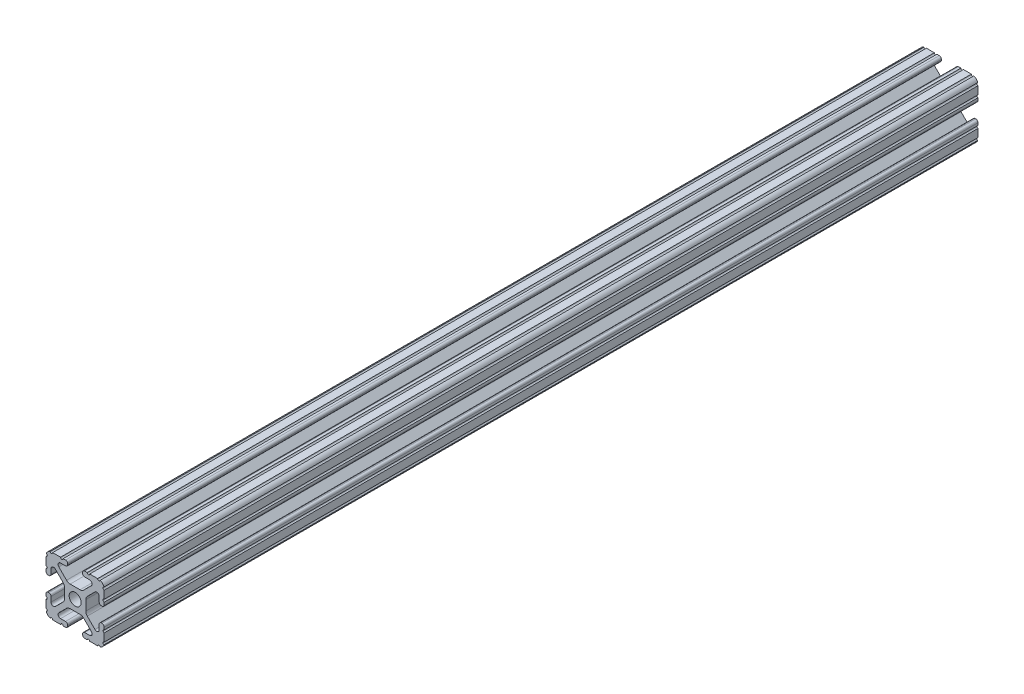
ISO-10303-21;
HEADER;
FILE_DESCRIPTION(('STEP AP214'),'2;1');
FILE_NAME('part.step','',(''),(''),'','','');
FILE_SCHEMA(('AUTOMOTIVE_DESIGN { 1 0 10303 214 1 1 1 1 }'));
ENDSEC;
DATA;
#1=APPLICATION_CONTEXT('core data for automotive mechanical design processes');
#2=APPLICATION_PROTOCOL_DEFINITION('international standard','automotive_design',2000,#1);
#3=PRODUCT_CONTEXT('',#1,'mechanical');
#4=PRODUCT('Part','Part','',(#3));
#5=PRODUCT_RELATED_PRODUCT_CATEGORY('part','',(#4));
#6=PRODUCT_DEFINITION_FORMATION('','',#4);
#7=PRODUCT_DEFINITION_CONTEXT('part definition',#1,'design');
#8=PRODUCT_DEFINITION('design','',#6,#7);
#9=PRODUCT_DEFINITION_SHAPE('','',#8);
#10=(LENGTH_UNIT() NAMED_UNIT(*) SI_UNIT(.MILLI.,.METRE.));
#11=(NAMED_UNIT(*) PLANE_ANGLE_UNIT() SI_UNIT($,.RADIAN.));
#12=(NAMED_UNIT(*) SI_UNIT($,.STERADIAN.) SOLID_ANGLE_UNIT());
#13=UNCERTAINTY_MEASURE_WITH_UNIT(LENGTH_MEASURE(1.E-05),#10,'distance_accuracy_value','');
#14=(GEOMETRIC_REPRESENTATION_CONTEXT(3) GLOBAL_UNCERTAINTY_ASSIGNED_CONTEXT((#13)) GLOBAL_UNIT_ASSIGNED_CONTEXT((#10,
#11,#12)) REPRESENTATION_CONTEXT('',''));
#15=CARTESIAN_POINT('',(0.,0.,0.));
#16=DIRECTION('',(0.,0.,1.));
#17=DIRECTION('',(1.,0.,0.));
#18=AXIS2_PLACEMENT_3D('',#15,#16,#17);
#19=CARTESIAN_POINT('',(4.190365,-12.7,190.5));
#20=DIRECTION('',(0.,1.,0.));
#21=DIRECTION('',(0.,0.,1.));
#22=AXIS2_PLACEMENT_3D('',#19,#20,#21);
#23=PLANE('',#22);
#24=DIRECTION('',(1.,0.,0.));
#25=VECTOR('',#24,1.);
#26=CARTESIAN_POINT('',(4.190365,-12.7,-190.5));
#27=LINE('',#26,#25);
#28=CARTESIAN_POINT('',(4.190365,-12.7,-190.5));
#29=VERTEX_POINT('',#28);
#30=CARTESIAN_POINT('',(5.24357801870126,-12.7,-190.5));
#31=VERTEX_POINT('',#30);
#32=EDGE_CURVE('E1224',#29,#31,#27,.T.);
#33=ORIENTED_EDGE('',*,*,#32,.T.);
#34=DIRECTION('',(0.,0.,1.));
#35=VECTOR('',#34,1.);
#36=CARTESIAN_POINT('',(5.24357801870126,-12.7,-190.5));
#37=LINE('',#36,#35);
#38=CARTESIAN_POINT('',(5.24357801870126,-12.7,190.5));
#39=VERTEX_POINT('',#38);
#40=EDGE_CURVE('E64',#31,#39,#37,.T.);
#41=ORIENTED_EDGE('',*,*,#40,.T.);
#42=DIRECTION('',(1.,0.,0.));
#43=VECTOR('',#42,1.);
#44=CARTESIAN_POINT('',(4.190365,-12.7,190.5));
#45=LINE('',#44,#43);
#46=CARTESIAN_POINT('',(4.190365,-12.7,190.5));
#47=VERTEX_POINT('',#46);
#48=EDGE_CURVE('E1178',#47,#39,#45,.T.);
#49=ORIENTED_EDGE('',*,*,#48,.F.);
#50=DIRECTION('',(0.,0.,-1.));
#51=VECTOR('',#50,1.);
#52=CARTESIAN_POINT('',(4.190365,-12.7,190.5));
#53=LINE('',#52,#51);
#54=EDGE_CURVE('E1309',#47,#29,#53,.T.);
#55=ORIENTED_EDGE('',*,*,#54,.T.);
#56=EDGE_LOOP('',(#33,#41,#49,#55));
#57=FACE_BOUND('',#56,.T.);
#58=ADVANCED_FACE('F41',(#57),#23,.F.);
#59=CARTESIAN_POINT('',(12.7,-4.190365,190.5));
#60=DIRECTION('',(-1.,0.,0.));
#61=DIRECTION('',(0.,-1.,0.));
#62=AXIS2_PLACEMENT_3D('',#59,#60,#61);
#63=PLANE('',#62);
#64=DIRECTION('',(0.,1.,0.));
#65=VECTOR('',#64,1.);
#66=CARTESIAN_POINT('',(12.7,-4.190365,-190.5));
#67=LINE('',#66,#65);
#68=CARTESIAN_POINT('',(12.7,-9.80370315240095,-190.5));
#69=VERTEX_POINT('',#68);
#70=CARTESIAN_POINT('',(12.7,-6.34847801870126,-190.5));
#71=VERTEX_POINT('',#70);
#72=EDGE_CURVE('E1232',#69,#71,#67,.T.);
#73=ORIENTED_EDGE('',*,*,#72,.T.);
#74=DIRECTION('',(0.,0.,1.));
#75=VECTOR('',#74,1.);
#76=CARTESIAN_POINT('',(12.7,-6.34847801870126,-190.5));
#77=LINE('',#76,#75);
#78=CARTESIAN_POINT('',(12.7,-6.34847801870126,190.5));
#79=VERTEX_POINT('',#78);
#80=EDGE_CURVE('E1169',#71,#79,#77,.T.);
#81=ORIENTED_EDGE('',*,*,#80,.T.);
#82=DIRECTION('',(0.,1.,0.));
#83=VECTOR('',#82,1.);
#84=CARTESIAN_POINT('',(12.7,-4.190365,190.5));
#85=LINE('',#84,#83);
#86=CARTESIAN_POINT('',(12.7,-9.80370315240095,190.5));
#87=VERTEX_POINT('',#86);
#88=EDGE_CURVE('E1186',#87,#79,#85,.T.);
#89=ORIENTED_EDGE('',*,*,#88,.F.);
#90=DIRECTION('',(0.,0.,1.));
#91=VECTOR('',#90,1.);
#92=CARTESIAN_POINT('',(12.7,-9.80370315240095,-190.5));
#93=LINE('',#92,#91);
#94=EDGE_CURVE('E1160',#87,#69,#93,.F.);
#95=ORIENTED_EDGE('',*,*,#94,.T.);
#96=EDGE_LOOP('',(#73,#81,#89,#95));
#97=FACE_BOUND('',#96,.T.);
#98=ADVANCED_FACE('F1759',(#97),#63,.F.);
#99=CARTESIAN_POINT('',(4.190365,-11.760835,190.5));
#100=DIRECTION('',(0.,0.,-1.));
#101=DIRECTION('',(-1.,0.,0.));
#102=AXIS2_PLACEMENT_3D('',#99,#100,#101);
#103=CYLINDRICAL_SURFACE('',#102,0.939164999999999);
#104=CARTESIAN_POINT('',(4.190365,-11.760835,-190.5));
#105=DIRECTION('',(0.,0.,1.));
#106=DIRECTION('',(1.,0.,0.));
#107=AXIS2_PLACEMENT_3D('',#104,#105,#106);
#108=CIRCLE('',#107,0.939164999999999);
#109=CARTESIAN_POINT('',(3.2512,-11.760835,-190.5));
#110=VERTEX_POINT('',#109);
#111=EDGE_CURVE('E1172',#110,#29,#108,.T.);
#112=ORIENTED_EDGE('',*,*,#111,.T.);
#113=ORIENTED_EDGE('',*,*,#54,.F.);
#114=CARTESIAN_POINT('',(4.190365,-11.760835,190.5));
#115=DIRECTION('',(0.,0.,1.));
#116=DIRECTION('',(1.,0.,0.));
#117=AXIS2_PLACEMENT_3D('',#114,#115,#116);
#118=CIRCLE('',#117,0.939164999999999);
#119=CARTESIAN_POINT('',(3.2512,-11.760835,190.5));
#120=VERTEX_POINT('',#119);
#121=EDGE_CURVE('E1173',#120,#47,#118,.T.);
#122=ORIENTED_EDGE('',*,*,#121,.F.);
#123=DIRECTION('',(0.,0.,-1.));
#124=VECTOR('',#123,1.);
#125=CARTESIAN_POINT('',(3.2512,-11.760835,190.5));
#126=LINE('',#125,#124);
#127=EDGE_CURVE('E1220',#120,#110,#126,.T.);
#128=ORIENTED_EDGE('',*,*,#127,.T.);
#129=EDGE_LOOP('',(#112,#113,#122,#128));
#130=FACE_BOUND('',#129,.T.);
#131=ADVANCED_FACE('F43',(#130),#103,.T.);
#132=CARTESIAN_POINT('',(6.34847801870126,-12.7,190.5));
#133=VERTEX_POINT('',#132);
#134=CARTESIAN_POINT('',(9.80370315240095,-12.7,190.5));
#135=VERTEX_POINT('',#134);
#136=EDGE_CURVE('E1176',#133,#135,#45,.T.);
#137=ORIENTED_EDGE('',*,*,#136,.F.);
#138=DIRECTION('',(0.,0.,1.));
#139=VECTOR('',#138,1.);
#140=CARTESIAN_POINT('',(6.34847801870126,-12.7,-190.5));
#141=LINE('',#140,#139);
#142=CARTESIAN_POINT('',(6.34847801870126,-12.7,-190.5));
#143=VERTEX_POINT('',#142);
#144=EDGE_CURVE('E1156',#133,#143,#141,.F.);
#145=ORIENTED_EDGE('',*,*,#144,.T.);
#146=CARTESIAN_POINT('',(9.80370315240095,-12.7,-190.5));
#147=VERTEX_POINT('',#146);
#148=EDGE_CURVE('E1223',#143,#147,#27,.T.);
#149=ORIENTED_EDGE('',*,*,#148,.T.);
#150=DIRECTION('',(0.,0.,1.));
#151=VECTOR('',#150,1.);
#152=CARTESIAN_POINT('',(9.80370315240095,-12.7,-190.5));
#153=LINE('',#152,#151);
#154=EDGE_CURVE('E56',#147,#135,#153,.T.);
#155=ORIENTED_EDGE('',*,*,#154,.T.);
#156=EDGE_LOOP('',(#137,#145,#149,#155));
#157=FACE_BOUND('',#156,.T.);
#158=ADVANCED_FACE('F1329',(#157),#23,.F.);
#159=CARTESIAN_POINT('',(10.11729625,-10.11729625,190.5));
#160=DIRECTION('',(0.,0.,-1.));
#161=DIRECTION('',(-1.,0.,0.));
#162=AXIS2_PLACEMENT_3D('',#159,#160,#161);
#163=CYLINDRICAL_SURFACE('',#162,2.58270375);
#164=CARTESIAN_POINT('',(10.11729625,-10.11729625,-190.5));
#165=DIRECTION('',(0.,0.,1.));
#166=DIRECTION('',(1.,0.,0.));
#167=AXIS2_PLACEMENT_3D('',#164,#165,#166);
#168=CIRCLE('',#167,2.58270375);
#169=CARTESIAN_POINT('',(10.895412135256,-12.5799968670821,-190.5));
#170=VERTEX_POINT('',#169);
#171=CARTESIAN_POINT('',(12.579996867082,-10.895412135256,-190.5));
#172=VERTEX_POINT('',#171);
#173=EDGE_CURVE('E1227',#170,#172,#168,.T.);
#174=ORIENTED_EDGE('',*,*,#173,.T.);
#175=DIRECTION('',(0.,0.,1.));
#176=VECTOR('',#175,1.);
#177=CARTESIAN_POINT('',(12.579996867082,-10.895412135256,0.));
#178=LINE('',#177,#176);
#179=CARTESIAN_POINT('',(12.579996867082,-10.895412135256,190.5));
#180=VERTEX_POINT('',#179);
#181=EDGE_CURVE('E1163',#172,#180,#178,.T.);
#182=ORIENTED_EDGE('',*,*,#181,.T.);
#183=CARTESIAN_POINT('',(10.11729625,-10.11729625,190.5));
#184=DIRECTION('',(0.,0.,1.));
#185=DIRECTION('',(1.,0.,0.));
#186=AXIS2_PLACEMENT_3D('',#183,#184,#185);
#187=CIRCLE('',#186,2.58270375);
#188=CARTESIAN_POINT('',(10.895412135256,-12.5799968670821,190.5));
#189=VERTEX_POINT('',#188);
#190=EDGE_CURVE('E1181',#189,#180,#187,.T.);
#191=ORIENTED_EDGE('',*,*,#190,.F.);
#192=DIRECTION('',(0.,0.,1.));
#193=VECTOR('',#192,1.);
#194=CARTESIAN_POINT('',(10.895412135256,-12.5799968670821,0.));
#195=LINE('',#194,#193);
#196=EDGE_CURVE('E1152',#189,#170,#195,.F.);
#197=ORIENTED_EDGE('',*,*,#196,.T.);
#198=EDGE_LOOP('',(#174,#182,#191,#197));
#199=FACE_BOUND('',#198,.T.);
#200=ADVANCED_FACE('F1317',(#199),#163,.T.);
#201=CARTESIAN_POINT('',(12.7,-5.24357801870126,190.5));
#202=VERTEX_POINT('',#201);
#203=CARTESIAN_POINT('',(12.7,-4.190365,190.5));
#204=VERTEX_POINT('',#203);
#205=EDGE_CURVE('E1184',#202,#204,#85,.T.);
#206=ORIENTED_EDGE('',*,*,#205,.F.);
#207=DIRECTION('',(0.,0.,1.));
#208=VECTOR('',#207,1.);
#209=CARTESIAN_POINT('',(12.7,-5.24357801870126,-190.5));
#210=LINE('',#209,#208);
#211=CARTESIAN_POINT('',(12.7,-5.24357801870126,-190.5));
#212=VERTEX_POINT('',#211);
#213=EDGE_CURVE('E1166',#202,#212,#210,.F.);
#214=ORIENTED_EDGE('',*,*,#213,.T.);
#215=CARTESIAN_POINT('',(12.7,-4.190365,-190.5));
#216=VERTEX_POINT('',#215);
#217=EDGE_CURVE('E1230',#212,#216,#67,.T.);
#218=ORIENTED_EDGE('',*,*,#217,.T.);
#219=DIRECTION('',(0.,0.,-1.));
#220=VECTOR('',#219,1.);
#221=CARTESIAN_POINT('',(12.7,-4.190365,190.5));
#222=LINE('',#221,#220);
#223=EDGE_CURVE('E1306',#204,#216,#222,.T.);
#224=ORIENTED_EDGE('',*,*,#223,.F.);
#225=EDGE_LOOP('',(#206,#214,#218,#224));
#226=FACE_BOUND('',#225,.T.);
#227=ADVANCED_FACE('F1753',(#226),#63,.F.);
#228=CARTESIAN_POINT('',(11.760835,-4.190365,190.5));
#229=DIRECTION('',(0.,0.,-1.));
#230=DIRECTION('',(-1.,0.,0.));
#231=AXIS2_PLACEMENT_3D('',#228,#229,#230);
#232=CYLINDRICAL_SURFACE('',#231,0.939164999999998);
#233=CARTESIAN_POINT('',(11.760835,-4.190365,-190.5));
#234=DIRECTION('',(0.,0.,1.));
#235=DIRECTION('',(-1.,0.,0.));
#236=AXIS2_PLACEMENT_3D('',#233,#234,#235);
#237=CIRCLE('',#236,0.939164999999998);
#238=CARTESIAN_POINT('',(11.760835,-3.2512,-190.5));
#239=VERTEX_POINT('',#238);
#240=EDGE_CURVE('E1233',#216,#239,#237,.T.);
#241=ORIENTED_EDGE('',*,*,#240,.T.);
#242=DIRECTION('',(0.,0.,-1.));
#243=VECTOR('',#242,1.);
#244=CARTESIAN_POINT('',(11.760835,-3.2512,190.5));
#245=LINE('',#244,#243);
#246=CARTESIAN_POINT('',(11.760835,-3.2512,190.5));
#247=VERTEX_POINT('',#246);
#248=EDGE_CURVE('E1303',#247,#239,#245,.T.);
#249=ORIENTED_EDGE('',*,*,#248,.F.);
#250=CARTESIAN_POINT('',(11.760835,-4.190365,190.5));
#251=DIRECTION('',(0.,0.,1.));
#252=DIRECTION('',(-1.,0.,0.));
#253=AXIS2_PLACEMENT_3D('',#250,#251,#252);
#254=CIRCLE('',#253,0.939164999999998);
#255=EDGE_CURVE('E1187',#204,#247,#254,.T.);
#256=ORIENTED_EDGE('',*,*,#255,.F.);
#257=ORIENTED_EDGE('',*,*,#223,.T.);
#258=EDGE_LOOP('',(#241,#249,#256,#257));
#259=FACE_BOUND('',#258,.T.);
#260=ADVANCED_FACE('F1748',(#259),#232,.T.);
#261=CARTESIAN_POINT('',(11.429365,-3.2512,190.5));
#262=DIRECTION('',(0.,-1.,0.));
#263=DIRECTION('',(0.,0.,-1.));
#264=AXIS2_PLACEMENT_3D('',#261,#262,#263);
#265=PLANE('',#264);
#266=DIRECTION('',(-1.,0.,0.));
#267=VECTOR('',#266,1.);
#268=CARTESIAN_POINT('',(11.429365,-3.2512,-190.5));
#269=LINE('',#268,#267);
#270=CARTESIAN_POINT('',(11.429365,-3.2512,-190.5));
#271=VERTEX_POINT('',#270);
#272=EDGE_CURVE('E1235',#239,#271,#269,.T.);
#273=ORIENTED_EDGE('',*,*,#272,.T.);
#274=DIRECTION('',(0.,0.,-1.));
#275=VECTOR('',#274,1.);
#276=CARTESIAN_POINT('',(11.429365,-3.2512,190.5));
#277=LINE('',#276,#275);
#278=CARTESIAN_POINT('',(11.429365,-3.2512,190.5));
#279=VERTEX_POINT('',#278);
#280=EDGE_CURVE('E1300',#279,#271,#277,.T.);
#281=ORIENTED_EDGE('',*,*,#280,.F.);
#282=DIRECTION('',(-1.,0.,0.));
#283=VECTOR('',#282,1.);
#284=CARTESIAN_POINT('',(11.429365,-3.2512,190.5));
#285=LINE('',#284,#283);
#286=EDGE_CURVE('E1189',#247,#279,#285,.T.);
#287=ORIENTED_EDGE('',*,*,#286,.F.);
#288=ORIENTED_EDGE('',*,*,#248,.T.);
#289=EDGE_LOOP('',(#273,#281,#287,#288));
#290=FACE_BOUND('',#289,.T.);
#291=ADVANCED_FACE('F1744',(#290),#265,.F.);
#292=CARTESIAN_POINT('',(11.429365,-4.190365,190.5));
#293=DIRECTION('',(0.,0.,-1.));
#294=DIRECTION('',(-1.,0.,0.));
#295=AXIS2_PLACEMENT_3D('',#292,#293,#294);
#296=CYLINDRICAL_SURFACE('',#295,0.939164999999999);
#297=CARTESIAN_POINT('',(11.429365,-4.190365,-190.5));
#298=DIRECTION('',(0.,0.,1.));
#299=DIRECTION('',(-1.,0.,0.));
#300=AXIS2_PLACEMENT_3D('',#297,#298,#299);
#301=CIRCLE('',#300,0.939164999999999);
#302=CARTESIAN_POINT('',(10.4902,-4.190365,-190.5));
#303=VERTEX_POINT('',#302);
#304=EDGE_CURVE('E1237',#271,#303,#301,.T.);
#305=ORIENTED_EDGE('',*,*,#304,.T.);
#306=DIRECTION('',(0.,0.,-1.));
#307=VECTOR('',#306,1.);
#308=CARTESIAN_POINT('',(10.4902,-4.190365,190.5));
#309=LINE('',#308,#307);
#310=CARTESIAN_POINT('',(10.4902,-4.190365,190.5));
#311=VERTEX_POINT('',#310);
#312=EDGE_CURVE('E1297',#311,#303,#309,.T.);
#313=ORIENTED_EDGE('',*,*,#312,.F.);
#314=CARTESIAN_POINT('',(11.429365,-4.190365,190.5));
#315=DIRECTION('',(0.,0.,1.));
#316=DIRECTION('',(-1.,0.,0.));
#317=AXIS2_PLACEMENT_3D('',#314,#315,#316);
#318=CIRCLE('',#317,0.939164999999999);
#319=EDGE_CURVE('E1191',#279,#311,#318,.T.);
#320=ORIENTED_EDGE('',*,*,#319,.F.);
#321=ORIENTED_EDGE('',*,*,#280,.T.);
#322=EDGE_LOOP('',(#305,#313,#320,#321));
#323=FACE_BOUND('',#322,.T.);
#324=ADVANCED_FACE('F1740',(#323),#296,.T.);
#325=CARTESIAN_POINT('',(10.4902,-6.34847801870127,190.5));
#326=DIRECTION('',(1.,0.,0.));
#327=DIRECTION('',(0.,1.,0.));
#328=AXIS2_PLACEMENT_3D('',#325,#326,#327);
#329=PLANE('',#328);
#330=DIRECTION('',(0.,-1.,0.));
#331=VECTOR('',#330,1.);
#332=CARTESIAN_POINT('',(10.4902,-6.34847801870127,-190.5));
#333=LINE('',#332,#331);
#334=CARTESIAN_POINT('',(10.4902,-6.34847801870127,-190.5));
#335=VERTEX_POINT('',#334);
#336=EDGE_CURVE('E1239',#303,#335,#333,.T.);
#337=ORIENTED_EDGE('',*,*,#336,.T.);
#338=DIRECTION('',(0.,0.,-1.));
#339=VECTOR('',#338,1.);
#340=CARTESIAN_POINT('',(10.4902,-6.34847801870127,190.5));
#341=LINE('',#340,#339);
#342=CARTESIAN_POINT('',(10.4902,-6.34847801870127,190.5));
#343=VERTEX_POINT('',#342);
#344=EDGE_CURVE('E1294',#343,#335,#341,.T.);
#345=ORIENTED_EDGE('',*,*,#344,.F.);
#346=DIRECTION('',(0.,-1.,0.));
#347=VECTOR('',#346,1.);
#348=CARTESIAN_POINT('',(10.4902,-6.34847801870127,190.5));
#349=LINE('',#348,#347);
#350=EDGE_CURVE('E1193',#311,#343,#349,.T.);
#351=ORIENTED_EDGE('',*,*,#350,.F.);
#352=ORIENTED_EDGE('',*,*,#312,.T.);
#353=EDGE_LOOP('',(#337,#345,#351,#352));
#354=FACE_BOUND('',#353,.T.);
#355=ADVANCED_FACE('F1735',(#354),#329,.F.);
#356=CARTESIAN_POINT('',(9.42187801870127,-6.34847801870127,190.5));
#357=DIRECTION('',(0.,0.,-1.));
#358=DIRECTION('',(-1.,0.,0.));
#359=AXIS2_PLACEMENT_3D('',#356,#357,#358);
#360=CYLINDRICAL_SURFACE('',#359,1.06832198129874);
#361=CARTESIAN_POINT('',(9.42187801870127,-6.34847801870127,-190.5));
#362=DIRECTION('',(0.,0.,-1.));
#363=DIRECTION('',(1.,0.,0.));
#364=AXIS2_PLACEMENT_3D('',#361,#362,#363);
#365=CIRCLE('',#364,1.06832198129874);
#366=CARTESIAN_POINT('',(8.66646030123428,-7.10389573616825,-190.5));
#367=VERTEX_POINT('',#366);
#368=EDGE_CURVE('E1241',#335,#367,#365,.T.);
#369=ORIENTED_EDGE('',*,*,#368,.T.);
#370=DIRECTION('',(0.,0.,-1.));
#371=VECTOR('',#370,1.);
#372=CARTESIAN_POINT('',(8.66646030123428,-7.10389573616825,190.5));
#373=LINE('',#372,#371);
#374=CARTESIAN_POINT('',(8.66646030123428,-7.10389573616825,190.5));
#375=VERTEX_POINT('',#374);
#376=EDGE_CURVE('E1291',#375,#367,#373,.T.);
#377=ORIENTED_EDGE('',*,*,#376,.F.);
#378=CARTESIAN_POINT('',(9.42187801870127,-6.34847801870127,190.5));
#379=DIRECTION('',(0.,0.,-1.));
#380=DIRECTION('',(1.,0.,0.));
#381=AXIS2_PLACEMENT_3D('',#378,#379,#380);
#382=CIRCLE('',#381,1.06832198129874);
#383=EDGE_CURVE('E1195',#343,#375,#382,.T.);
#384=ORIENTED_EDGE('',*,*,#383,.F.);
#385=ORIENTED_EDGE('',*,*,#344,.T.);
#386=EDGE_LOOP('',(#369,#377,#384,#385));
#387=FACE_BOUND('',#386,.T.);
#388=ADVANCED_FACE('F1729',(#387),#360,.F.);
#389=CARTESIAN_POINT('',(8.66646030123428,-7.10389573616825,190.5));
#390=DIRECTION('',(-0.707106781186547,-0.707106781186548,0.));
#391=DIRECTION('',(0.707106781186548,-0.707106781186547,0.));
#392=AXIS2_PLACEMENT_3D('',#389,#390,#391);
#393=PLANE('',#392);
#394=DIRECTION('',(-0.707106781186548,0.707106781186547,0.));
#395=VECTOR('',#394,1.);
#396=CARTESIAN_POINT('',(8.66646030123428,-7.10389573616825,-190.5));
#397=LINE('',#396,#395);
#398=CARTESIAN_POINT('',(5.29989912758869,-3.73733456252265,-190.5));
#399=VERTEX_POINT('',#398);
#400=EDGE_CURVE('E1243',#367,#399,#397,.T.);
#401=ORIENTED_EDGE('',*,*,#400,.T.);
#402=DIRECTION('',(0.,0.,-1.));
#403=VECTOR('',#402,1.);
#404=CARTESIAN_POINT('',(5.29989912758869,-3.73733456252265,190.5));
#405=LINE('',#404,#403);
#406=CARTESIAN_POINT('',(5.29989912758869,-3.73733456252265,190.5));
#407=VERTEX_POINT('',#406);
#408=EDGE_CURVE('E1288',#407,#399,#405,.T.);
#409=ORIENTED_EDGE('',*,*,#408,.F.);
#410=DIRECTION('',(-0.707106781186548,0.707106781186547,0.));
#411=VECTOR('',#410,1.);
#412=CARTESIAN_POINT('',(8.66646030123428,-7.10389573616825,190.5));
#413=LINE('',#412,#411);
#414=EDGE_CURVE('E1197',#375,#407,#413,.T.);
#415=ORIENTED_EDGE('',*,*,#414,.F.);
#416=ORIENTED_EDGE('',*,*,#376,.T.);
#417=EDGE_LOOP('',(#401,#409,#415,#416));
#418=FACE_BOUND('',#417,.T.);
#419=ADVANCED_FACE('F1725',(#418),#393,.F.);
#420=CARTESIAN_POINT('',(6.87324,-2.16399369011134,190.5));
#421=DIRECTION('',(0.,0.,-1.));
#422=DIRECTION('',(-1.,0.,0.));
#423=AXIS2_PLACEMENT_3D('',#420,#421,#422);
#424=CYLINDRICAL_SURFACE('',#423,2.22504);
#425=CARTESIAN_POINT('',(6.87324,-2.16399369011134,-190.5));
#426=DIRECTION('',(0.,0.,-1.));
#427=DIRECTION('',(-1.,0.,0.));
#428=AXIS2_PLACEMENT_3D('',#425,#426,#427);
#429=CIRCLE('',#428,2.22504);
#430=CARTESIAN_POINT('',(4.6482,-2.16399369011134,-190.5));
#431=VERTEX_POINT('',#430);
#432=EDGE_CURVE('E1245',#399,#431,#429,.T.);
#433=ORIENTED_EDGE('',*,*,#432,.T.);
#434=DIRECTION('',(0.,0.,-1.));
#435=VECTOR('',#434,1.);
#436=CARTESIAN_POINT('',(4.6482,-2.16399369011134,190.5));
#437=LINE('',#436,#435);
#438=CARTESIAN_POINT('',(4.6482,-2.16399369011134,190.5));
#439=VERTEX_POINT('',#438);
#440=EDGE_CURVE('E1285',#439,#431,#437,.T.);
#441=ORIENTED_EDGE('',*,*,#440,.F.);
#442=CARTESIAN_POINT('',(6.87324,-2.16399369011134,190.5));
#443=DIRECTION('',(0.,0.,-1.));
#444=DIRECTION('',(-1.,0.,0.));
#445=AXIS2_PLACEMENT_3D('',#442,#443,#444);
#446=CIRCLE('',#445,2.22504);
#447=EDGE_CURVE('E1199',#407,#439,#446,.T.);
#448=ORIENTED_EDGE('',*,*,#447,.F.);
#449=ORIENTED_EDGE('',*,*,#408,.T.);
#450=EDGE_LOOP('',(#433,#441,#448,#449));
#451=FACE_BOUND('',#450,.T.);
#452=ADVANCED_FACE('F1720',(#451),#424,.F.);
#453=CARTESIAN_POINT('',(4.6482,0.,190.5));
#454=DIRECTION('',(-1.,0.,0.));
#455=DIRECTION('',(0.,-1.,0.));
#456=AXIS2_PLACEMENT_3D('',#453,#454,#455);
#457=PLANE('',#456);
#458=DIRECTION('',(0.,1.,0.));
#459=VECTOR('',#458,1.);
#460=CARTESIAN_POINT('',(4.6482,0.,-190.5));
#461=LINE('',#460,#459);
#462=CARTESIAN_POINT('',(4.6482,2.16399369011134,-190.5));
#463=VERTEX_POINT('',#462);
#464=EDGE_CURVE('E1247',#431,#463,#461,.T.);
#465=ORIENTED_EDGE('',*,*,#464,.T.);
#466=DIRECTION('',(0.,0.,-1.));
#467=VECTOR('',#466,1.);
#468=CARTESIAN_POINT('',(4.6482,2.16399369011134,190.5));
#469=LINE('',#468,#467);
#470=CARTESIAN_POINT('',(4.6482,2.16399369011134,190.5));
#471=VERTEX_POINT('',#470);
#472=EDGE_CURVE('E915',#471,#463,#469,.T.);
#473=ORIENTED_EDGE('',*,*,#472,.F.);
#474=DIRECTION('',(0.,1.,0.));
#475=VECTOR('',#474,1.);
#476=CARTESIAN_POINT('',(4.6482,0.,190.5));
#477=LINE('',#476,#475);
#478=EDGE_CURVE('E1201',#439,#471,#477,.T.);
#479=ORIENTED_EDGE('',*,*,#478,.F.);
#480=ORIENTED_EDGE('',*,*,#440,.T.);
#481=EDGE_LOOP('',(#465,#473,#479,#480));
#482=FACE_BOUND('',#481,.T.);
#483=ADVANCED_FACE('F1714',(#482),#457,.F.);
#484=CARTESIAN_POINT('',(0.,0.,190.5));
#485=DIRECTION('',(0.,0.,-1.));
#486=DIRECTION('',(-1.,0.,0.));
#487=AXIS2_PLACEMENT_3D('',#484,#485,#486);
#488=CYLINDRICAL_SURFACE('',#487,2.60350000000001);
#489=CARTESIAN_POINT('',(0.,0.,-190.5));
#490=DIRECTION('',(0.,0.,-1.));
#491=DIRECTION('',(1.,0.,0.));
#492=AXIS2_PLACEMENT_3D('',#489,#490,#491);
#493=CIRCLE('',#492,2.60350000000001);
#494=CARTESIAN_POINT('',(2.6035,0.,-190.5));
#495=VERTEX_POINT('',#494);
#496=EDGE_CURVE('E1249',#495,#495,#493,.T.);
#497=ORIENTED_EDGE('',*,*,#496,.T.);
#498=EDGE_LOOP('',(#497));
#499=FACE_BOUND('',#498,.T.);
#500=CARTESIAN_POINT('',(0.,0.,190.5));
#501=DIRECTION('',(0.,0.,-1.));
#502=DIRECTION('',(1.,0.,0.));
#503=AXIS2_PLACEMENT_3D('',#500,#501,#502);
#504=CIRCLE('',#503,2.60350000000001);
#505=CARTESIAN_POINT('',(2.6035,0.,190.5));
#506=VERTEX_POINT('',#505);
#507=EDGE_CURVE('E1203',#506,#506,#504,.T.);
#508=ORIENTED_EDGE('',*,*,#507,.F.);
#509=EDGE_LOOP('',(#508));
#510=FACE_BOUND('',#509,.T.);
#511=ADVANCED_FACE('F1850',(#499,#510),#488,.F.);
#512=CARTESIAN_POINT('',(0.,-4.6482,190.5));
#513=DIRECTION('',(0.,1.,0.));
#514=DIRECTION('',(0.,0.,1.));
#515=AXIS2_PLACEMENT_3D('',#512,#513,#514);
#516=PLANE('',#515);
#517=DIRECTION('',(1.,0.,0.));
#518=VECTOR('',#517,1.);
#519=CARTESIAN_POINT('',(0.,-4.6482,-190.5));
#520=LINE('',#519,#518);
#521=CARTESIAN_POINT('',(-2.16399369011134,-4.6482,-190.5));
#522=VERTEX_POINT('',#521);
#523=CARTESIAN_POINT('',(2.16399369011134,-4.6482,-190.5));
#524=VERTEX_POINT('',#523);
#525=EDGE_CURVE('E1252',#522,#524,#520,.T.);
#526=ORIENTED_EDGE('',*,*,#525,.T.);
#527=DIRECTION('',(0.,0.,-1.));
#528=VECTOR('',#527,1.);
#529=CARTESIAN_POINT('',(2.16399369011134,-4.6482,190.5));
#530=LINE('',#529,#528);
#531=CARTESIAN_POINT('',(2.16399369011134,-4.6482,190.5));
#532=VERTEX_POINT('',#531);
#533=EDGE_CURVE('E1282',#532,#524,#530,.T.);
#534=ORIENTED_EDGE('',*,*,#533,.F.);
#535=DIRECTION('',(1.,0.,0.));
#536=VECTOR('',#535,1.);
#537=CARTESIAN_POINT('',(0.,-4.6482,190.5));
#538=LINE('',#537,#536);
#539=CARTESIAN_POINT('',(-2.16399369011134,-4.6482,190.5));
#540=VERTEX_POINT('',#539);
#541=EDGE_CURVE('E1206',#540,#532,#538,.T.);
#542=ORIENTED_EDGE('',*,*,#541,.F.);
#543=DIRECTION('',(0.,0.,-1.));
#544=VECTOR('',#543,1.);
#545=CARTESIAN_POINT('',(-2.16399369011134,-4.6482,190.5));
#546=LINE('',#545,#544);
#547=EDGE_CURVE('E1106',#540,#522,#546,.T.);
#548=ORIENTED_EDGE('',*,*,#547,.T.);
#549=EDGE_LOOP('',(#526,#534,#542,#548));
#550=FACE_BOUND('',#549,.T.);
#551=ADVANCED_FACE('F1374',(#550),#516,.F.);
#552=CARTESIAN_POINT('',(2.16399369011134,-6.87324,190.5));
#553=DIRECTION('',(0.,0.,-1.));
#554=DIRECTION('',(-1.,0.,0.));
#555=AXIS2_PLACEMENT_3D('',#552,#553,#554);
#556=CYLINDRICAL_SURFACE('',#555,2.22504);
#557=CARTESIAN_POINT('',(2.16399369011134,-6.87324,-190.5));
#558=DIRECTION('',(0.,0.,-1.));
#559=DIRECTION('',(-1.,0.,0.));
#560=AXIS2_PLACEMENT_3D('',#557,#558,#559);
#561=CIRCLE('',#560,2.22504);
#562=CARTESIAN_POINT('',(3.73733456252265,-5.29989912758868,-190.5));
#563=VERTEX_POINT('',#562);
#564=EDGE_CURVE('E1254',#524,#563,#561,.T.);
#565=ORIENTED_EDGE('',*,*,#564,.T.);
#566=DIRECTION('',(0.,0.,-1.));
#567=VECTOR('',#566,1.);
#568=CARTESIAN_POINT('',(3.73733456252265,-5.29989912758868,190.5));
#569=LINE('',#568,#567);
#570=CARTESIAN_POINT('',(3.73733456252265,-5.29989912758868,190.5));
#571=VERTEX_POINT('',#570);
#572=EDGE_CURVE('E1279',#571,#563,#569,.T.);
#573=ORIENTED_EDGE('',*,*,#572,.F.);
#574=CARTESIAN_POINT('',(2.16399369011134,-6.87324,190.5));
#575=DIRECTION('',(0.,0.,-1.));
#576=DIRECTION('',(-1.,0.,0.));
#577=AXIS2_PLACEMENT_3D('',#574,#575,#576);
#578=CIRCLE('',#577,2.22504);
#579=EDGE_CURVE('E1208',#532,#571,#578,.T.);
#580=ORIENTED_EDGE('',*,*,#579,.F.);
#581=ORIENTED_EDGE('',*,*,#533,.T.);
#582=EDGE_LOOP('',(#565,#573,#580,#581));
#583=FACE_BOUND('',#582,.T.);
#584=ADVANCED_FACE('F1366',(#583),#556,.F.);
#585=CARTESIAN_POINT('',(3.73733456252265,-5.29989912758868,190.5));
#586=DIRECTION('',(0.707106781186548,0.707106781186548,0.));
#587=DIRECTION('',(-0.707106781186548,0.707106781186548,0.));
#588=AXIS2_PLACEMENT_3D('',#585,#586,#587);
#589=PLANE('',#588);
#590=DIRECTION('',(0.707106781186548,-0.707106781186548,0.));
#591=VECTOR('',#590,1.);
#592=CARTESIAN_POINT('',(3.73733456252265,-5.29989912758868,-190.5));
#593=LINE('',#592,#591);
#594=CARTESIAN_POINT('',(7.10389573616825,-8.66646030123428,-190.5));
#595=VERTEX_POINT('',#594);
#596=EDGE_CURVE('E1256',#563,#595,#593,.T.);
#597=ORIENTED_EDGE('',*,*,#596,.T.);
#598=DIRECTION('',(0.,0.,-1.));
#599=VECTOR('',#598,1.);
#600=CARTESIAN_POINT('',(7.10389573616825,-8.66646030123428,190.5));
#601=LINE('',#600,#599);
#602=CARTESIAN_POINT('',(7.10389573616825,-8.66646030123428,190.5));
#603=VERTEX_POINT('',#602);
#604=EDGE_CURVE('E1276',#603,#595,#601,.T.);
#605=ORIENTED_EDGE('',*,*,#604,.F.);
#606=DIRECTION('',(0.707106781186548,-0.707106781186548,0.));
#607=VECTOR('',#606,1.);
#608=CARTESIAN_POINT('',(3.73733456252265,-5.29989912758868,190.5));
#609=LINE('',#608,#607);
#610=EDGE_CURVE('E1210',#571,#603,#609,.T.);
#611=ORIENTED_EDGE('',*,*,#610,.F.);
#612=ORIENTED_EDGE('',*,*,#572,.T.);
#613=EDGE_LOOP('',(#597,#605,#611,#612));
#614=FACE_BOUND('',#613,.T.);
#615=ADVANCED_FACE('F1362',(#614),#589,.F.);
#616=CARTESIAN_POINT('',(6.34847801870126,-9.42187801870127,190.5));
#617=DIRECTION('',(0.,0.,-1.));
#618=DIRECTION('',(-1.,0.,0.));
#619=AXIS2_PLACEMENT_3D('',#616,#617,#618);
#620=CYLINDRICAL_SURFACE('',#619,1.06832198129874);
#621=CARTESIAN_POINT('',(6.34847801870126,-9.42187801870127,-190.5));
#622=DIRECTION('',(0.,0.,-1.));
#623=DIRECTION('',(1.,0.,0.));
#624=AXIS2_PLACEMENT_3D('',#621,#622,#623);
#625=CIRCLE('',#624,1.06832198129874);
#626=CARTESIAN_POINT('',(6.34847801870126,-10.4902,-190.5));
#627=VERTEX_POINT('',#626);
#628=EDGE_CURVE('E1258',#595,#627,#625,.T.);
#629=ORIENTED_EDGE('',*,*,#628,.T.);
#630=DIRECTION('',(0.,0.,-1.));
#631=VECTOR('',#630,1.);
#632=CARTESIAN_POINT('',(6.34847801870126,-10.4902,190.5));
#633=LINE('',#632,#631);
#634=CARTESIAN_POINT('',(6.34847801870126,-10.4902,190.5));
#635=VERTEX_POINT('',#634);
#636=EDGE_CURVE('E1273',#635,#627,#633,.T.);
#637=ORIENTED_EDGE('',*,*,#636,.F.);
#638=CARTESIAN_POINT('',(6.34847801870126,-9.42187801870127,190.5));
#639=DIRECTION('',(0.,0.,-1.));
#640=DIRECTION('',(1.,0.,0.));
#641=AXIS2_PLACEMENT_3D('',#638,#639,#640);
#642=CIRCLE('',#641,1.06832198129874);
#643=EDGE_CURVE('E1212',#603,#635,#642,.T.);
#644=ORIENTED_EDGE('',*,*,#643,.F.);
#645=ORIENTED_EDGE('',*,*,#604,.T.);
#646=EDGE_LOOP('',(#629,#637,#644,#645));
#647=FACE_BOUND('',#646,.T.);
#648=ADVANCED_FACE('F1357',(#647),#620,.F.);
#649=CARTESIAN_POINT('',(4.190365,-10.4902,190.5));
#650=DIRECTION('',(0.,-1.,0.));
#651=DIRECTION('',(1.,0.,0.));
#652=AXIS2_PLACEMENT_3D('',#649,#650,#651);
#653=PLANE('',#652);
#654=DIRECTION('',(-1.,0.,0.));
#655=VECTOR('',#654,1.);
#656=CARTESIAN_POINT('',(4.190365,-10.4902,-190.5));
#657=LINE('',#656,#655);
#658=CARTESIAN_POINT('',(4.190365,-10.4902,-190.5));
#659=VERTEX_POINT('',#658);
#660=EDGE_CURVE('E1260',#627,#659,#657,.T.);
#661=ORIENTED_EDGE('',*,*,#660,.T.);
#662=DIRECTION('',(0.,0.,-1.));
#663=VECTOR('',#662,1.);
#664=CARTESIAN_POINT('',(4.190365,-10.4902,190.5));
#665=LINE('',#664,#663);
#666=CARTESIAN_POINT('',(4.190365,-10.4902,190.5));
#667=VERTEX_POINT('',#666);
#668=EDGE_CURVE('E1270',#667,#659,#665,.T.);
#669=ORIENTED_EDGE('',*,*,#668,.F.);
#670=DIRECTION('',(-1.,0.,0.));
#671=VECTOR('',#670,1.);
#672=CARTESIAN_POINT('',(4.190365,-10.4902,190.5));
#673=LINE('',#672,#671);
#674=EDGE_CURVE('E1214',#635,#667,#673,.T.);
#675=ORIENTED_EDGE('',*,*,#674,.F.);
#676=ORIENTED_EDGE('',*,*,#636,.T.);
#677=EDGE_LOOP('',(#661,#669,#675,#676));
#678=FACE_BOUND('',#677,.T.);
#679=ADVANCED_FACE('F1351',(#678),#653,.F.);
#680=CARTESIAN_POINT('',(4.190365,-11.429365,190.5));
#681=DIRECTION('',(0.,0.,-1.));
#682=DIRECTION('',(-1.,0.,0.));
#683=AXIS2_PLACEMENT_3D('',#680,#681,#682);
#684=CYLINDRICAL_SURFACE('',#683,0.939165);
#685=CARTESIAN_POINT('',(4.190365,-11.429365,-190.5));
#686=DIRECTION('',(0.,0.,1.));
#687=DIRECTION('',(-1.,0.,0.));
#688=AXIS2_PLACEMENT_3D('',#685,#686,#687);
#689=CIRCLE('',#688,0.939165);
#690=CARTESIAN_POINT('',(3.2512,-11.429365,-190.5));
#691=VERTEX_POINT('',#690);
#692=EDGE_CURVE('E1262',#659,#691,#689,.T.);
#693=ORIENTED_EDGE('',*,*,#692,.T.);
#694=DIRECTION('',(0.,0.,-1.));
#695=VECTOR('',#694,1.);
#696=CARTESIAN_POINT('',(3.2512,-11.429365,190.5));
#697=LINE('',#696,#695);
#698=CARTESIAN_POINT('',(3.2512,-11.429365,190.5));
#699=VERTEX_POINT('',#698);
#700=EDGE_CURVE('E1267',#699,#691,#697,.T.);
#701=ORIENTED_EDGE('',*,*,#700,.F.);
#702=CARTESIAN_POINT('',(4.190365,-11.429365,190.5));
#703=DIRECTION('',(0.,0.,1.));
#704=DIRECTION('',(-1.,0.,0.));
#705=AXIS2_PLACEMENT_3D('',#702,#703,#704);
#706=CIRCLE('',#705,0.939165);
#707=EDGE_CURVE('E1216',#667,#699,#706,.T.);
#708=ORIENTED_EDGE('',*,*,#707,.F.);
#709=ORIENTED_EDGE('',*,*,#668,.T.);
#710=EDGE_LOOP('',(#693,#701,#708,#709));
#711=FACE_BOUND('',#710,.T.);
#712=ADVANCED_FACE('F1347',(#711),#684,.T.);
#713=CARTESIAN_POINT('',(3.2512,-11.429365,190.5));
#714=DIRECTION('',(1.,0.,0.));
#715=DIRECTION('',(0.,0.,-1.));
#716=AXIS2_PLACEMENT_3D('',#713,#714,#715);
#717=PLANE('',#716);
#718=DIRECTION('',(0.,-1.,0.));
#719=VECTOR('',#718,1.);
#720=CARTESIAN_POINT('',(3.2512,-11.429365,-190.5));
#721=LINE('',#720,#719);
#722=EDGE_CURVE('E1177',#691,#110,#721,.T.);
#723=ORIENTED_EDGE('',*,*,#722,.T.);
#724=ORIENTED_EDGE('',*,*,#127,.F.);
#725=DIRECTION('',(0.,-1.,0.));
#726=VECTOR('',#725,1.);
#727=CARTESIAN_POINT('',(3.2512,-11.429365,190.5));
#728=LINE('',#727,#726);
#729=EDGE_CURVE('E1218',#699,#120,#728,.T.);
#730=ORIENTED_EDGE('',*,*,#729,.F.);
#731=ORIENTED_EDGE('',*,*,#700,.T.);
#732=EDGE_LOOP('',(#723,#724,#730,#731));
#733=FACE_BOUND('',#732,.T.);
#734=ADVANCED_FACE('F1342',(#733),#717,.F.);
#735=CARTESIAN_POINT('',(4.190365,-11.760835,190.5));
#736=DIRECTION('',(0.,0.,1.));
#737=DIRECTION('',(1.,0.,0.));
#738=AXIS2_PLACEMENT_3D('',#735,#736,#737);
#739=PLANE('',#738);
#740=ORIENTED_EDGE('',*,*,#507,.T.);
#741=EDGE_LOOP('',(#740));
#742=FACE_BOUND('',#741,.T.);
#743=CARTESIAN_POINT('',(12.7,-5.79602801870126,190.5));
#744=DIRECTION('',(0.,0.,1.));
#745=DIRECTION('',(-1.,0.,0.));
#746=AXIS2_PLACEMENT_3D('',#743,#744,#745);
#747=CIRCLE('',#746,0.55245);
#748=EDGE_CURVE('E1140',#202,#79,#747,.T.);
#749=ORIENTED_EDGE('',*,*,#748,.F.);
#750=ORIENTED_EDGE('',*,*,#205,.T.);
#751=ORIENTED_EDGE('',*,*,#255,.T.);
#752=ORIENTED_EDGE('',*,*,#286,.T.);
#753=ORIENTED_EDGE('',*,*,#319,.T.);
#754=ORIENTED_EDGE('',*,*,#350,.T.);
#755=ORIENTED_EDGE('',*,*,#383,.T.);
#756=ORIENTED_EDGE('',*,*,#414,.T.);
#757=ORIENTED_EDGE('',*,*,#447,.T.);
#758=ORIENTED_EDGE('',*,*,#478,.T.);
#759=CARTESIAN_POINT('',(6.87324,2.16399369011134,190.5));
#760=DIRECTION('',(0.,0.,1.));
#761=DIRECTION('',(-1.,0.,0.));
#762=AXIS2_PLACEMENT_3D('',#759,#760,#761);
#763=CIRCLE('',#762,2.22504);
#764=CARTESIAN_POINT('',(5.29989912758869,3.73733456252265,190.5));
#765=VERTEX_POINT('',#764);
#766=EDGE_CURVE('E819',#765,#471,#763,.T.);
#767=ORIENTED_EDGE('',*,*,#766,.F.);
#768=DIRECTION('',(-0.707106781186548,-0.707106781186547,0.));
#769=VECTOR('',#768,1.);
#770=CARTESIAN_POINT('',(8.66646030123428,7.10389573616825,190.5));
#771=LINE('',#770,#769);
#772=CARTESIAN_POINT('',(8.66646030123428,7.10389573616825,190.5));
#773=VERTEX_POINT('',#772);
#774=EDGE_CURVE('E816',#773,#765,#771,.T.);
#775=ORIENTED_EDGE('',*,*,#774,.F.);
#776=CARTESIAN_POINT('',(9.42187801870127,6.34847801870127,190.5));
#777=DIRECTION('',(0.,0.,1.));
#778=DIRECTION('',(1.,0.,0.));
#779=AXIS2_PLACEMENT_3D('',#776,#777,#778);
#780=CIRCLE('',#779,1.06832198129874);
#781=CARTESIAN_POINT('',(10.4902,6.34847801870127,190.5));
#782=VERTEX_POINT('',#781);
#783=EDGE_CURVE('E813',#782,#773,#780,.T.);
#784=ORIENTED_EDGE('',*,*,#783,.F.);
#785=DIRECTION('',(0.,1.,0.));
#786=VECTOR('',#785,1.);
#787=CARTESIAN_POINT('',(10.4902,6.34847801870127,190.5));
#788=LINE('',#787,#786);
#789=CARTESIAN_POINT('',(10.4902,4.190365,190.5));
#790=VERTEX_POINT('',#789);
#791=EDGE_CURVE('E810',#790,#782,#788,.T.);
#792=ORIENTED_EDGE('',*,*,#791,.F.);
#793=CARTESIAN_POINT('',(11.429365,4.190365,190.5));
#794=DIRECTION('',(0.,0.,-1.));
#795=DIRECTION('',(-1.,0.,0.));
#796=AXIS2_PLACEMENT_3D('',#793,#794,#795);
#797=CIRCLE('',#796,0.939164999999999);
#798=CARTESIAN_POINT('',(11.429365,3.2512,190.5));
#799=VERTEX_POINT('',#798);
#800=EDGE_CURVE('E807',#799,#790,#797,.T.);
#801=ORIENTED_EDGE('',*,*,#800,.F.);
#802=DIRECTION('',(-1.,0.,0.));
#803=VECTOR('',#802,1.);
#804=CARTESIAN_POINT('',(11.429365,3.2512,190.5));
#805=LINE('',#804,#803);
#806=CARTESIAN_POINT('',(11.760835,3.2512,190.5));
#807=VERTEX_POINT('',#806);
#808=EDGE_CURVE('E804',#807,#799,#805,.T.);
#809=ORIENTED_EDGE('',*,*,#808,.F.);
#810=CARTESIAN_POINT('',(11.760835,4.190365,190.5));
#811=DIRECTION('',(0.,0.,-1.));
#812=DIRECTION('',(-1.,0.,0.));
#813=AXIS2_PLACEMENT_3D('',#810,#811,#812);
#814=CIRCLE('',#813,0.939164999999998);
#815=CARTESIAN_POINT('',(12.7,4.190365,190.5));
#816=VERTEX_POINT('',#815);
#817=EDGE_CURVE('E801',#816,#807,#814,.T.);
#818=ORIENTED_EDGE('',*,*,#817,.F.);
#819=DIRECTION('',(0.,-1.,0.));
#820=VECTOR('',#819,1.);
#821=CARTESIAN_POINT('',(12.7,4.190365,190.5));
#822=LINE('',#821,#820);
#823=CARTESIAN_POINT('',(12.7,5.24357801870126,190.5));
#824=VERTEX_POINT('',#823);
#825=EDGE_CURVE('E797',#824,#816,#822,.T.);
#826=ORIENTED_EDGE('',*,*,#825,.F.);
#827=CARTESIAN_POINT('',(12.7,5.79602801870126,190.5));
#828=DIRECTION('',(0.,0.,-1.));
#829=DIRECTION('',(-1.,0.,0.));
#830=AXIS2_PLACEMENT_3D('',#827,#828,#829);
#831=CIRCLE('',#830,0.55245);
#832=CARTESIAN_POINT('',(12.7,6.34847801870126,190.5));
#833=VERTEX_POINT('',#832);
#834=EDGE_CURVE('E750',#824,#833,#831,.T.);
#835=ORIENTED_EDGE('',*,*,#834,.T.);
#836=CARTESIAN_POINT('',(12.7,9.80370315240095,190.5));
#837=VERTEX_POINT('',#836);
#838=EDGE_CURVE('E800',#837,#833,#822,.T.);
#839=ORIENTED_EDGE('',*,*,#838,.F.);
#840=CARTESIAN_POINT('',(12.7,10.356153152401,190.5));
#841=DIRECTION('',(0.,0.,-1.));
#842=DIRECTION('',(-1.,0.,0.));
#843=AXIS2_PLACEMENT_3D('',#840,#841,#842);
#844=CIRCLE('',#843,0.55245);
#845=CARTESIAN_POINT('',(12.579996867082,10.895412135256,190.5));
#846=VERTEX_POINT('',#845);
#847=EDGE_CURVE('E754',#837,#846,#844,.T.);
#848=ORIENTED_EDGE('',*,*,#847,.T.);
#849=CARTESIAN_POINT('',(10.11729625,10.11729625,190.5));
#850=DIRECTION('',(0.,0.,-1.));
#851=DIRECTION('',(1.,0.,0.));
#852=AXIS2_PLACEMENT_3D('',#849,#850,#851);
#853=CIRCLE('',#852,2.58270375);
#854=CARTESIAN_POINT('',(10.895412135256,12.5799968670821,190.5));
#855=VERTEX_POINT('',#854);
#856=EDGE_CURVE('E794',#855,#846,#853,.T.);
#857=ORIENTED_EDGE('',*,*,#856,.F.);
#858=CARTESIAN_POINT('',(10.356153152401,12.7,190.5));
#859=DIRECTION('',(0.,0.,-1.));
#860=DIRECTION('',(1.,0.,0.));
#861=AXIS2_PLACEMENT_3D('',#858,#859,#860);
#862=CIRCLE('',#861,0.55245);
#863=CARTESIAN_POINT('',(9.80370315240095,12.7,190.5));
#864=VERTEX_POINT('',#863);
#865=EDGE_CURVE('E756',#855,#864,#862,.T.);
#866=ORIENTED_EDGE('',*,*,#865,.T.);
#867=DIRECTION('',(1.,0.,0.));
#868=VECTOR('',#867,1.);
#869=CARTESIAN_POINT('',(4.190365,12.7,190.5));
#870=LINE('',#869,#868);
#871=CARTESIAN_POINT('',(6.34847801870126,12.7,190.5));
#872=VERTEX_POINT('',#871);
#873=EDGE_CURVE('E789',#872,#864,#870,.T.);
#874=ORIENTED_EDGE('',*,*,#873,.F.);
#875=CARTESIAN_POINT('',(5.79602801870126,12.7,190.5));
#876=DIRECTION('',(0.,0.,-1.));
#877=DIRECTION('',(1.,0.,0.));
#878=AXIS2_PLACEMENT_3D('',#875,#876,#877);
#879=CIRCLE('',#878,0.55245);
#880=CARTESIAN_POINT('',(5.24357801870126,12.7,190.5));
#881=VERTEX_POINT('',#880);
#882=EDGE_CURVE('E751',#872,#881,#879,.T.);
#883=ORIENTED_EDGE('',*,*,#882,.T.);
#884=CARTESIAN_POINT('',(4.190365,12.7,190.5));
#885=VERTEX_POINT('',#884);
#886=EDGE_CURVE('E791',#885,#881,#870,.T.);
#887=ORIENTED_EDGE('',*,*,#886,.F.);
#888=CARTESIAN_POINT('',(4.190365,11.760835,190.5));
#889=DIRECTION('',(0.,0.,-1.));
#890=DIRECTION('',(1.,0.,0.));
#891=AXIS2_PLACEMENT_3D('',#888,#889,#890);
#892=CIRCLE('',#891,0.939164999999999);
#893=CARTESIAN_POINT('',(3.2512,11.760835,190.5));
#894=VERTEX_POINT('',#893);
#895=EDGE_CURVE('E787',#894,#885,#892,.T.);
#896=ORIENTED_EDGE('',*,*,#895,.F.);
#897=DIRECTION('',(0.,1.,0.));
#898=VECTOR('',#897,1.);
#899=CARTESIAN_POINT('',(3.2512,11.429365,190.5));
#900=LINE('',#899,#898);
#901=CARTESIAN_POINT('',(3.2512,11.429365,190.5));
#902=VERTEX_POINT('',#901);
#903=EDGE_CURVE('E840',#902,#894,#900,.T.);
#904=ORIENTED_EDGE('',*,*,#903,.F.);
#905=CARTESIAN_POINT('',(4.190365,11.429365,190.5));
#906=DIRECTION('',(0.,0.,-1.));
#907=DIRECTION('',(-1.,0.,0.));
#908=AXIS2_PLACEMENT_3D('',#905,#906,#907);
#909=CIRCLE('',#908,0.939165);
#910=CARTESIAN_POINT('',(4.190365,10.4902,190.5));
#911=VERTEX_POINT('',#910);
#912=EDGE_CURVE('E837',#911,#902,#909,.T.);
#913=ORIENTED_EDGE('',*,*,#912,.F.);
#914=DIRECTION('',(-1.,0.,0.));
#915=VECTOR('',#914,1.);
#916=CARTESIAN_POINT('',(4.190365,10.4902,190.5));
#917=LINE('',#916,#915);
#918=CARTESIAN_POINT('',(6.34847801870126,10.4902,190.5));
#919=VERTEX_POINT('',#918);
#920=EDGE_CURVE('E834',#919,#911,#917,.T.);
#921=ORIENTED_EDGE('',*,*,#920,.F.);
#922=CARTESIAN_POINT('',(6.34847801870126,9.42187801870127,190.5));
#923=DIRECTION('',(0.,0.,1.));
#924=DIRECTION('',(1.,0.,0.));
#925=AXIS2_PLACEMENT_3D('',#922,#923,#924);
#926=CIRCLE('',#925,1.06832198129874);
#927=CARTESIAN_POINT('',(7.10389573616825,8.66646030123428,190.5));
#928=VERTEX_POINT('',#927);
#929=EDGE_CURVE('E831',#928,#919,#926,.T.);
#930=ORIENTED_EDGE('',*,*,#929,.F.);
#931=DIRECTION('',(0.707106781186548,0.707106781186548,0.));
#932=VECTOR('',#931,1.);
#933=CARTESIAN_POINT('',(3.73733456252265,5.29989912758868,190.5));
#934=LINE('',#933,#932);
#935=CARTESIAN_POINT('',(3.73733456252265,5.29989912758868,190.5));
#936=VERTEX_POINT('',#935);
#937=EDGE_CURVE('E828',#936,#928,#934,.T.);
#938=ORIENTED_EDGE('',*,*,#937,.F.);
#939=CARTESIAN_POINT('',(2.16399369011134,6.87324,190.5));
#940=DIRECTION('',(0.,0.,1.));
#941=DIRECTION('',(-1.,0.,0.));
#942=AXIS2_PLACEMENT_3D('',#939,#940,#941);
#943=CIRCLE('',#942,2.22504);
#944=CARTESIAN_POINT('',(2.16399369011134,4.6482,190.5));
#945=VERTEX_POINT('',#944);
#946=EDGE_CURVE('E825',#945,#936,#943,.T.);
#947=ORIENTED_EDGE('',*,*,#946,.F.);
#948=DIRECTION('',(1.,0.,0.));
#949=VECTOR('',#948,1.);
#950=CARTESIAN_POINT('',(0.,4.6482,190.5));
#951=LINE('',#950,#949);
#952=CARTESIAN_POINT('',(-2.16399369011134,4.6482,190.5));
#953=VERTEX_POINT('',#952);
#954=EDGE_CURVE('E822',#953,#945,#951,.T.);
#955=ORIENTED_EDGE('',*,*,#954,.F.);
#956=CARTESIAN_POINT('',(-2.16399369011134,6.87324,190.5));
#957=DIRECTION('',(0.,0.,-1.));
#958=DIRECTION('',(1.,0.,0.));
#959=AXIS2_PLACEMENT_3D('',#956,#957,#958);
#960=CIRCLE('',#959,2.22504);
#961=CARTESIAN_POINT('',(-3.73733456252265,5.29989912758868,190.5));
#962=VERTEX_POINT('',#961);
#963=EDGE_CURVE('E1553',#953,#962,#960,.T.);
#964=ORIENTED_EDGE('',*,*,#963,.T.);
#965=DIRECTION('',(-0.707106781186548,0.707106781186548,0.));
#966=VECTOR('',#965,1.);
#967=CARTESIAN_POINT('',(-3.73733456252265,5.29989912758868,190.5));
#968=LINE('',#967,#966);
#969=CARTESIAN_POINT('',(-7.10389573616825,8.66646030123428,190.5));
#970=VERTEX_POINT('',#969);
#971=EDGE_CURVE('E1556',#962,#970,#968,.T.);
#972=ORIENTED_EDGE('',*,*,#971,.T.);
#973=CARTESIAN_POINT('',(-6.34847801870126,9.42187801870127,190.5));
#974=DIRECTION('',(0.,0.,-1.));
#975=DIRECTION('',(-1.,0.,0.));
#976=AXIS2_PLACEMENT_3D('',#973,#974,#975);
#977=CIRCLE('',#976,1.06832198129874);
#978=CARTESIAN_POINT('',(-6.34847801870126,10.4902,190.5));
#979=VERTEX_POINT('',#978);
#980=EDGE_CURVE('E1559',#970,#979,#977,.T.);
#981=ORIENTED_EDGE('',*,*,#980,.T.);
#982=DIRECTION('',(1.,0.,0.));
#983=VECTOR('',#982,1.);
#984=CARTESIAN_POINT('',(-4.190365,10.4902,190.5));
#985=LINE('',#984,#983);
#986=CARTESIAN_POINT('',(-4.190365,10.4902,190.5));
#987=VERTEX_POINT('',#986);
#988=EDGE_CURVE('E1562',#979,#987,#985,.T.);
#989=ORIENTED_EDGE('',*,*,#988,.T.);
#990=CARTESIAN_POINT('',(-4.190365,11.429365,190.5));
#991=DIRECTION('',(0.,0.,1.));
#992=DIRECTION('',(1.,0.,0.));
#993=AXIS2_PLACEMENT_3D('',#990,#991,#992);
#994=CIRCLE('',#993,0.939165);
#995=CARTESIAN_POINT('',(-3.2512,11.429365,190.5));
#996=VERTEX_POINT('',#995);
#997=EDGE_CURVE('E1565',#987,#996,#994,.T.);
#998=ORIENTED_EDGE('',*,*,#997,.T.);
#999=DIRECTION('',(0.,1.,0.));
#1000=VECTOR('',#999,1.);
#1001=CARTESIAN_POINT('',(-3.2512,11.429365,190.5));
#1002=LINE('',#1001,#1000);
#1003=CARTESIAN_POINT('',(-3.2512,11.760835,190.5));
#1004=VERTEX_POINT('',#1003);
#1005=EDGE_CURVE('E714',#996,#1004,#1002,.T.);
#1006=ORIENTED_EDGE('',*,*,#1005,.T.);
#1007=CARTESIAN_POINT('',(-4.190365,11.760835,190.5));
#1008=DIRECTION('',(0.,0.,1.));
#1009=DIRECTION('',(-1.,0.,0.));
#1010=AXIS2_PLACEMENT_3D('',#1007,#1008,#1009);
#1011=CIRCLE('',#1010,0.939164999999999);
#1012=CARTESIAN_POINT('',(-4.190365,12.7,190.5));
#1013=VERTEX_POINT('',#1012);
#1014=EDGE_CURVE('E710',#1004,#1013,#1011,.T.);
#1015=ORIENTED_EDGE('',*,*,#1014,.T.);
#1016=DIRECTION('',(-1.,0.,0.));
#1017=VECTOR('',#1016,1.);
#1018=CARTESIAN_POINT('',(-4.190365,12.7,190.5));
#1019=LINE('',#1018,#1017);
#1020=CARTESIAN_POINT('',(-5.24357801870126,12.7,190.5));
#1021=VERTEX_POINT('',#1020);
#1022=EDGE_CURVE('E1538',#1013,#1021,#1019,.T.);
#1023=ORIENTED_EDGE('',*,*,#1022,.T.);
#1024=CARTESIAN_POINT('',(-5.79602801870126,12.7,190.5));
#1025=DIRECTION('',(0.,0.,1.));
#1026=DIRECTION('',(-1.,0.,0.));
#1027=AXIS2_PLACEMENT_3D('',#1024,#1025,#1026);
#1028=CIRCLE('',#1027,0.55245);
#1029=CARTESIAN_POINT('',(-6.34847801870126,12.7,190.5));
#1030=VERTEX_POINT('',#1029);
#1031=EDGE_CURVE('E1581',#1030,#1021,#1028,.T.);
#1032=ORIENTED_EDGE('',*,*,#1031,.F.);
#1033=CARTESIAN_POINT('',(-9.80370315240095,12.7,190.5));
#1034=VERTEX_POINT('',#1033);
#1035=EDGE_CURVE('E1537',#1030,#1034,#1019,.T.);
#1036=ORIENTED_EDGE('',*,*,#1035,.T.);
#1037=CARTESIAN_POINT('',(-10.356153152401,12.7,190.5));
#1038=DIRECTION('',(0.,0.,1.));
#1039=DIRECTION('',(-1.,0.,0.));
#1040=AXIS2_PLACEMENT_3D('',#1037,#1038,#1039);
#1041=CIRCLE('',#1040,0.55245);
#1042=CARTESIAN_POINT('',(-10.895412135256,12.5799968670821,190.5));
#1043=VERTEX_POINT('',#1042);
#1044=EDGE_CURVE('E653',#1043,#1034,#1041,.T.);
#1045=ORIENTED_EDGE('',*,*,#1044,.F.);
#1046=CARTESIAN_POINT('',(-10.11729625,10.11729625,190.5));
#1047=DIRECTION('',(0.,0.,1.));
#1048=DIRECTION('',(-1.,0.,0.));
#1049=AXIS2_PLACEMENT_3D('',#1046,#1047,#1048);
#1050=CIRCLE('',#1049,2.58270375);
#1051=CARTESIAN_POINT('',(-12.579996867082,10.895412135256,190.5));
#1052=VERTEX_POINT('',#1051);
#1053=EDGE_CURVE('E641',#1043,#1052,#1050,.T.);
#1054=ORIENTED_EDGE('',*,*,#1053,.T.);
#1055=CARTESIAN_POINT('',(-12.7,10.356153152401,190.5));
#1056=DIRECTION('',(0.,0.,1.));
#1057=DIRECTION('',(1.,0.,0.));
#1058=AXIS2_PLACEMENT_3D('',#1055,#1056,#1057);
#1059=CIRCLE('',#1058,0.55245);
#1060=CARTESIAN_POINT('',(-12.7,9.80370315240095,190.5));
#1061=VERTEX_POINT('',#1060);
#1062=EDGE_CURVE('E1530',#1061,#1052,#1059,.T.);
#1063=ORIENTED_EDGE('',*,*,#1062,.F.);
#1064=DIRECTION('',(0.,-1.,0.));
#1065=VECTOR('',#1064,1.);
#1066=CARTESIAN_POINT('',(-12.7,4.190365,190.5));
#1067=LINE('',#1066,#1065);
#1068=CARTESIAN_POINT('',(-12.7,6.34847801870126,190.5));
#1069=VERTEX_POINT('',#1068);
#1070=EDGE_CURVE('E1522',#1061,#1069,#1067,.T.);
#1071=ORIENTED_EDGE('',*,*,#1070,.T.);
#1072=CARTESIAN_POINT('',(-12.7,5.79602801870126,190.5));
#1073=DIRECTION('',(0.,0.,1.));
#1074=DIRECTION('',(1.,0.,0.));
#1075=AXIS2_PLACEMENT_3D('',#1072,#1073,#1074);
#1076=CIRCLE('',#1075,0.55245);
#1077=CARTESIAN_POINT('',(-12.7,5.24357801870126,190.5));
#1078=VERTEX_POINT('',#1077);
#1079=EDGE_CURVE('E1514',#1078,#1069,#1076,.T.);
#1080=ORIENTED_EDGE('',*,*,#1079,.F.);
#1081=CARTESIAN_POINT('',(-12.7,4.190365,190.5));
#1082=VERTEX_POINT('',#1081);
#1083=EDGE_CURVE('E1542',#1078,#1082,#1067,.T.);
#1084=ORIENTED_EDGE('',*,*,#1083,.T.);
#1085=CARTESIAN_POINT('',(-11.760835,4.190365,190.5));
#1086=DIRECTION('',(0.,0.,1.));
#1087=DIRECTION('',(1.,0.,0.));
#1088=AXIS2_PLACEMENT_3D('',#1085,#1086,#1087);
#1089=CIRCLE('',#1088,0.939164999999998);
#1090=CARTESIAN_POINT('',(-11.760835,3.2512,190.5));
#1091=VERTEX_POINT('',#1090);
#1092=EDGE_CURVE('E1501',#1082,#1091,#1089,.T.);
#1093=ORIENTED_EDGE('',*,*,#1092,.T.);
#1094=DIRECTION('',(1.,0.,0.));
#1095=VECTOR('',#1094,1.);
#1096=CARTESIAN_POINT('',(-11.429365,3.2512,190.5));
#1097=LINE('',#1096,#1095);
#1098=CARTESIAN_POINT('',(-11.429365,3.2512,190.5));
#1099=VERTEX_POINT('',#1098);
#1100=EDGE_CURVE('E1496',#1091,#1099,#1097,.T.);
#1101=ORIENTED_EDGE('',*,*,#1100,.T.);
#1102=CARTESIAN_POINT('',(-11.429365,4.190365,190.5));
#1103=DIRECTION('',(0.,0.,1.));
#1104=DIRECTION('',(1.,0.,0.));
#1105=AXIS2_PLACEMENT_3D('',#1102,#1103,#1104);
#1106=CIRCLE('',#1105,0.939164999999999);
#1107=CARTESIAN_POINT('',(-10.4902,4.190365,190.5));
#1108=VERTEX_POINT('',#1107);
#1109=EDGE_CURVE('E1546',#1099,#1108,#1106,.T.);
#1110=ORIENTED_EDGE('',*,*,#1109,.T.);
#1111=DIRECTION('',(0.,1.,0.));
#1112=VECTOR('',#1111,1.);
#1113=CARTESIAN_POINT('',(-10.4902,6.34847801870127,190.5));
#1114=LINE('',#1113,#1112);
#1115=CARTESIAN_POINT('',(-10.4902,6.34847801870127,190.5));
#1116=VERTEX_POINT('',#1115);
#1117=EDGE_CURVE('E1484',#1108,#1116,#1114,.T.);
#1118=ORIENTED_EDGE('',*,*,#1117,.T.);
#1119=CARTESIAN_POINT('',(-9.42187801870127,6.34847801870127,190.5));
#1120=DIRECTION('',(0.,0.,-1.));
#1121=DIRECTION('',(-1.,0.,0.));
#1122=AXIS2_PLACEMENT_3D('',#1119,#1120,#1121);
#1123=CIRCLE('',#1122,1.06832198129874);
#1124=CARTESIAN_POINT('',(-8.66646030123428,7.10389573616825,190.5));
#1125=VERTEX_POINT('',#1124);
#1126=EDGE_CURVE('E1479',#1116,#1125,#1123,.T.);
#1127=ORIENTED_EDGE('',*,*,#1126,.T.);
#1128=DIRECTION('',(0.707106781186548,-0.707106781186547,0.));
#1129=VECTOR('',#1128,1.);
#1130=CARTESIAN_POINT('',(-8.66646030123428,7.10389573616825,190.5));
#1131=LINE('',#1130,#1129);
#1132=CARTESIAN_POINT('',(-5.29989912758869,3.73733456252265,190.5));
#1133=VERTEX_POINT('',#1132);
#1134=EDGE_CURVE('E1550',#1125,#1133,#1131,.T.);
#1135=ORIENTED_EDGE('',*,*,#1134,.T.);
#1136=CARTESIAN_POINT('',(-6.87324,2.16399369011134,190.5));
#1137=DIRECTION('',(0.,0.,-1.));
#1138=DIRECTION('',(1.,0.,0.));
#1139=AXIS2_PLACEMENT_3D('',#1136,#1137,#1138);
#1140=CIRCLE('',#1139,2.22504);
#1141=CARTESIAN_POINT('',(-4.6482,2.16399369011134,190.5));
#1142=VERTEX_POINT('',#1141);
#1143=EDGE_CURVE('E1467',#1133,#1142,#1140,.T.);
#1144=ORIENTED_EDGE('',*,*,#1143,.T.);
#1145=DIRECTION('',(0.,1.,0.));
#1146=VECTOR('',#1145,1.);
#1147=CARTESIAN_POINT('',(-4.6482,0.,190.5));
#1148=LINE('',#1147,#1146);
#1149=CARTESIAN_POINT('',(-4.6482,-2.16399369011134,190.5));
#1150=VERTEX_POINT('',#1149);
#1151=EDGE_CURVE('E1018',#1150,#1142,#1148,.T.);
#1152=ORIENTED_EDGE('',*,*,#1151,.F.);
#1153=CARTESIAN_POINT('',(-6.87324,-2.16399369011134,190.5));
#1154=DIRECTION('',(0.,0.,1.));
#1155=DIRECTION('',(1.,0.,0.));
#1156=AXIS2_PLACEMENT_3D('',#1153,#1154,#1155);
#1157=CIRCLE('',#1156,2.22504);
#1158=CARTESIAN_POINT('',(-5.29989912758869,-3.73733456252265,190.5));
#1159=VERTEX_POINT('',#1158);
#1160=EDGE_CURVE('E1015',#1159,#1150,#1157,.T.);
#1161=ORIENTED_EDGE('',*,*,#1160,.F.);
#1162=DIRECTION('',(0.707106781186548,0.707106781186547,0.));
#1163=VECTOR('',#1162,1.);
#1164=CARTESIAN_POINT('',(-8.66646030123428,-7.10389573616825,190.5));
#1165=LINE('',#1164,#1163);
#1166=CARTESIAN_POINT('',(-8.66646030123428,-7.10389573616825,190.5));
#1167=VERTEX_POINT('',#1166);
#1168=EDGE_CURVE('E1012',#1167,#1159,#1165,.T.);
#1169=ORIENTED_EDGE('',*,*,#1168,.F.);
#1170=CARTESIAN_POINT('',(-9.42187801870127,-6.34847801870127,190.5));
#1171=DIRECTION('',(0.,0.,1.));
#1172=DIRECTION('',(-1.,0.,0.));
#1173=AXIS2_PLACEMENT_3D('',#1170,#1171,#1172);
#1174=CIRCLE('',#1173,1.06832198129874);
#1175=CARTESIAN_POINT('',(-10.4902,-6.34847801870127,190.5));
#1176=VERTEX_POINT('',#1175);
#1177=EDGE_CURVE('E1009',#1176,#1167,#1174,.T.);
#1178=ORIENTED_EDGE('',*,*,#1177,.F.);
#1179=DIRECTION('',(0.,-1.,0.));
#1180=VECTOR('',#1179,1.);
#1181=CARTESIAN_POINT('',(-10.4902,-6.34847801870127,190.5));
#1182=LINE('',#1181,#1180);
#1183=CARTESIAN_POINT('',(-10.4902,-4.190365,190.5));
#1184=VERTEX_POINT('',#1183);
#1185=EDGE_CURVE('E1006',#1184,#1176,#1182,.T.);
#1186=ORIENTED_EDGE('',*,*,#1185,.F.);
#1187=CARTESIAN_POINT('',(-11.429365,-4.190365,190.5));
#1188=DIRECTION('',(0.,0.,-1.));
#1189=DIRECTION('',(1.,0.,0.));
#1190=AXIS2_PLACEMENT_3D('',#1187,#1188,#1189);
#1191=CIRCLE('',#1190,0.939164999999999);
#1192=CARTESIAN_POINT('',(-11.429365,-3.2512,190.5));
#1193=VERTEX_POINT('',#1192);
#1194=EDGE_CURVE('E1003',#1193,#1184,#1191,.T.);
#1195=ORIENTED_EDGE('',*,*,#1194,.F.);
#1196=DIRECTION('',(1.,0.,0.));
#1197=VECTOR('',#1196,1.);
#1198=CARTESIAN_POINT('',(-11.429365,-3.2512,190.5));
#1199=LINE('',#1198,#1197);
#1200=CARTESIAN_POINT('',(-11.760835,-3.2512,190.5));
#1201=VERTEX_POINT('',#1200);
#1202=EDGE_CURVE('E1000',#1201,#1193,#1199,.T.);
#1203=ORIENTED_EDGE('',*,*,#1202,.F.);
#1204=CARTESIAN_POINT('',(-11.760835,-4.190365,190.5));
#1205=DIRECTION('',(0.,0.,-1.));
#1206=DIRECTION('',(1.,0.,0.));
#1207=AXIS2_PLACEMENT_3D('',#1204,#1205,#1206);
#1208=CIRCLE('',#1207,0.939164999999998);
#1209=CARTESIAN_POINT('',(-12.7,-4.190365,190.5));
#1210=VERTEX_POINT('',#1209);
#1211=EDGE_CURVE('E997',#1210,#1201,#1208,.T.);
#1212=ORIENTED_EDGE('',*,*,#1211,.F.);
#1213=DIRECTION('',(0.,1.,0.));
#1214=VECTOR('',#1213,1.);
#1215=CARTESIAN_POINT('',(-12.7,-4.190365,190.5));
#1216=LINE('',#1215,#1214);
#1217=CARTESIAN_POINT('',(-12.7,-5.24357801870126,190.5));
#1218=VERTEX_POINT('',#1217);
#1219=EDGE_CURVE('E993',#1218,#1210,#1216,.T.);
#1220=ORIENTED_EDGE('',*,*,#1219,.F.);
#1221=CARTESIAN_POINT('',(-12.7,-5.79602801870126,190.5));
#1222=DIRECTION('',(0.,0.,-1.));
#1223=DIRECTION('',(1.,0.,0.));
#1224=AXIS2_PLACEMENT_3D('',#1221,#1222,#1223);
#1225=CIRCLE('',#1224,0.55245);
#1226=CARTESIAN_POINT('',(-12.7,-6.34847801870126,190.5));
#1227=VERTEX_POINT('',#1226);
#1228=EDGE_CURVE('E946',#1218,#1227,#1225,.T.);
#1229=ORIENTED_EDGE('',*,*,#1228,.T.);
#1230=CARTESIAN_POINT('',(-12.7,-9.80370315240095,190.5));
#1231=VERTEX_POINT('',#1230);
#1232=EDGE_CURVE('E996',#1231,#1227,#1216,.T.);
#1233=ORIENTED_EDGE('',*,*,#1232,.F.);
#1234=CARTESIAN_POINT('',(-12.7,-10.356153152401,190.5));
#1235=DIRECTION('',(0.,0.,-1.));
#1236=DIRECTION('',(1.,0.,0.));
#1237=AXIS2_PLACEMENT_3D('',#1234,#1235,#1236);
#1238=CIRCLE('',#1237,0.55245);
#1239=CARTESIAN_POINT('',(-12.579996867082,-10.895412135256,190.5));
#1240=VERTEX_POINT('',#1239);
#1241=EDGE_CURVE('E950',#1231,#1240,#1238,.T.);
#1242=ORIENTED_EDGE('',*,*,#1241,.T.);
#1243=CARTESIAN_POINT('',(-10.11729625,-10.11729625,190.5));
#1244=DIRECTION('',(0.,0.,-1.));
#1245=DIRECTION('',(-1.,0.,0.));
#1246=AXIS2_PLACEMENT_3D('',#1243,#1244,#1245);
#1247=CIRCLE('',#1246,2.58270375);
#1248=CARTESIAN_POINT('',(-10.895412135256,-12.5799968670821,190.5));
#1249=VERTEX_POINT('',#1248);
#1250=EDGE_CURVE('E990',#1249,#1240,#1247,.T.);
#1251=ORIENTED_EDGE('',*,*,#1250,.F.);
#1252=CARTESIAN_POINT('',(-10.356153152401,-12.7,190.5));
#1253=DIRECTION('',(0.,0.,-1.));
#1254=DIRECTION('',(-1.,0.,0.));
#1255=AXIS2_PLACEMENT_3D('',#1252,#1253,#1254);
#1256=CIRCLE('',#1255,0.55245);
#1257=CARTESIAN_POINT('',(-9.80370315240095,-12.7,190.5));
#1258=VERTEX_POINT('',#1257);
#1259=EDGE_CURVE('E952',#1249,#1258,#1256,.T.);
#1260=ORIENTED_EDGE('',*,*,#1259,.T.);
#1261=DIRECTION('',(-1.,0.,0.));
#1262=VECTOR('',#1261,1.);
#1263=CARTESIAN_POINT('',(-4.190365,-12.7,190.5));
#1264=LINE('',#1263,#1262);
#1265=CARTESIAN_POINT('',(-6.34847801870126,-12.7,190.5));
#1266=VERTEX_POINT('',#1265);
#1267=EDGE_CURVE('E985',#1266,#1258,#1264,.T.);
#1268=ORIENTED_EDGE('',*,*,#1267,.F.);
#1269=CARTESIAN_POINT('',(-5.79602801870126,-12.7,190.5));
#1270=DIRECTION('',(0.,0.,-1.));
#1271=DIRECTION('',(-1.,0.,0.));
#1272=AXIS2_PLACEMENT_3D('',#1269,#1270,#1271);
#1273=CIRCLE('',#1272,0.55245);
#1274=CARTESIAN_POINT('',(-5.24357801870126,-12.7,190.5));
#1275=VERTEX_POINT('',#1274);
#1276=EDGE_CURVE('E947',#1266,#1275,#1273,.T.);
#1277=ORIENTED_EDGE('',*,*,#1276,.T.);
#1278=CARTESIAN_POINT('',(-4.190365,-12.7,190.5));
#1279=VERTEX_POINT('',#1278);
#1280=EDGE_CURVE('E987',#1279,#1275,#1264,.T.);
#1281=ORIENTED_EDGE('',*,*,#1280,.F.);
#1282=CARTESIAN_POINT('',(-4.190365,-11.760835,190.5));
#1283=DIRECTION('',(0.,0.,-1.));
#1284=DIRECTION('',(-1.,0.,0.));
#1285=AXIS2_PLACEMENT_3D('',#1282,#1283,#1284);
#1286=CIRCLE('',#1285,0.939164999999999);
#1287=CARTESIAN_POINT('',(-3.2512,-11.760835,190.5));
#1288=VERTEX_POINT('',#1287);
#1289=EDGE_CURVE('E983',#1288,#1279,#1286,.T.);
#1290=ORIENTED_EDGE('',*,*,#1289,.F.);
#1291=DIRECTION('',(0.,-1.,0.));
#1292=VECTOR('',#1291,1.);
#1293=CARTESIAN_POINT('',(-3.2512,-11.429365,190.5));
#1294=LINE('',#1293,#1292);
#1295=CARTESIAN_POINT('',(-3.2512,-11.429365,190.5));
#1296=VERTEX_POINT('',#1295);
#1297=EDGE_CURVE('E1035',#1296,#1288,#1294,.T.);
#1298=ORIENTED_EDGE('',*,*,#1297,.F.);
#1299=CARTESIAN_POINT('',(-4.190365,-11.429365,190.5));
#1300=DIRECTION('',(0.,0.,-1.));
#1301=DIRECTION('',(1.,0.,0.));
#1302=AXIS2_PLACEMENT_3D('',#1299,#1300,#1301);
#1303=CIRCLE('',#1302,0.939165);
#1304=CARTESIAN_POINT('',(-4.190365,-10.4902,190.5));
#1305=VERTEX_POINT('',#1304);
#1306=EDGE_CURVE('E1032',#1305,#1296,#1303,.T.);
#1307=ORIENTED_EDGE('',*,*,#1306,.F.);
#1308=DIRECTION('',(1.,0.,0.));
#1309=VECTOR('',#1308,1.);
#1310=CARTESIAN_POINT('',(-4.190365,-10.4902,190.5));
#1311=LINE('',#1310,#1309);
#1312=CARTESIAN_POINT('',(-6.34847801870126,-10.4902,190.5));
#1313=VERTEX_POINT('',#1312);
#1314=EDGE_CURVE('E1029',#1313,#1305,#1311,.T.);
#1315=ORIENTED_EDGE('',*,*,#1314,.F.);
#1316=CARTESIAN_POINT('',(-6.34847801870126,-9.42187801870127,190.5));
#1317=DIRECTION('',(0.,0.,1.));
#1318=DIRECTION('',(-1.,0.,0.));
#1319=AXIS2_PLACEMENT_3D('',#1316,#1317,#1318);
#1320=CIRCLE('',#1319,1.06832198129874);
#1321=CARTESIAN_POINT('',(-7.10389573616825,-8.66646030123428,190.5));
#1322=VERTEX_POINT('',#1321);
#1323=EDGE_CURVE('E1026',#1322,#1313,#1320,.T.);
#1324=ORIENTED_EDGE('',*,*,#1323,.F.);
#1325=DIRECTION('',(-0.707106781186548,-0.707106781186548,0.));
#1326=VECTOR('',#1325,1.);
#1327=CARTESIAN_POINT('',(-3.73733456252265,-5.29989912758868,190.5));
#1328=LINE('',#1327,#1326);
#1329=CARTESIAN_POINT('',(-3.73733456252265,-5.29989912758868,190.5));
#1330=VERTEX_POINT('',#1329);
#1331=EDGE_CURVE('E1023',#1330,#1322,#1328,.T.);
#1332=ORIENTED_EDGE('',*,*,#1331,.F.);
#1333=CARTESIAN_POINT('',(-2.16399369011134,-6.87324,190.5));
#1334=DIRECTION('',(0.,0.,1.));
#1335=DIRECTION('',(1.,0.,0.));
#1336=AXIS2_PLACEMENT_3D('',#1333,#1334,#1335);
#1337=CIRCLE('',#1336,2.22504);
#1338=EDGE_CURVE('E1020',#540,#1330,#1337,.T.);
#1339=ORIENTED_EDGE('',*,*,#1338,.F.);
#1340=ORIENTED_EDGE('',*,*,#541,.T.);
#1341=ORIENTED_EDGE('',*,*,#579,.T.);
#1342=ORIENTED_EDGE('',*,*,#610,.T.);
#1343=ORIENTED_EDGE('',*,*,#643,.T.);
#1344=ORIENTED_EDGE('',*,*,#674,.T.);
#1345=ORIENTED_EDGE('',*,*,#707,.T.);
#1346=ORIENTED_EDGE('',*,*,#729,.T.);
#1347=ORIENTED_EDGE('',*,*,#121,.T.);
#1348=ORIENTED_EDGE('',*,*,#48,.T.);
#1349=CARTESIAN_POINT('',(5.79602801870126,-12.7,190.5));
#1350=DIRECTION('',(0.,0.,1.));
#1351=DIRECTION('',(1.,0.,0.));
#1352=AXIS2_PLACEMENT_3D('',#1349,#1350,#1351);
#1353=CIRCLE('',#1352,0.55245);
#1354=EDGE_CURVE('E1141',#133,#39,#1353,.T.);
#1355=ORIENTED_EDGE('',*,*,#1354,.F.);
#1356=ORIENTED_EDGE('',*,*,#136,.T.);
#1357=CARTESIAN_POINT('',(10.356153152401,-12.7,190.5));
#1358=DIRECTION('',(0.,0.,1.));
#1359=DIRECTION('',(1.,0.,0.));
#1360=AXIS2_PLACEMENT_3D('',#1357,#1358,#1359);
#1361=CIRCLE('',#1360,0.55245);
#1362=EDGE_CURVE('E1146',#189,#135,#1361,.T.);
#1363=ORIENTED_EDGE('',*,*,#1362,.F.);
#1364=ORIENTED_EDGE('',*,*,#190,.T.);
#1365=CARTESIAN_POINT('',(12.7,-10.356153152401,190.5));
#1366=DIRECTION('',(0.,0.,1.));
#1367=DIRECTION('',(-1.,0.,0.));
#1368=AXIS2_PLACEMENT_3D('',#1365,#1366,#1367);
#1369=CIRCLE('',#1368,0.55245);
#1370=EDGE_CURVE('E1144',#87,#180,#1369,.T.);
#1371=ORIENTED_EDGE('',*,*,#1370,.F.);
#1372=ORIENTED_EDGE('',*,*,#88,.T.);
#1373=EDGE_LOOP('',(#749,#750,#751,#752,#753,#754,#755,#756,#757,#758,#767,#775,#784,#792,#801,
#809,#818,#826,#835,#839,#848,#857,#866,#874,#883,#887,#896,#904,#913,#921,#930,#938,#947,#955,
#964,#972,#981,#989,#998,#1006,#1015,#1023,#1032,#1036,#1045,#1054,#1063,#1071,#1080,#1084,
#1093,#1101,#1110,#1118,#1127,#1135,#1144,#1152,#1161,#1169,#1178,#1186,#1195,#1203,#1212,#1220,
#1229,#1233,#1242,#1251,#1260,#1268,#1277,#1281,#1290,#1298,#1307,#1315,#1324,#1332,#1339,#1340,
#1341,#1342,#1343,#1344,#1345,#1346,#1347,#1348,#1355,#1356,#1363,#1364,#1371,#1372));
#1374=FACE_BOUND('',#1373,.T.);
#1375=ADVANCED_FACE('F1324',(#742,#1374),#739,.T.);
#1376=CARTESIAN_POINT('',(4.190365,-11.760835,-190.5));
#1377=DIRECTION('',(0.,0.,1.));
#1378=DIRECTION('',(1.,0.,0.));
#1379=AXIS2_PLACEMENT_3D('',#1376,#1377,#1378);
#1380=PLANE('',#1379);
#1381=ORIENTED_EDGE('',*,*,#496,.F.);
#1382=EDGE_LOOP('',(#1381));
#1383=FACE_BOUND('',#1382,.T.);
#1384=ORIENTED_EDGE('',*,*,#217,.F.);
#1385=CARTESIAN_POINT('',(12.7,-5.79602801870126,-190.5));
#1386=DIRECTION('',(0.,0.,1.));
#1387=DIRECTION('',(1.,0.,0.));
#1388=AXIS2_PLACEMENT_3D('',#1385,#1386,#1387);
#1389=CIRCLE('',#1388,0.55245);
#1390=EDGE_CURVE('E11',#212,#71,#1389,.T.);
#1391=ORIENTED_EDGE('',*,*,#1390,.T.);
#1392=ORIENTED_EDGE('',*,*,#72,.F.);
#1393=CARTESIAN_POINT('',(12.7,-10.356153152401,-190.5));
#1394=DIRECTION('',(0.,0.,1.));
#1395=DIRECTION('',(1.,0.,0.));
#1396=AXIS2_PLACEMENT_3D('',#1393,#1394,#1395);
#1397=CIRCLE('',#1396,0.55245);
#1398=EDGE_CURVE('E49',#69,#172,#1397,.T.);
#1399=ORIENTED_EDGE('',*,*,#1398,.T.);
#1400=ORIENTED_EDGE('',*,*,#173,.F.);
#1401=CARTESIAN_POINT('',(10.356153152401,-12.7,-190.5));
#1402=DIRECTION('',(0.,0.,1.));
#1403=DIRECTION('',(1.,0.,0.));
#1404=AXIS2_PLACEMENT_3D('',#1401,#1402,#1403);
#1405=CIRCLE('',#1404,0.55245);
#1406=EDGE_CURVE('E1150',#170,#147,#1405,.T.);
#1407=ORIENTED_EDGE('',*,*,#1406,.T.);
#1408=ORIENTED_EDGE('',*,*,#148,.F.);
#1409=CARTESIAN_POINT('',(5.79602801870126,-12.7,-190.5));
#1410=DIRECTION('',(0.,0.,1.));
#1411=DIRECTION('',(1.,0.,0.));
#1412=AXIS2_PLACEMENT_3D('',#1409,#1410,#1411);
#1413=CIRCLE('',#1412,0.55245);
#1414=EDGE_CURVE('E1143',#143,#31,#1413,.T.);
#1415=ORIENTED_EDGE('',*,*,#1414,.T.);
#1416=ORIENTED_EDGE('',*,*,#32,.F.);
#1417=ORIENTED_EDGE('',*,*,#111,.F.);
#1418=ORIENTED_EDGE('',*,*,#722,.F.);
#1419=ORIENTED_EDGE('',*,*,#692,.F.);
#1420=ORIENTED_EDGE('',*,*,#660,.F.);
#1421=ORIENTED_EDGE('',*,*,#628,.F.);
#1422=ORIENTED_EDGE('',*,*,#596,.F.);
#1423=ORIENTED_EDGE('',*,*,#564,.F.);
#1424=ORIENTED_EDGE('',*,*,#525,.F.);
#1425=CARTESIAN_POINT('',(-2.16399369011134,-6.87324,-190.5));
#1426=DIRECTION('',(0.,0.,1.));
#1427=DIRECTION('',(1.,0.,0.));
#1428=AXIS2_PLACEMENT_3D('',#1425,#1426,#1427);
#1429=CIRCLE('',#1428,2.22504);
#1430=CARTESIAN_POINT('',(-3.73733456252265,-5.29989912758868,-190.5));
#1431=VERTEX_POINT('',#1430);
#1432=EDGE_CURVE('E1073',#522,#1431,#1429,.T.);
#1433=ORIENTED_EDGE('',*,*,#1432,.T.);
#1434=DIRECTION('',(-0.707106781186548,-0.707106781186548,0.));
#1435=VECTOR('',#1434,1.);
#1436=CARTESIAN_POINT('',(-3.73733456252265,-5.29989912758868,-190.5));
#1437=LINE('',#1436,#1435);
#1438=CARTESIAN_POINT('',(-7.10389573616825,-8.66646030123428,-190.5));
#1439=VERTEX_POINT('',#1438);
#1440=EDGE_CURVE('E1076',#1431,#1439,#1437,.T.);
#1441=ORIENTED_EDGE('',*,*,#1440,.T.);
#1442=CARTESIAN_POINT('',(-6.34847801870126,-9.42187801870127,-190.5));
#1443=DIRECTION('',(0.,0.,1.));
#1444=DIRECTION('',(-1.,0.,0.));
#1445=AXIS2_PLACEMENT_3D('',#1442,#1443,#1444);
#1446=CIRCLE('',#1445,1.06832198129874);
#1447=CARTESIAN_POINT('',(-6.34847801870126,-10.4902,-190.5));
#1448=VERTEX_POINT('',#1447);
#1449=EDGE_CURVE('E1079',#1439,#1448,#1446,.T.);
#1450=ORIENTED_EDGE('',*,*,#1449,.T.);
#1451=DIRECTION('',(1.,0.,0.));
#1452=VECTOR('',#1451,1.);
#1453=CARTESIAN_POINT('',(-4.190365,-10.4902,-190.5));
#1454=LINE('',#1453,#1452);
#1455=CARTESIAN_POINT('',(-4.190365,-10.4902,-190.5));
#1456=VERTEX_POINT('',#1455);
#1457=EDGE_CURVE('E1082',#1448,#1456,#1454,.T.);
#1458=ORIENTED_EDGE('',*,*,#1457,.T.);
#1459=CARTESIAN_POINT('',(-4.190365,-11.429365,-190.5));
#1460=DIRECTION('',(0.,0.,-1.));
#1461=DIRECTION('',(1.,0.,0.));
#1462=AXIS2_PLACEMENT_3D('',#1459,#1460,#1461);
#1463=CIRCLE('',#1462,0.939165);
#1464=CARTESIAN_POINT('',(-3.2512,-11.429365,-190.5));
#1465=VERTEX_POINT('',#1464);
#1466=EDGE_CURVE('E1085',#1456,#1465,#1463,.T.);
#1467=ORIENTED_EDGE('',*,*,#1466,.T.);
#1468=DIRECTION('',(0.,-1.,0.));
#1469=VECTOR('',#1468,1.);
#1470=CARTESIAN_POINT('',(-3.2512,-11.429365,-190.5));
#1471=LINE('',#1470,#1469);
#1472=CARTESIAN_POINT('',(-3.2512,-11.760835,-190.5));
#1473=VERTEX_POINT('',#1472);
#1474=EDGE_CURVE('E986',#1465,#1473,#1471,.T.);
#1475=ORIENTED_EDGE('',*,*,#1474,.T.);
#1476=CARTESIAN_POINT('',(-4.190365,-11.760835,-190.5));
#1477=DIRECTION('',(0.,0.,-1.));
#1478=DIRECTION('',(-1.,0.,0.));
#1479=AXIS2_PLACEMENT_3D('',#1476,#1477,#1478);
#1480=CIRCLE('',#1479,0.939164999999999);
#1481=CARTESIAN_POINT('',(-4.190365,-12.7,-190.5));
#1482=VERTEX_POINT('',#1481);
#1483=EDGE_CURVE('E982',#1473,#1482,#1480,.T.);
#1484=ORIENTED_EDGE('',*,*,#1483,.T.);
#1485=DIRECTION('',(-1.,0.,0.));
#1486=VECTOR('',#1485,1.);
#1487=CARTESIAN_POINT('',(-4.190365,-12.7,-190.5));
#1488=LINE('',#1487,#1486);
#1489=CARTESIAN_POINT('',(-5.24357801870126,-12.7,-190.5));
#1490=VERTEX_POINT('',#1489);
#1491=EDGE_CURVE('E1040',#1482,#1490,#1488,.T.);
#1492=ORIENTED_EDGE('',*,*,#1491,.T.);
#1493=CARTESIAN_POINT('',(-5.79602801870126,-12.7,-190.5));
#1494=DIRECTION('',(0.,0.,-1.));
#1495=DIRECTION('',(-1.,0.,0.));
#1496=AXIS2_PLACEMENT_3D('',#1493,#1494,#1495);
#1497=CIRCLE('',#1496,0.55245);
#1498=CARTESIAN_POINT('',(-6.34847801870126,-12.7,-190.5));
#1499=VERTEX_POINT('',#1498);
#1500=EDGE_CURVE('E949',#1499,#1490,#1497,.T.);
#1501=ORIENTED_EDGE('',*,*,#1500,.F.);
#1502=CARTESIAN_POINT('',(-9.80370315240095,-12.7,-190.5));
#1503=VERTEX_POINT('',#1502);
#1504=EDGE_CURVE('E1039',#1499,#1503,#1488,.T.);
#1505=ORIENTED_EDGE('',*,*,#1504,.T.);
#1506=CARTESIAN_POINT('',(-10.356153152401,-12.7,-190.5));
#1507=DIRECTION('',(0.,0.,-1.));
#1508=DIRECTION('',(-1.,0.,0.));
#1509=AXIS2_PLACEMENT_3D('',#1506,#1507,#1508);
#1510=CIRCLE('',#1509,0.55245);
#1511=CARTESIAN_POINT('',(-10.895412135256,-12.5799968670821,-190.5));
#1512=VERTEX_POINT('',#1511);
#1513=EDGE_CURVE('E956',#1512,#1503,#1510,.T.);
#1514=ORIENTED_EDGE('',*,*,#1513,.F.);
#1515=CARTESIAN_POINT('',(-10.11729625,-10.11729625,-190.5));
#1516=DIRECTION('',(0.,0.,-1.));
#1517=DIRECTION('',(-1.,0.,0.));
#1518=AXIS2_PLACEMENT_3D('',#1515,#1516,#1517);
#1519=CIRCLE('',#1518,2.58270375);
#1520=CARTESIAN_POINT('',(-12.579996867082,-10.895412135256,-190.5));
#1521=VERTEX_POINT('',#1520);
#1522=EDGE_CURVE('E1043',#1512,#1521,#1519,.T.);
#1523=ORIENTED_EDGE('',*,*,#1522,.T.);
#1524=CARTESIAN_POINT('',(-12.7,-10.356153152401,-190.5));
#1525=DIRECTION('',(0.,0.,-1.));
#1526=DIRECTION('',(-1.,0.,0.));
#1527=AXIS2_PLACEMENT_3D('',#1524,#1525,#1526);
#1528=CIRCLE('',#1527,0.55245);
#1529=CARTESIAN_POINT('',(-12.7,-9.80370315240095,-190.5));
#1530=VERTEX_POINT('',#1529);
#1531=EDGE_CURVE('E1136',#1530,#1521,#1528,.T.);
#1532=ORIENTED_EDGE('',*,*,#1531,.F.);
#1533=DIRECTION('',(0.,1.,0.));
#1534=VECTOR('',#1533,1.);
#1535=CARTESIAN_POINT('',(-12.7,-4.190365,-190.5));
#1536=LINE('',#1535,#1534);
#1537=CARTESIAN_POINT('',(-12.7,-6.34847801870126,-190.5));
#1538=VERTEX_POINT('',#1537);
#1539=EDGE_CURVE('E1049',#1530,#1538,#1536,.T.);
#1540=ORIENTED_EDGE('',*,*,#1539,.T.);
#1541=CARTESIAN_POINT('',(-12.7,-5.79602801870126,-190.5));
#1542=DIRECTION('',(0.,0.,-1.));
#1543=DIRECTION('',(-1.,0.,0.));
#1544=AXIS2_PLACEMENT_3D('',#1541,#1542,#1543);
#1545=CIRCLE('',#1544,0.55245);
#1546=CARTESIAN_POINT('',(-12.7,-5.24357801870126,-190.5));
#1547=VERTEX_POINT('',#1546);
#1548=EDGE_CURVE('E1138',#1547,#1538,#1545,.T.);
#1549=ORIENTED_EDGE('',*,*,#1548,.F.);
#1550=CARTESIAN_POINT('',(-12.7,-4.190365,-190.5));
#1551=VERTEX_POINT('',#1550);
#1552=EDGE_CURVE('E1046',#1547,#1551,#1536,.T.);
#1553=ORIENTED_EDGE('',*,*,#1552,.T.);
#1554=CARTESIAN_POINT('',(-11.760835,-4.190365,-190.5));
#1555=DIRECTION('',(0.,0.,-1.));
#1556=DIRECTION('',(1.,0.,0.));
#1557=AXIS2_PLACEMENT_3D('',#1554,#1555,#1556);
#1558=CIRCLE('',#1557,0.939164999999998);
#1559=CARTESIAN_POINT('',(-11.760835,-3.2512,-190.5));
#1560=VERTEX_POINT('',#1559);
#1561=EDGE_CURVE('E1050',#1551,#1560,#1558,.T.);
#1562=ORIENTED_EDGE('',*,*,#1561,.T.);
#1563=DIRECTION('',(1.,0.,0.));
#1564=VECTOR('',#1563,1.);
#1565=CARTESIAN_POINT('',(-11.429365,-3.2512,-190.5));
#1566=LINE('',#1565,#1564);
#1567=CARTESIAN_POINT('',(-11.429365,-3.2512,-190.5));
#1568=VERTEX_POINT('',#1567);
#1569=EDGE_CURVE('E1053',#1560,#1568,#1566,.T.);
#1570=ORIENTED_EDGE('',*,*,#1569,.T.);
#1571=CARTESIAN_POINT('',(-11.429365,-4.190365,-190.5));
#1572=DIRECTION('',(0.,0.,-1.));
#1573=DIRECTION('',(1.,0.,0.));
#1574=AXIS2_PLACEMENT_3D('',#1571,#1572,#1573);
#1575=CIRCLE('',#1574,0.939164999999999);
#1576=CARTESIAN_POINT('',(-10.4902,-4.190365,-190.5));
#1577=VERTEX_POINT('',#1576);
#1578=EDGE_CURVE('E1056',#1568,#1577,#1575,.T.);
#1579=ORIENTED_EDGE('',*,*,#1578,.T.);
#1580=DIRECTION('',(0.,-1.,0.));
#1581=VECTOR('',#1580,1.);
#1582=CARTESIAN_POINT('',(-10.4902,-6.34847801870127,-190.5));
#1583=LINE('',#1582,#1581);
#1584=CARTESIAN_POINT('',(-10.4902,-6.34847801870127,-190.5));
#1585=VERTEX_POINT('',#1584);
#1586=EDGE_CURVE('E1059',#1577,#1585,#1583,.T.);
#1587=ORIENTED_EDGE('',*,*,#1586,.T.);
#1588=CARTESIAN_POINT('',(-9.42187801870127,-6.34847801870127,-190.5));
#1589=DIRECTION('',(0.,0.,1.));
#1590=DIRECTION('',(-1.,0.,0.));
#1591=AXIS2_PLACEMENT_3D('',#1588,#1589,#1590);
#1592=CIRCLE('',#1591,1.06832198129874);
#1593=CARTESIAN_POINT('',(-8.66646030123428,-7.10389573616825,-190.5));
#1594=VERTEX_POINT('',#1593);
#1595=EDGE_CURVE('E1062',#1585,#1594,#1592,.T.);
#1596=ORIENTED_EDGE('',*,*,#1595,.T.);
#1597=DIRECTION('',(0.707106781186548,0.707106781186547,0.));
#1598=VECTOR('',#1597,1.);
#1599=CARTESIAN_POINT('',(-8.66646030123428,-7.10389573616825,-190.5));
#1600=LINE('',#1599,#1598);
#1601=CARTESIAN_POINT('',(-5.29989912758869,-3.73733456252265,-190.5));
#1602=VERTEX_POINT('',#1601);
#1603=EDGE_CURVE('E1065',#1594,#1602,#1600,.T.);
#1604=ORIENTED_EDGE('',*,*,#1603,.T.);
#1605=CARTESIAN_POINT('',(-6.87324,-2.16399369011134,-190.5));
#1606=DIRECTION('',(0.,0.,1.));
#1607=DIRECTION('',(1.,0.,0.));
#1608=AXIS2_PLACEMENT_3D('',#1605,#1606,#1607);
#1609=CIRCLE('',#1608,2.22504);
#1610=CARTESIAN_POINT('',(-4.6482,-2.16399369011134,-190.5));
#1611=VERTEX_POINT('',#1610);
#1612=EDGE_CURVE('E1068',#1602,#1611,#1609,.T.);
#1613=ORIENTED_EDGE('',*,*,#1612,.T.);
#1614=DIRECTION('',(0.,1.,0.));
#1615=VECTOR('',#1614,1.);
#1616=CARTESIAN_POINT('',(-4.6482,0.,-190.5));
#1617=LINE('',#1616,#1615);
#1618=CARTESIAN_POINT('',(-4.6482,2.16399369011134,-190.5));
#1619=VERTEX_POINT('',#1618);
#1620=EDGE_CURVE('E1071',#1611,#1619,#1617,.T.);
#1621=ORIENTED_EDGE('',*,*,#1620,.T.);
#1622=CARTESIAN_POINT('',(-6.87324,2.16399369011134,-190.5));
#1623=DIRECTION('',(0.,0.,-1.));
#1624=DIRECTION('',(1.,0.,0.));
#1625=AXIS2_PLACEMENT_3D('',#1622,#1623,#1624);
#1626=CIRCLE('',#1625,2.22504);
#1627=CARTESIAN_POINT('',(-5.29989912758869,3.73733456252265,-190.5));
#1628=VERTEX_POINT('',#1627);
#1629=EDGE_CURVE('E689',#1628,#1619,#1626,.T.);
#1630=ORIENTED_EDGE('',*,*,#1629,.F.);
#1631=DIRECTION('',(0.707106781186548,-0.707106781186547,0.));
#1632=VECTOR('',#1631,1.);
#1633=CARTESIAN_POINT('',(-8.66646030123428,7.10389573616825,-190.5));
#1634=LINE('',#1633,#1632);
#1635=CARTESIAN_POINT('',(-8.66646030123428,7.10389573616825,-190.5));
#1636=VERTEX_POINT('',#1635);
#1637=EDGE_CURVE('E686',#1636,#1628,#1634,.T.);
#1638=ORIENTED_EDGE('',*,*,#1637,.F.);
#1639=CARTESIAN_POINT('',(-9.42187801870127,6.34847801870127,-190.5));
#1640=DIRECTION('',(0.,0.,-1.));
#1641=DIRECTION('',(-1.,0.,0.));
#1642=AXIS2_PLACEMENT_3D('',#1639,#1640,#1641);
#1643=CIRCLE('',#1642,1.06832198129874);
#1644=CARTESIAN_POINT('',(-10.4902,6.34847801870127,-190.5));
#1645=VERTEX_POINT('',#1644);
#1646=EDGE_CURVE('E683',#1645,#1636,#1643,.T.);
#1647=ORIENTED_EDGE('',*,*,#1646,.F.);
#1648=DIRECTION('',(0.,1.,0.));
#1649=VECTOR('',#1648,1.);
#1650=CARTESIAN_POINT('',(-10.4902,6.34847801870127,-190.5));
#1651=LINE('',#1650,#1649);
#1652=CARTESIAN_POINT('',(-10.4902,4.190365,-190.5));
#1653=VERTEX_POINT('',#1652);
#1654=EDGE_CURVE('E680',#1653,#1645,#1651,.T.);
#1655=ORIENTED_EDGE('',*,*,#1654,.F.);
#1656=CARTESIAN_POINT('',(-11.429365,4.190365,-190.5));
#1657=DIRECTION('',(0.,0.,1.));
#1658=DIRECTION('',(1.,0.,0.));
#1659=AXIS2_PLACEMENT_3D('',#1656,#1657,#1658);
#1660=CIRCLE('',#1659,0.939164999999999);
#1661=CARTESIAN_POINT('',(-11.429365,3.2512,-190.5));
#1662=VERTEX_POINT('',#1661);
#1663=EDGE_CURVE('E677',#1662,#1653,#1660,.T.);
#1664=ORIENTED_EDGE('',*,*,#1663,.F.);
#1665=DIRECTION('',(1.,0.,0.));
#1666=VECTOR('',#1665,1.);
#1667=CARTESIAN_POINT('',(-11.429365,3.2512,-190.5));
#1668=LINE('',#1667,#1666);
#1669=CARTESIAN_POINT('',(-11.760835,3.2512,-190.5));
#1670=VERTEX_POINT('',#1669);
#1671=EDGE_CURVE('E674',#1670,#1662,#1668,.T.);
#1672=ORIENTED_EDGE('',*,*,#1671,.F.);
#1673=CARTESIAN_POINT('',(-11.760835,4.190365,-190.5));
#1674=DIRECTION('',(0.,0.,1.));
#1675=DIRECTION('',(1.,0.,0.));
#1676=AXIS2_PLACEMENT_3D('',#1673,#1674,#1675);
#1677=CIRCLE('',#1676,0.939164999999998);
#1678=CARTESIAN_POINT('',(-12.7,4.190365,-190.5));
#1679=VERTEX_POINT('',#1678);
#1680=EDGE_CURVE('E671',#1679,#1670,#1677,.T.);
#1681=ORIENTED_EDGE('',*,*,#1680,.F.);
#1682=DIRECTION('',(0.,-1.,0.));
#1683=VECTOR('',#1682,1.);
#1684=CARTESIAN_POINT('',(-12.7,4.190365,-190.5));
#1685=LINE('',#1684,#1683);
#1686=CARTESIAN_POINT('',(-12.7,5.24357801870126,-190.5));
#1687=VERTEX_POINT('',#1686);
#1688=EDGE_CURVE('E660',#1687,#1679,#1685,.T.);
#1689=ORIENTED_EDGE('',*,*,#1688,.F.);
#1690=CARTESIAN_POINT('',(-12.7,5.79602801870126,-190.5));
#1691=DIRECTION('',(0.,0.,1.));
#1692=DIRECTION('',(-1.,0.,0.));
#1693=AXIS2_PLACEMENT_3D('',#1690,#1691,#1692);
#1694=CIRCLE('',#1693,0.55245);
#1695=CARTESIAN_POINT('',(-12.7,6.34847801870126,-190.5));
#1696=VERTEX_POINT('',#1695);
#1697=EDGE_CURVE('E747',#1687,#1696,#1694,.T.);
#1698=ORIENTED_EDGE('',*,*,#1697,.T.);
#1699=CARTESIAN_POINT('',(-12.7,9.80370315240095,-190.5));
#1700=VERTEX_POINT('',#1699);
#1701=EDGE_CURVE('E664',#1700,#1696,#1685,.T.);
#1702=ORIENTED_EDGE('',*,*,#1701,.F.);
#1703=CARTESIAN_POINT('',(-12.7,10.356153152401,-190.5));
#1704=DIRECTION('',(0.,0.,1.));
#1705=DIRECTION('',(-1.,0.,0.));
#1706=AXIS2_PLACEMENT_3D('',#1703,#1704,#1705);
#1707=CIRCLE('',#1706,0.55245);
#1708=CARTESIAN_POINT('',(-12.579996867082,10.895412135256,-190.5));
#1709=VERTEX_POINT('',#1708);
#1710=EDGE_CURVE('E659',#1700,#1709,#1707,.T.);
#1711=ORIENTED_EDGE('',*,*,#1710,.T.);
#1712=CARTESIAN_POINT('',(-10.11729625,10.11729625,-190.5));
#1713=DIRECTION('',(0.,0.,1.));
#1714=DIRECTION('',(-1.,0.,0.));
#1715=AXIS2_PLACEMENT_3D('',#1712,#1713,#1714);
#1716=CIRCLE('',#1715,2.58270375);
#1717=CARTESIAN_POINT('',(-10.895412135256,12.5799968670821,-190.5));
#1718=VERTEX_POINT('',#1717);
#1719=EDGE_CURVE('E638',#1718,#1709,#1716,.T.);
#1720=ORIENTED_EDGE('',*,*,#1719,.F.);
#1721=CARTESIAN_POINT('',(-10.356153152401,12.7,-190.5));
#1722=DIRECTION('',(0.,0.,1.));
#1723=DIRECTION('',(-1.,0.,0.));
#1724=AXIS2_PLACEMENT_3D('',#1721,#1722,#1723);
#1725=CIRCLE('',#1724,0.55245);
#1726=CARTESIAN_POINT('',(-9.80370315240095,12.7,-190.5));
#1727=VERTEX_POINT('',#1726);
#1728=EDGE_CURVE('E646',#1718,#1727,#1725,.T.);
#1729=ORIENTED_EDGE('',*,*,#1728,.T.);
#1730=DIRECTION('',(-1.,0.,0.));
#1731=VECTOR('',#1730,1.);
#1732=CARTESIAN_POINT('',(-4.190365,12.7,-190.5));
#1733=LINE('',#1732,#1731);
#1734=CARTESIAN_POINT('',(-6.34847801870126,12.7,-190.5));
#1735=VERTEX_POINT('',#1734);
#1736=EDGE_CURVE('E667',#1735,#1727,#1733,.T.);
#1737=ORIENTED_EDGE('',*,*,#1736,.F.);
#1738=CARTESIAN_POINT('',(-5.79602801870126,12.7,-190.5));
#1739=DIRECTION('',(0.,0.,1.));
#1740=DIRECTION('',(-1.,0.,0.));
#1741=AXIS2_PLACEMENT_3D('',#1738,#1739,#1740);
#1742=CIRCLE('',#1741,0.55245);
#1743=CARTESIAN_POINT('',(-5.24357801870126,12.7,-190.5));
#1744=VERTEX_POINT('',#1743);
#1745=EDGE_CURVE('E1579',#1735,#1744,#1742,.T.);
#1746=ORIENTED_EDGE('',*,*,#1745,.T.);
#1747=CARTESIAN_POINT('',(-4.190365,12.7,-190.5));
#1748=VERTEX_POINT('',#1747);
#1749=EDGE_CURVE('E661',#1748,#1744,#1733,.T.);
#1750=ORIENTED_EDGE('',*,*,#1749,.F.);
#1751=CARTESIAN_POINT('',(-4.190365,11.760835,-190.5));
#1752=DIRECTION('',(0.,0.,1.));
#1753=DIRECTION('',(-1.,0.,0.));
#1754=AXIS2_PLACEMENT_3D('',#1751,#1752,#1753);
#1755=CIRCLE('',#1754,0.939164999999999);
#1756=CARTESIAN_POINT('',(-3.2512,11.760835,-190.5));
#1757=VERTEX_POINT('',#1756);
#1758=EDGE_CURVE('E1518',#1757,#1748,#1755,.T.);
#1759=ORIENTED_EDGE('',*,*,#1758,.F.);
#1760=DIRECTION('',(0.,1.,0.));
#1761=VECTOR('',#1760,1.);
#1762=CARTESIAN_POINT('',(-3.2512,11.429365,-190.5));
#1763=LINE('',#1762,#1761);
#1764=CARTESIAN_POINT('',(-3.2512,11.429365,-190.5));
#1765=VERTEX_POINT('',#1764);
#1766=EDGE_CURVE('E707',#1765,#1757,#1763,.T.);
#1767=ORIENTED_EDGE('',*,*,#1766,.F.);
#1768=CARTESIAN_POINT('',(-4.190365,11.429365,-190.5));
#1769=DIRECTION('',(0.,0.,1.));
#1770=DIRECTION('',(1.,0.,0.));
#1771=AXIS2_PLACEMENT_3D('',#1768,#1769,#1770);
#1772=CIRCLE('',#1771,0.939165);
#1773=CARTESIAN_POINT('',(-4.190365,10.4902,-190.5));
#1774=VERTEX_POINT('',#1773);
#1775=EDGE_CURVE('E704',#1774,#1765,#1772,.T.);
#1776=ORIENTED_EDGE('',*,*,#1775,.F.);
#1777=DIRECTION('',(1.,0.,0.));
#1778=VECTOR('',#1777,1.);
#1779=CARTESIAN_POINT('',(-4.190365,10.4902,-190.5));
#1780=LINE('',#1779,#1778);
#1781=CARTESIAN_POINT('',(-6.34847801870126,10.4902,-190.5));
#1782=VERTEX_POINT('',#1781);
#1783=EDGE_CURVE('E701',#1782,#1774,#1780,.T.);
#1784=ORIENTED_EDGE('',*,*,#1783,.F.);
#1785=CARTESIAN_POINT('',(-6.34847801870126,9.42187801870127,-190.5));
#1786=DIRECTION('',(0.,0.,-1.));
#1787=DIRECTION('',(-1.,0.,0.));
#1788=AXIS2_PLACEMENT_3D('',#1785,#1786,#1787);
#1789=CIRCLE('',#1788,1.06832198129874);
#1790=CARTESIAN_POINT('',(-7.10389573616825,8.66646030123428,-190.5));
#1791=VERTEX_POINT('',#1790);
#1792=EDGE_CURVE('E698',#1791,#1782,#1789,.T.);
#1793=ORIENTED_EDGE('',*,*,#1792,.F.);
#1794=DIRECTION('',(-0.707106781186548,0.707106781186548,0.));
#1795=VECTOR('',#1794,1.);
#1796=CARTESIAN_POINT('',(-3.73733456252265,5.29989912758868,-190.5));
#1797=LINE('',#1796,#1795);
#1798=CARTESIAN_POINT('',(-3.73733456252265,5.29989912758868,-190.5));
#1799=VERTEX_POINT('',#1798);
#1800=EDGE_CURVE('E695',#1799,#1791,#1797,.T.);
#1801=ORIENTED_EDGE('',*,*,#1800,.F.);
#1802=CARTESIAN_POINT('',(-2.16399369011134,6.87324,-190.5));
#1803=DIRECTION('',(0.,0.,-1.));
#1804=DIRECTION('',(1.,0.,0.));
#1805=AXIS2_PLACEMENT_3D('',#1802,#1803,#1804);
#1806=CIRCLE('',#1805,2.22504);
#1807=CARTESIAN_POINT('',(-2.16399369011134,4.6482,-190.5));
#1808=VERTEX_POINT('',#1807);
#1809=EDGE_CURVE('E692',#1808,#1799,#1806,.T.);
#1810=ORIENTED_EDGE('',*,*,#1809,.F.);
#1811=DIRECTION('',(1.,0.,0.));
#1812=VECTOR('',#1811,1.);
#1813=CARTESIAN_POINT('',(0.,4.6482,-190.5));
#1814=LINE('',#1813,#1812);
#1815=CARTESIAN_POINT('',(2.16399369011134,4.6482,-190.5));
#1816=VERTEX_POINT('',#1815);
#1817=EDGE_CURVE('E876',#1808,#1816,#1814,.T.);
#1818=ORIENTED_EDGE('',*,*,#1817,.T.);
#1819=CARTESIAN_POINT('',(2.16399369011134,6.87324,-190.5));
#1820=DIRECTION('',(0.,0.,1.));
#1821=DIRECTION('',(-1.,0.,0.));
#1822=AXIS2_PLACEMENT_3D('',#1819,#1820,#1821);
#1823=CIRCLE('',#1822,2.22504);
#1824=CARTESIAN_POINT('',(3.73733456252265,5.29989912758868,-190.5));
#1825=VERTEX_POINT('',#1824);
#1826=EDGE_CURVE('E879',#1816,#1825,#1823,.T.);
#1827=ORIENTED_EDGE('',*,*,#1826,.T.);
#1828=DIRECTION('',(0.707106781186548,0.707106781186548,0.));
#1829=VECTOR('',#1828,1.);
#1830=CARTESIAN_POINT('',(3.73733456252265,5.29989912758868,-190.5));
#1831=LINE('',#1830,#1829);
#1832=CARTESIAN_POINT('',(7.10389573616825,8.66646030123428,-190.5));
#1833=VERTEX_POINT('',#1832);
#1834=EDGE_CURVE('E882',#1825,#1833,#1831,.T.);
#1835=ORIENTED_EDGE('',*,*,#1834,.T.);
#1836=CARTESIAN_POINT('',(6.34847801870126,9.42187801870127,-190.5));
#1837=DIRECTION('',(0.,0.,1.));
#1838=DIRECTION('',(1.,0.,0.));
#1839=AXIS2_PLACEMENT_3D('',#1836,#1837,#1838);
#1840=CIRCLE('',#1839,1.06832198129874);
#1841=CARTESIAN_POINT('',(6.34847801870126,10.4902,-190.5));
#1842=VERTEX_POINT('',#1841);
#1843=EDGE_CURVE('E885',#1833,#1842,#1840,.T.);
#1844=ORIENTED_EDGE('',*,*,#1843,.T.);
#1845=DIRECTION('',(-1.,0.,0.));
#1846=VECTOR('',#1845,1.);
#1847=CARTESIAN_POINT('',(4.190365,10.4902,-190.5));
#1848=LINE('',#1847,#1846);
#1849=CARTESIAN_POINT('',(4.190365,10.4902,-190.5));
#1850=VERTEX_POINT('',#1849);
#1851=EDGE_CURVE('E888',#1842,#1850,#1848,.T.);
#1852=ORIENTED_EDGE('',*,*,#1851,.T.);
#1853=CARTESIAN_POINT('',(4.190365,11.429365,-190.5));
#1854=DIRECTION('',(0.,0.,-1.));
#1855=DIRECTION('',(-1.,0.,0.));
#1856=AXIS2_PLACEMENT_3D('',#1853,#1854,#1855);
#1857=CIRCLE('',#1856,0.939165);
#1858=CARTESIAN_POINT('',(3.2512,11.429365,-190.5));
#1859=VERTEX_POINT('',#1858);
#1860=EDGE_CURVE('E891',#1850,#1859,#1857,.T.);
#1861=ORIENTED_EDGE('',*,*,#1860,.T.);
#1862=DIRECTION('',(0.,1.,0.));
#1863=VECTOR('',#1862,1.);
#1864=CARTESIAN_POINT('',(3.2512,11.429365,-190.5));
#1865=LINE('',#1864,#1863);
#1866=CARTESIAN_POINT('',(3.2512,11.760835,-190.5));
#1867=VERTEX_POINT('',#1866);
#1868=EDGE_CURVE('E790',#1859,#1867,#1865,.T.);
#1869=ORIENTED_EDGE('',*,*,#1868,.T.);
#1870=CARTESIAN_POINT('',(4.190365,11.760835,-190.5));
#1871=DIRECTION('',(0.,0.,-1.));
#1872=DIRECTION('',(1.,0.,0.));
#1873=AXIS2_PLACEMENT_3D('',#1870,#1871,#1872);
#1874=CIRCLE('',#1873,0.939164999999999);
#1875=CARTESIAN_POINT('',(4.190365,12.7,-190.5));
#1876=VERTEX_POINT('',#1875);
#1877=EDGE_CURVE('E786',#1867,#1876,#1874,.T.);
#1878=ORIENTED_EDGE('',*,*,#1877,.T.);
#1879=DIRECTION('',(1.,0.,0.));
#1880=VECTOR('',#1879,1.);
#1881=CARTESIAN_POINT('',(4.190365,12.7,-190.5));
#1882=LINE('',#1881,#1880);
#1883=CARTESIAN_POINT('',(5.24357801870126,12.7,-190.5));
#1884=VERTEX_POINT('',#1883);
#1885=EDGE_CURVE('E845',#1876,#1884,#1882,.T.);
#1886=ORIENTED_EDGE('',*,*,#1885,.T.);
#1887=CARTESIAN_POINT('',(5.79602801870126,12.7,-190.5));
#1888=DIRECTION('',(0.,0.,-1.));
#1889=DIRECTION('',(1.,0.,0.));
#1890=AXIS2_PLACEMENT_3D('',#1887,#1888,#1889);
#1891=CIRCLE('',#1890,0.55245);
#1892=CARTESIAN_POINT('',(6.34847801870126,12.7,-190.5));
#1893=VERTEX_POINT('',#1892);
#1894=EDGE_CURVE('E753',#1893,#1884,#1891,.T.);
#1895=ORIENTED_EDGE('',*,*,#1894,.F.);
#1896=CARTESIAN_POINT('',(9.80370315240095,12.7,-190.5));
#1897=VERTEX_POINT('',#1896);
#1898=EDGE_CURVE('E844',#1893,#1897,#1882,.T.);
#1899=ORIENTED_EDGE('',*,*,#1898,.T.);
#1900=CARTESIAN_POINT('',(10.356153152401,12.7,-190.5));
#1901=DIRECTION('',(0.,0.,-1.));
#1902=DIRECTION('',(1.,0.,0.));
#1903=AXIS2_PLACEMENT_3D('',#1900,#1901,#1902);
#1904=CIRCLE('',#1903,0.55245);
#1905=CARTESIAN_POINT('',(10.895412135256,12.5799968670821,-190.5));
#1906=VERTEX_POINT('',#1905);
#1907=EDGE_CURVE('E760',#1906,#1897,#1904,.T.);
#1908=ORIENTED_EDGE('',*,*,#1907,.F.);
#1909=CARTESIAN_POINT('',(10.11729625,10.11729625,-190.5));
#1910=DIRECTION('',(0.,0.,-1.));
#1911=DIRECTION('',(1.,0.,0.));
#1912=AXIS2_PLACEMENT_3D('',#1909,#1910,#1911);
#1913=CIRCLE('',#1912,2.58270375);
#1914=CARTESIAN_POINT('',(12.579996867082,10.895412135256,-190.5));
#1915=VERTEX_POINT('',#1914);
#1916=EDGE_CURVE('E848',#1906,#1915,#1913,.T.);
#1917=ORIENTED_EDGE('',*,*,#1916,.T.);
#1918=CARTESIAN_POINT('',(12.7,10.356153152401,-190.5));
#1919=DIRECTION('',(0.,0.,-1.));
#1920=DIRECTION('',(1.,0.,0.));
#1921=AXIS2_PLACEMENT_3D('',#1918,#1919,#1920);
#1922=CIRCLE('',#1921,0.55245);
#1923=CARTESIAN_POINT('',(12.7,9.80370315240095,-190.5));
#1924=VERTEX_POINT('',#1923);
#1925=EDGE_CURVE('E942',#1924,#1915,#1922,.T.);
#1926=ORIENTED_EDGE('',*,*,#1925,.F.);
#1927=DIRECTION('',(0.,-1.,0.));
#1928=VECTOR('',#1927,1.);
#1929=CARTESIAN_POINT('',(12.7,4.190365,-190.5));
#1930=LINE('',#1929,#1928);
#1931=CARTESIAN_POINT('',(12.7,6.34847801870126,-190.5));
#1932=VERTEX_POINT('',#1931);
#1933=EDGE_CURVE('E854',#1924,#1932,#1930,.T.);
#1934=ORIENTED_EDGE('',*,*,#1933,.T.);
#1935=CARTESIAN_POINT('',(12.7,5.79602801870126,-190.5));
#1936=DIRECTION('',(0.,0.,-1.));
#1937=DIRECTION('',(1.,0.,0.));
#1938=AXIS2_PLACEMENT_3D('',#1935,#1936,#1937);
#1939=CIRCLE('',#1938,0.55245);
#1940=CARTESIAN_POINT('',(12.7,5.24357801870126,-190.5));
#1941=VERTEX_POINT('',#1940);
#1942=EDGE_CURVE('E944',#1941,#1932,#1939,.T.);
#1943=ORIENTED_EDGE('',*,*,#1942,.F.);
#1944=CARTESIAN_POINT('',(12.7,4.190365,-190.5));
#1945=VERTEX_POINT('',#1944);
#1946=EDGE_CURVE('E851',#1941,#1945,#1930,.T.);
#1947=ORIENTED_EDGE('',*,*,#1946,.T.);
#1948=CARTESIAN_POINT('',(11.760835,4.190365,-190.5));
#1949=DIRECTION('',(0.,0.,-1.));
#1950=DIRECTION('',(-1.,0.,0.));
#1951=AXIS2_PLACEMENT_3D('',#1948,#1949,#1950);
#1952=CIRCLE('',#1951,0.939164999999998);
#1953=CARTESIAN_POINT('',(11.760835,3.2512,-190.5));
#1954=VERTEX_POINT('',#1953);
#1955=EDGE_CURVE('E855',#1945,#1954,#1952,.T.);
#1956=ORIENTED_EDGE('',*,*,#1955,.T.);
#1957=DIRECTION('',(-1.,0.,0.));
#1958=VECTOR('',#1957,1.);
#1959=CARTESIAN_POINT('',(11.429365,3.2512,-190.5));
#1960=LINE('',#1959,#1958);
#1961=CARTESIAN_POINT('',(11.429365,3.2512,-190.5));
#1962=VERTEX_POINT('',#1961);
#1963=EDGE_CURVE('E858',#1954,#1962,#1960,.T.);
#1964=ORIENTED_EDGE('',*,*,#1963,.T.);
#1965=CARTESIAN_POINT('',(11.429365,4.190365,-190.5));
#1966=DIRECTION('',(0.,0.,-1.));
#1967=DIRECTION('',(-1.,0.,0.));
#1968=AXIS2_PLACEMENT_3D('',#1965,#1966,#1967);
#1969=CIRCLE('',#1968,0.939164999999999);
#1970=CARTESIAN_POINT('',(10.4902,4.190365,-190.5));
#1971=VERTEX_POINT('',#1970);
#1972=EDGE_CURVE('E861',#1962,#1971,#1969,.T.);
#1973=ORIENTED_EDGE('',*,*,#1972,.T.);
#1974=DIRECTION('',(0.,1.,0.));
#1975=VECTOR('',#1974,1.);
#1976=CARTESIAN_POINT('',(10.4902,6.34847801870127,-190.5));
#1977=LINE('',#1976,#1975);
#1978=CARTESIAN_POINT('',(10.4902,6.34847801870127,-190.5));
#1979=VERTEX_POINT('',#1978);
#1980=EDGE_CURVE('E864',#1971,#1979,#1977,.T.);
#1981=ORIENTED_EDGE('',*,*,#1980,.T.);
#1982=CARTESIAN_POINT('',(9.42187801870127,6.34847801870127,-190.5));
#1983=DIRECTION('',(0.,0.,1.));
#1984=DIRECTION('',(1.,0.,0.));
#1985=AXIS2_PLACEMENT_3D('',#1982,#1983,#1984);
#1986=CIRCLE('',#1985,1.06832198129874);
#1987=CARTESIAN_POINT('',(8.66646030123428,7.10389573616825,-190.5));
#1988=VERTEX_POINT('',#1987);
#1989=EDGE_CURVE('E867',#1979,#1988,#1986,.T.);
#1990=ORIENTED_EDGE('',*,*,#1989,.T.);
#1991=DIRECTION('',(-0.707106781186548,-0.707106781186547,0.));
#1992=VECTOR('',#1991,1.);
#1993=CARTESIAN_POINT('',(8.66646030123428,7.10389573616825,-190.5));
#1994=LINE('',#1993,#1992);
#1995=CARTESIAN_POINT('',(5.29989912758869,3.73733456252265,-190.5));
#1996=VERTEX_POINT('',#1995);
#1997=EDGE_CURVE('E870',#1988,#1996,#1994,.T.);
#1998=ORIENTED_EDGE('',*,*,#1997,.T.);
#1999=CARTESIAN_POINT('',(6.87324,2.16399369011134,-190.5));
#2000=DIRECTION('',(0.,0.,1.));
#2001=DIRECTION('',(-1.,0.,0.));
#2002=AXIS2_PLACEMENT_3D('',#1999,#2000,#2001);
#2003=CIRCLE('',#2002,2.22504);
#2004=EDGE_CURVE('E873',#1996,#463,#2003,.T.);
#2005=ORIENTED_EDGE('',*,*,#2004,.T.);
#2006=ORIENTED_EDGE('',*,*,#464,.F.);
#2007=ORIENTED_EDGE('',*,*,#432,.F.);
#2008=ORIENTED_EDGE('',*,*,#400,.F.);
#2009=ORIENTED_EDGE('',*,*,#368,.F.);
#2010=ORIENTED_EDGE('',*,*,#336,.F.);
#2011=ORIENTED_EDGE('',*,*,#304,.F.);
#2012=ORIENTED_EDGE('',*,*,#272,.F.);
#2013=ORIENTED_EDGE('',*,*,#240,.F.);
#2014=EDGE_LOOP('',(#1384,#1391,#1392,#1399,#1400,#1407,#1408,#1415,#1416,#1417,#1418,#1419,
#1420,#1421,#1422,#1423,#1424,#1433,#1441,#1450,#1458,#1467,#1475,#1484,#1492,#1501,#1505,#1514,
#1523,#1532,#1540,#1549,#1553,#1562,#1570,#1579,#1587,#1596,#1604,#1613,#1621,#1630,#1638,#1647,
#1655,#1664,#1672,#1681,#1689,#1698,#1702,#1711,#1720,#1729,#1737,#1746,#1750,#1759,#1767,#1776,
#1784,#1793,#1801,#1810,#1818,#1827,#1835,#1844,#1852,#1861,#1869,#1878,#1886,#1895,#1899,#1908,
#1917,#1926,#1934,#1943,#1947,#1956,#1964,#1973,#1981,#1990,#1998,#2005,#2006,#2007,#2008,#2009,
#2010,#2011,#2012,#2013));
#2015=FACE_BOUND('',#2014,.T.);
#2016=ADVANCED_FACE('F656',(#1383,#2015),#1380,.F.);
#2017=CARTESIAN_POINT('',(10.356153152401,-12.7,-190.5));
#2018=DIRECTION('',(0.,0.,1.));
#2019=DIRECTION('',(1.,0.,0.));
#2020=AXIS2_PLACEMENT_3D('',#2017,#2018,#2019);
#2021=CYLINDRICAL_SURFACE('',#2020,0.55245);
#2022=ORIENTED_EDGE('',*,*,#1406,.F.);
#2023=ORIENTED_EDGE('',*,*,#196,.F.);
#2024=ORIENTED_EDGE('',*,*,#1362,.T.);
#2025=ORIENTED_EDGE('',*,*,#154,.F.);
#2026=EDGE_LOOP('',(#2022,#2023,#2024,#2025));
#2027=FACE_BOUND('',#2026,.T.);
#2028=ADVANCED_FACE('F1320',(#2027),#2021,.F.);
#2029=CARTESIAN_POINT('',(5.79602801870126,-12.7,-190.5));
#2030=DIRECTION('',(0.,0.,1.));
#2031=DIRECTION('',(1.,0.,0.));
#2032=AXIS2_PLACEMENT_3D('',#2029,#2030,#2031);
#2033=CYLINDRICAL_SURFACE('',#2032,0.55245);
#2034=ORIENTED_EDGE('',*,*,#1414,.F.);
#2035=ORIENTED_EDGE('',*,*,#144,.F.);
#2036=ORIENTED_EDGE('',*,*,#1354,.T.);
#2037=ORIENTED_EDGE('',*,*,#40,.F.);
#2038=EDGE_LOOP('',(#2034,#2035,#2036,#2037));
#2039=FACE_BOUND('',#2038,.T.);
#2040=ADVANCED_FACE('F1762',(#2039),#2033,.F.);
#2041=CARTESIAN_POINT('',(12.7,-10.356153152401,-190.5));
#2042=DIRECTION('',(0.,0.,1.));
#2043=DIRECTION('',(1.,0.,0.));
#2044=AXIS2_PLACEMENT_3D('',#2041,#2042,#2043);
#2045=CYLINDRICAL_SURFACE('',#2044,0.55245);
#2046=ORIENTED_EDGE('',*,*,#1398,.F.);
#2047=ORIENTED_EDGE('',*,*,#94,.F.);
#2048=ORIENTED_EDGE('',*,*,#1370,.T.);
#2049=ORIENTED_EDGE('',*,*,#181,.F.);
#2050=EDGE_LOOP('',(#2046,#2047,#2048,#2049));
#2051=FACE_BOUND('',#2050,.T.);
#2052=ADVANCED_FACE('F1760',(#2051),#2045,.F.);
#2053=CARTESIAN_POINT('',(12.7,-5.79602801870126,-190.5));
#2054=DIRECTION('',(0.,0.,1.));
#2055=DIRECTION('',(1.,0.,0.));
#2056=AXIS2_PLACEMENT_3D('',#2053,#2054,#2055);
#2057=CYLINDRICAL_SURFACE('',#2056,0.55245);
#2058=ORIENTED_EDGE('',*,*,#1390,.F.);
#2059=ORIENTED_EDGE('',*,*,#213,.F.);
#2060=ORIENTED_EDGE('',*,*,#748,.T.);
#2061=ORIENTED_EDGE('',*,*,#80,.F.);
#2062=EDGE_LOOP('',(#2058,#2059,#2060,#2061));
#2063=FACE_BOUND('',#2062,.T.);
#2064=ADVANCED_FACE('F1755',(#2063),#2057,.F.);
#2065=CARTESIAN_POINT('',(-4.190365,-12.7,190.5));
#2066=DIRECTION('',(0.,1.,0.));
#2067=DIRECTION('',(0.,0.,1.));
#2068=AXIS2_PLACEMENT_3D('',#2065,#2066,#2067);
#2069=PLANE('',#2068);
#2070=ORIENTED_EDGE('',*,*,#1491,.F.);
#2071=DIRECTION('',(0.,0.,-1.));
#2072=VECTOR('',#2071,1.);
#2073=CARTESIAN_POINT('',(-4.190365,-12.7,190.5));
#2074=LINE('',#2073,#2072);
#2075=EDGE_CURVE('E1133',#1279,#1482,#2074,.T.);
#2076=ORIENTED_EDGE('',*,*,#2075,.F.);
#2077=ORIENTED_EDGE('',*,*,#1280,.T.);
#2078=DIRECTION('',(0.,0.,1.));
#2079=VECTOR('',#2078,1.);
#2080=CARTESIAN_POINT('',(-5.24357801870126,-12.7,-190.5));
#2081=LINE('',#2080,#2079);
#2082=EDGE_CURVE('E967',#1490,#1275,#2081,.T.);
#2083=ORIENTED_EDGE('',*,*,#2082,.F.);
#2084=EDGE_LOOP('',(#2070,#2076,#2077,#2083));
#2085=FACE_BOUND('',#2084,.T.);
#2086=ADVANCED_FACE('F1400',(#2085),#2069,.F.);
#2087=CARTESIAN_POINT('',(-12.7,-4.190365,190.5));
#2088=DIRECTION('',(1.,0.,0.));
#2089=DIRECTION('',(0.,-1.,0.));
#2090=AXIS2_PLACEMENT_3D('',#2087,#2088,#2089);
#2091=PLANE('',#2090);
#2092=ORIENTED_EDGE('',*,*,#1539,.F.);
#2093=DIRECTION('',(0.,0.,1.));
#2094=VECTOR('',#2093,1.);
#2095=CARTESIAN_POINT('',(-12.7,-9.80370315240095,-190.5));
#2096=LINE('',#2095,#2094);
#2097=EDGE_CURVE('E970',#1231,#1530,#2096,.F.);
#2098=ORIENTED_EDGE('',*,*,#2097,.F.);
#2099=ORIENTED_EDGE('',*,*,#1232,.T.);
#2100=DIRECTION('',(0.,0.,1.));
#2101=VECTOR('',#2100,1.);
#2102=CARTESIAN_POINT('',(-12.7,-6.34847801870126,-190.5));
#2103=LINE('',#2102,#2101);
#2104=EDGE_CURVE('E979',#1538,#1227,#2103,.T.);
#2105=ORIENTED_EDGE('',*,*,#2104,.F.);
#2106=EDGE_LOOP('',(#2092,#2098,#2099,#2105));
#2107=FACE_BOUND('',#2106,.T.);
#2108=ADVANCED_FACE('F1428',(#2107),#2091,.F.);
#2109=CARTESIAN_POINT('',(-4.190365,-11.760835,190.5));
#2110=DIRECTION('',(0.,0.,-1.));
#2111=DIRECTION('',(1.,0.,0.));
#2112=AXIS2_PLACEMENT_3D('',#2109,#2110,#2111);
#2113=CYLINDRICAL_SURFACE('',#2112,0.939164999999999);
#2114=ORIENTED_EDGE('',*,*,#1483,.F.);
#2115=DIRECTION('',(0.,0.,-1.));
#2116=VECTOR('',#2115,1.);
#2117=CARTESIAN_POINT('',(-3.2512,-11.760835,190.5));
#2118=LINE('',#2117,#2116);
#2119=EDGE_CURVE('E1037',#1288,#1473,#2118,.T.);
#2120=ORIENTED_EDGE('',*,*,#2119,.F.);
#2121=ORIENTED_EDGE('',*,*,#1289,.T.);
#2122=ORIENTED_EDGE('',*,*,#2075,.T.);
#2123=EDGE_LOOP('',(#2114,#2120,#2121,#2122));
#2124=FACE_BOUND('',#2123,.T.);
#2125=ADVANCED_FACE('F1394',(#2124),#2113,.T.);
#2126=ORIENTED_EDGE('',*,*,#1267,.T.);
#2127=DIRECTION('',(0.,0.,1.));
#2128=VECTOR('',#2127,1.);
#2129=CARTESIAN_POINT('',(-9.80370315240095,-12.7,-190.5));
#2130=LINE('',#2129,#2128);
#2131=EDGE_CURVE('E961',#1503,#1258,#2130,.T.);
#2132=ORIENTED_EDGE('',*,*,#2131,.F.);
#2133=ORIENTED_EDGE('',*,*,#1504,.F.);
#2134=DIRECTION('',(0.,0.,1.));
#2135=VECTOR('',#2134,1.);
#2136=CARTESIAN_POINT('',(-6.34847801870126,-12.7,-190.5));
#2137=LINE('',#2136,#2135);
#2138=EDGE_CURVE('E964',#1266,#1499,#2137,.F.);
#2139=ORIENTED_EDGE('',*,*,#2138,.F.);
#2140=EDGE_LOOP('',(#2126,#2132,#2133,#2139));
#2141=FACE_BOUND('',#2140,.T.);
#2142=ADVANCED_FACE('F1410',(#2141),#2069,.F.);
#2143=CARTESIAN_POINT('',(-10.11729625,-10.11729625,190.5));
#2144=DIRECTION('',(0.,0.,-1.));
#2145=DIRECTION('',(1.,0.,0.));
#2146=AXIS2_PLACEMENT_3D('',#2143,#2144,#2145);
#2147=CYLINDRICAL_SURFACE('',#2146,2.58270375);
#2148=ORIENTED_EDGE('',*,*,#1522,.F.);
#2149=DIRECTION('',(0.,0.,1.));
#2150=VECTOR('',#2149,1.);
#2151=CARTESIAN_POINT('',(-10.895412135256,-12.5799968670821,0.));
#2152=LINE('',#2151,#2150);
#2153=EDGE_CURVE('E958',#1249,#1512,#2152,.F.);
#2154=ORIENTED_EDGE('',*,*,#2153,.F.);
#2155=ORIENTED_EDGE('',*,*,#1250,.T.);
#2156=DIRECTION('',(0.,0.,1.));
#2157=VECTOR('',#2156,1.);
#2158=CARTESIAN_POINT('',(-12.579996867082,-10.895412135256,0.));
#2159=LINE('',#2158,#2157);
#2160=EDGE_CURVE('E973',#1521,#1240,#2159,.T.);
#2161=ORIENTED_EDGE('',*,*,#2160,.F.);
#2162=EDGE_LOOP('',(#2148,#2154,#2155,#2161));
#2163=FACE_BOUND('',#2162,.T.);
#2164=ADVANCED_FACE('F1419',(#2163),#2147,.T.);
#2165=ORIENTED_EDGE('',*,*,#1219,.T.);
#2166=DIRECTION('',(0.,0.,-1.));
#2167=VECTOR('',#2166,1.);
#2168=CARTESIAN_POINT('',(-12.7,-4.190365,190.5));
#2169=LINE('',#2168,#2167);
#2170=EDGE_CURVE('E1130',#1210,#1551,#2169,.T.);
#2171=ORIENTED_EDGE('',*,*,#2170,.T.);
#2172=ORIENTED_EDGE('',*,*,#1552,.F.);
#2173=DIRECTION('',(0.,0.,1.));
#2174=VECTOR('',#2173,1.);
#2175=CARTESIAN_POINT('',(-12.7,-5.24357801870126,-190.5));
#2176=LINE('',#2175,#2174);
#2177=EDGE_CURVE('E976',#1218,#1547,#2176,.F.);
#2178=ORIENTED_EDGE('',*,*,#2177,.F.);
#2179=EDGE_LOOP('',(#2165,#2171,#2172,#2178));
#2180=FACE_BOUND('',#2179,.T.);
#2181=ADVANCED_FACE('F1435',(#2180),#2091,.F.);
#2182=CARTESIAN_POINT('',(-11.760835,-4.190365,190.5));
#2183=DIRECTION('',(0.,0.,-1.));
#2184=DIRECTION('',(1.,0.,0.));
#2185=AXIS2_PLACEMENT_3D('',#2182,#2183,#2184);
#2186=CYLINDRICAL_SURFACE('',#2185,0.939164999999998);
#2187=ORIENTED_EDGE('',*,*,#1561,.F.);
#2188=ORIENTED_EDGE('',*,*,#2170,.F.);
#2189=ORIENTED_EDGE('',*,*,#1211,.T.);
#2190=DIRECTION('',(0.,0.,-1.));
#2191=VECTOR('',#2190,1.);
#2192=CARTESIAN_POINT('',(-11.760835,-3.2512,190.5));
#2193=LINE('',#2192,#2191);
#2194=EDGE_CURVE('E1127',#1201,#1560,#2193,.T.);
#2195=ORIENTED_EDGE('',*,*,#2194,.T.);
#2196=EDGE_LOOP('',(#2187,#2188,#2189,#2195));
#2197=FACE_BOUND('',#2196,.T.);
#2198=ADVANCED_FACE('F1438',(#2197),#2186,.T.);
#2199=CARTESIAN_POINT('',(-11.429365,-3.2512,190.5));
#2200=DIRECTION('',(0.,-1.,0.));
#2201=DIRECTION('',(0.,0.,-1.));
#2202=AXIS2_PLACEMENT_3D('',#2199,#2200,#2201);
#2203=PLANE('',#2202);
#2204=ORIENTED_EDGE('',*,*,#1569,.F.);
#2205=ORIENTED_EDGE('',*,*,#2194,.F.);
#2206=ORIENTED_EDGE('',*,*,#1202,.T.);
#2207=DIRECTION('',(0.,0.,-1.));
#2208=VECTOR('',#2207,1.);
#2209=CARTESIAN_POINT('',(-11.429365,-3.2512,190.5));
#2210=LINE('',#2209,#2208);
#2211=EDGE_CURVE('E1124',#1193,#1568,#2210,.T.);
#2212=ORIENTED_EDGE('',*,*,#2211,.T.);
#2213=EDGE_LOOP('',(#2204,#2205,#2206,#2212));
#2214=FACE_BOUND('',#2213,.T.);
#2215=ADVANCED_FACE('F1441',(#2214),#2203,.F.);
#2216=CARTESIAN_POINT('',(-11.429365,-4.190365,190.5));
#2217=DIRECTION('',(0.,0.,-1.));
#2218=DIRECTION('',(1.,0.,0.));
#2219=AXIS2_PLACEMENT_3D('',#2216,#2217,#2218);
#2220=CYLINDRICAL_SURFACE('',#2219,0.939164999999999);
#2221=ORIENTED_EDGE('',*,*,#1578,.F.);
#2222=ORIENTED_EDGE('',*,*,#2211,.F.);
#2223=ORIENTED_EDGE('',*,*,#1194,.T.);
#2224=DIRECTION('',(0.,0.,-1.));
#2225=VECTOR('',#2224,1.);
#2226=CARTESIAN_POINT('',(-10.4902,-4.190365,190.5));
#2227=LINE('',#2226,#2225);
#2228=EDGE_CURVE('E1121',#1184,#1577,#2227,.T.);
#2229=ORIENTED_EDGE('',*,*,#2228,.T.);
#2230=EDGE_LOOP('',(#2221,#2222,#2223,#2229));
#2231=FACE_BOUND('',#2230,.T.);
#2232=ADVANCED_FACE('F1444',(#2231),#2220,.T.);
#2233=CARTESIAN_POINT('',(-10.4902,-6.34847801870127,190.5));
#2234=DIRECTION('',(-1.,0.,0.));
#2235=DIRECTION('',(0.,1.,0.));
#2236=AXIS2_PLACEMENT_3D('',#2233,#2234,#2235);
#2237=PLANE('',#2236);
#2238=ORIENTED_EDGE('',*,*,#1586,.F.);
#2239=ORIENTED_EDGE('',*,*,#2228,.F.);
#2240=ORIENTED_EDGE('',*,*,#1185,.T.);
#2241=DIRECTION('',(0.,0.,-1.));
#2242=VECTOR('',#2241,1.);
#2243=CARTESIAN_POINT('',(-10.4902,-6.34847801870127,190.5));
#2244=LINE('',#2243,#2242);
#2245=EDGE_CURVE('E1118',#1176,#1585,#2244,.T.);
#2246=ORIENTED_EDGE('',*,*,#2245,.T.);
#2247=EDGE_LOOP('',(#2238,#2239,#2240,#2246));
#2248=FACE_BOUND('',#2247,.T.);
#2249=ADVANCED_FACE('F1447',(#2248),#2237,.F.);
#2250=CARTESIAN_POINT('',(-9.42187801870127,-6.34847801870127,190.5));
#2251=DIRECTION('',(0.,0.,-1.));
#2252=DIRECTION('',(1.,0.,0.));
#2253=AXIS2_PLACEMENT_3D('',#2250,#2251,#2252);
#2254=CYLINDRICAL_SURFACE('',#2253,1.06832198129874);
#2255=ORIENTED_EDGE('',*,*,#1595,.F.);
#2256=ORIENTED_EDGE('',*,*,#2245,.F.);
#2257=ORIENTED_EDGE('',*,*,#1177,.T.);
#2258=DIRECTION('',(0.,0.,-1.));
#2259=VECTOR('',#2258,1.);
#2260=CARTESIAN_POINT('',(-8.66646030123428,-7.10389573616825,190.5));
#2261=LINE('',#2260,#2259);
#2262=EDGE_CURVE('E1115',#1167,#1594,#2261,.T.);
#2263=ORIENTED_EDGE('',*,*,#2262,.T.);
#2264=EDGE_LOOP('',(#2255,#2256,#2257,#2263));
#2265=FACE_BOUND('',#2264,.T.);
#2266=ADVANCED_FACE('F1450',(#2265),#2254,.F.);
#2267=CARTESIAN_POINT('',(-8.66646030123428,-7.10389573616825,190.5));
#2268=DIRECTION('',(0.707106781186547,-0.707106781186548,0.));
#2269=DIRECTION('',(-0.707106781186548,-0.707106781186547,0.));
#2270=AXIS2_PLACEMENT_3D('',#2267,#2268,#2269);
#2271=PLANE('',#2270);
#2272=ORIENTED_EDGE('',*,*,#1603,.F.);
#2273=ORIENTED_EDGE('',*,*,#2262,.F.);
#2274=ORIENTED_EDGE('',*,*,#1168,.T.);
#2275=DIRECTION('',(0.,0.,-1.));
#2276=VECTOR('',#2275,1.);
#2277=CARTESIAN_POINT('',(-5.29989912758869,-3.73733456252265,190.5));
#2278=LINE('',#2277,#2276);
#2279=EDGE_CURVE('E1112',#1159,#1602,#2278,.T.);
#2280=ORIENTED_EDGE('',*,*,#2279,.T.);
#2281=EDGE_LOOP('',(#2272,#2273,#2274,#2280));
#2282=FACE_BOUND('',#2281,.T.);
#2283=ADVANCED_FACE('F1453',(#2282),#2271,.F.);
#2284=CARTESIAN_POINT('',(-6.87324,-2.16399369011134,190.5));
#2285=DIRECTION('',(0.,0.,-1.));
#2286=DIRECTION('',(1.,0.,0.));
#2287=AXIS2_PLACEMENT_3D('',#2284,#2285,#2286);
#2288=CYLINDRICAL_SURFACE('',#2287,2.22504);
#2289=ORIENTED_EDGE('',*,*,#1612,.F.);
#2290=ORIENTED_EDGE('',*,*,#2279,.F.);
#2291=ORIENTED_EDGE('',*,*,#1160,.T.);
#2292=DIRECTION('',(0.,0.,-1.));
#2293=VECTOR('',#2292,1.);
#2294=CARTESIAN_POINT('',(-4.6482,-2.16399369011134,190.5));
#2295=LINE('',#2294,#2293);
#2296=EDGE_CURVE('E1109',#1150,#1611,#2295,.T.);
#2297=ORIENTED_EDGE('',*,*,#2296,.T.);
#2298=EDGE_LOOP('',(#2289,#2290,#2291,#2297));
#2299=FACE_BOUND('',#2298,.T.);
#2300=ADVANCED_FACE('F1456',(#2299),#2288,.F.);
#2301=CARTESIAN_POINT('',(-4.6482,0.,190.5));
#2302=DIRECTION('',(1.,0.,0.));
#2303=DIRECTION('',(0.,-1.,0.));
#2304=AXIS2_PLACEMENT_3D('',#2301,#2302,#2303);
#2305=PLANE('',#2304);
#2306=ORIENTED_EDGE('',*,*,#1620,.F.);
#2307=ORIENTED_EDGE('',*,*,#2296,.F.);
#2308=ORIENTED_EDGE('',*,*,#1151,.T.);
#2309=DIRECTION('',(0.,0.,-1.));
#2310=VECTOR('',#2309,1.);
#2311=CARTESIAN_POINT('',(-4.6482,2.16399369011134,190.5));
#2312=LINE('',#2311,#2310);
#2313=EDGE_CURVE('E727',#1142,#1619,#2312,.T.);
#2314=ORIENTED_EDGE('',*,*,#2313,.T.);
#2315=EDGE_LOOP('',(#2306,#2307,#2308,#2314));
#2316=FACE_BOUND('',#2315,.T.);
#2317=ADVANCED_FACE('F1462',(#2316),#2305,.F.);
#2318=CARTESIAN_POINT('',(-2.16399369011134,-6.87324,190.5));
#2319=DIRECTION('',(0.,0.,-1.));
#2320=DIRECTION('',(1.,0.,0.));
#2321=AXIS2_PLACEMENT_3D('',#2318,#2319,#2320);
#2322=CYLINDRICAL_SURFACE('',#2321,2.22504);
#2323=ORIENTED_EDGE('',*,*,#1432,.F.);
#2324=ORIENTED_EDGE('',*,*,#547,.F.);
#2325=ORIENTED_EDGE('',*,*,#1338,.T.);
#2326=DIRECTION('',(0.,0.,-1.));
#2327=VECTOR('',#2326,1.);
#2328=CARTESIAN_POINT('',(-3.73733456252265,-5.29989912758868,190.5));
#2329=LINE('',#2328,#2327);
#2330=EDGE_CURVE('E1103',#1330,#1431,#2329,.T.);
#2331=ORIENTED_EDGE('',*,*,#2330,.T.);
#2332=EDGE_LOOP('',(#2323,#2324,#2325,#2331));
#2333=FACE_BOUND('',#2332,.T.);
#2334=ADVANCED_FACE('F1372',(#2333),#2322,.F.);
#2335=CARTESIAN_POINT('',(-3.73733456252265,-5.29989912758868,190.5));
#2336=DIRECTION('',(-0.707106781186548,0.707106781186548,0.));
#2337=DIRECTION('',(0.707106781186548,0.707106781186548,0.));
#2338=AXIS2_PLACEMENT_3D('',#2335,#2336,#2337);
#2339=PLANE('',#2338);
#2340=ORIENTED_EDGE('',*,*,#1440,.F.);
#2341=ORIENTED_EDGE('',*,*,#2330,.F.);
#2342=ORIENTED_EDGE('',*,*,#1331,.T.);
#2343=DIRECTION('',(0.,0.,-1.));
#2344=VECTOR('',#2343,1.);
#2345=CARTESIAN_POINT('',(-7.10389573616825,-8.66646030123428,190.5));
#2346=LINE('',#2345,#2344);
#2347=EDGE_CURVE('E1100',#1322,#1439,#2346,.T.);
#2348=ORIENTED_EDGE('',*,*,#2347,.T.);
#2349=EDGE_LOOP('',(#2340,#2341,#2342,#2348));
#2350=FACE_BOUND('',#2349,.T.);
#2351=ADVANCED_FACE('F1378',(#2350),#2339,.F.);
#2352=CARTESIAN_POINT('',(-6.34847801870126,-9.42187801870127,190.5));
#2353=DIRECTION('',(0.,0.,-1.));
#2354=DIRECTION('',(1.,0.,0.));
#2355=AXIS2_PLACEMENT_3D('',#2352,#2353,#2354);
#2356=CYLINDRICAL_SURFACE('',#2355,1.06832198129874);
#2357=ORIENTED_EDGE('',*,*,#1449,.F.);
#2358=ORIENTED_EDGE('',*,*,#2347,.F.);
#2359=ORIENTED_EDGE('',*,*,#1323,.T.);
#2360=DIRECTION('',(0.,0.,-1.));
#2361=VECTOR('',#2360,1.);
#2362=CARTESIAN_POINT('',(-6.34847801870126,-10.4902,190.5));
#2363=LINE('',#2362,#2361);
#2364=EDGE_CURVE('E1097',#1313,#1448,#2363,.T.);
#2365=ORIENTED_EDGE('',*,*,#2364,.T.);
#2366=EDGE_LOOP('',(#2357,#2358,#2359,#2365));
#2367=FACE_BOUND('',#2366,.T.);
#2368=ADVANCED_FACE('F1380',(#2367),#2356,.F.);
#2369=CARTESIAN_POINT('',(-4.190365,-10.4902,190.5));
#2370=DIRECTION('',(0.,-1.,0.));
#2371=DIRECTION('',(-1.,0.,0.));
#2372=AXIS2_PLACEMENT_3D('',#2369,#2370,#2371);
#2373=PLANE('',#2372);
#2374=ORIENTED_EDGE('',*,*,#1457,.F.);
#2375=ORIENTED_EDGE('',*,*,#2364,.F.);
#2376=ORIENTED_EDGE('',*,*,#1314,.T.);
#2377=DIRECTION('',(0.,0.,-1.));
#2378=VECTOR('',#2377,1.);
#2379=CARTESIAN_POINT('',(-4.190365,-10.4902,190.5));
#2380=LINE('',#2379,#2378);
#2381=EDGE_CURVE('E1094',#1305,#1456,#2380,.T.);
#2382=ORIENTED_EDGE('',*,*,#2381,.T.);
#2383=EDGE_LOOP('',(#2374,#2375,#2376,#2382));
#2384=FACE_BOUND('',#2383,.T.);
#2385=ADVANCED_FACE('F1383',(#2384),#2373,.F.);
#2386=CARTESIAN_POINT('',(-4.190365,-11.429365,190.5));
#2387=DIRECTION('',(0.,0.,-1.));
#2388=DIRECTION('',(1.,0.,0.));
#2389=AXIS2_PLACEMENT_3D('',#2386,#2387,#2388);
#2390=CYLINDRICAL_SURFACE('',#2389,0.939165);
#2391=ORIENTED_EDGE('',*,*,#1466,.F.);
#2392=ORIENTED_EDGE('',*,*,#2381,.F.);
#2393=ORIENTED_EDGE('',*,*,#1306,.T.);
#2394=DIRECTION('',(0.,0.,-1.));
#2395=VECTOR('',#2394,1.);
#2396=CARTESIAN_POINT('',(-3.2512,-11.429365,190.5));
#2397=LINE('',#2396,#2395);
#2398=EDGE_CURVE('E1091',#1296,#1465,#2397,.T.);
#2399=ORIENTED_EDGE('',*,*,#2398,.T.);
#2400=EDGE_LOOP('',(#2391,#2392,#2393,#2399));
#2401=FACE_BOUND('',#2400,.T.);
#2402=ADVANCED_FACE('F1386',(#2401),#2390,.T.);
#2403=CARTESIAN_POINT('',(-3.2512,-11.429365,190.5));
#2404=DIRECTION('',(-1.,0.,0.));
#2405=DIRECTION('',(0.,0.,-1.));
#2406=AXIS2_PLACEMENT_3D('',#2403,#2404,#2405);
#2407=PLANE('',#2406);
#2408=ORIENTED_EDGE('',*,*,#1474,.F.);
#2409=ORIENTED_EDGE('',*,*,#2398,.F.);
#2410=ORIENTED_EDGE('',*,*,#1297,.T.);
#2411=ORIENTED_EDGE('',*,*,#2119,.T.);
#2412=EDGE_LOOP('',(#2408,#2409,#2410,#2411));
#2413=FACE_BOUND('',#2412,.T.);
#2414=ADVANCED_FACE('F1391',(#2413),#2407,.F.);
#2415=CARTESIAN_POINT('',(-10.356153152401,-12.7,-190.5));
#2416=DIRECTION('',(0.,0.,1.));
#2417=DIRECTION('',(-1.,0.,0.));
#2418=AXIS2_PLACEMENT_3D('',#2415,#2416,#2417);
#2419=CYLINDRICAL_SURFACE('',#2418,0.55245);
#2420=ORIENTED_EDGE('',*,*,#1513,.T.);
#2421=ORIENTED_EDGE('',*,*,#2131,.T.);
#2422=ORIENTED_EDGE('',*,*,#1259,.F.);
#2423=ORIENTED_EDGE('',*,*,#2153,.T.);
#2424=EDGE_LOOP('',(#2420,#2421,#2422,#2423));
#2425=FACE_BOUND('',#2424,.T.);
#2426=ADVANCED_FACE('F1412',(#2425),#2419,.F.);
#2427=CARTESIAN_POINT('',(-5.79602801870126,-12.7,-190.5));
#2428=DIRECTION('',(0.,0.,1.));
#2429=DIRECTION('',(-1.,0.,0.));
#2430=AXIS2_PLACEMENT_3D('',#2427,#2428,#2429);
#2431=CYLINDRICAL_SURFACE('',#2430,0.55245);
#2432=ORIENTED_EDGE('',*,*,#1500,.T.);
#2433=ORIENTED_EDGE('',*,*,#2082,.T.);
#2434=ORIENTED_EDGE('',*,*,#1276,.F.);
#2435=ORIENTED_EDGE('',*,*,#2138,.T.);
#2436=EDGE_LOOP('',(#2432,#2433,#2434,#2435));
#2437=FACE_BOUND('',#2436,.T.);
#2438=ADVANCED_FACE('F1406',(#2437),#2431,.F.);
#2439=CARTESIAN_POINT('',(-12.7,-10.356153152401,-190.5));
#2440=DIRECTION('',(0.,0.,1.));
#2441=DIRECTION('',(-1.,0.,0.));
#2442=AXIS2_PLACEMENT_3D('',#2439,#2440,#2441);
#2443=CYLINDRICAL_SURFACE('',#2442,0.55245);
#2444=ORIENTED_EDGE('',*,*,#1531,.T.);
#2445=ORIENTED_EDGE('',*,*,#2160,.T.);
#2446=ORIENTED_EDGE('',*,*,#1241,.F.);
#2447=ORIENTED_EDGE('',*,*,#2097,.T.);
#2448=EDGE_LOOP('',(#2444,#2445,#2446,#2447));
#2449=FACE_BOUND('',#2448,.T.);
#2450=ADVANCED_FACE('F1421',(#2449),#2443,.F.);
#2451=CARTESIAN_POINT('',(-12.7,-5.79602801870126,-190.5));
#2452=DIRECTION('',(0.,0.,1.));
#2453=DIRECTION('',(-1.,0.,0.));
#2454=AXIS2_PLACEMENT_3D('',#2451,#2452,#2453);
#2455=CYLINDRICAL_SURFACE('',#2454,0.55245);
#2456=ORIENTED_EDGE('',*,*,#1548,.T.);
#2457=ORIENTED_EDGE('',*,*,#2104,.T.);
#2458=ORIENTED_EDGE('',*,*,#1228,.F.);
#2459=ORIENTED_EDGE('',*,*,#2177,.T.);
#2460=EDGE_LOOP('',(#2456,#2457,#2458,#2459));
#2461=FACE_BOUND('',#2460,.T.);
#2462=ADVANCED_FACE('F1432',(#2461),#2455,.F.);
#2463=CARTESIAN_POINT('',(4.190365,12.7,190.5));
#2464=DIRECTION('',(0.,-1.,0.));
#2465=DIRECTION('',(0.,0.,1.));
#2466=AXIS2_PLACEMENT_3D('',#2463,#2464,#2465);
#2467=PLANE('',#2466);
#2468=ORIENTED_EDGE('',*,*,#1885,.F.);
#2469=DIRECTION('',(0.,0.,-1.));
#2470=VECTOR('',#2469,1.);
#2471=CARTESIAN_POINT('',(4.190365,12.7,190.5));
#2472=LINE('',#2471,#2470);
#2473=EDGE_CURVE('E939',#885,#1876,#2472,.T.);
#2474=ORIENTED_EDGE('',*,*,#2473,.F.);
#2475=ORIENTED_EDGE('',*,*,#886,.T.);
#2476=DIRECTION('',(0.,0.,1.));
#2477=VECTOR('',#2476,1.);
#2478=CARTESIAN_POINT('',(5.24357801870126,12.7,-190.5));
#2479=LINE('',#2478,#2477);
#2480=EDGE_CURVE('E771',#1884,#881,#2479,.T.);
#2481=ORIENTED_EDGE('',*,*,#2480,.F.);
#2482=EDGE_LOOP('',(#2468,#2474,#2475,#2481));
#2483=FACE_BOUND('',#2482,.T.);
#2484=ADVANCED_FACE('F1653',(#2483),#2467,.F.);
#2485=CARTESIAN_POINT('',(12.7,4.190365,190.5));
#2486=DIRECTION('',(-1.,0.,0.));
#2487=DIRECTION('',(0.,1.,0.));
#2488=AXIS2_PLACEMENT_3D('',#2485,#2486,#2487);
#2489=PLANE('',#2488);
#2490=ORIENTED_EDGE('',*,*,#1933,.F.);
#2491=DIRECTION('',(0.,0.,1.));
#2492=VECTOR('',#2491,1.);
#2493=CARTESIAN_POINT('',(12.7,9.80370315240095,-190.5));
#2494=LINE('',#2493,#2492);
#2495=EDGE_CURVE('E774',#837,#1924,#2494,.F.);
#2496=ORIENTED_EDGE('',*,*,#2495,.F.);
#2497=ORIENTED_EDGE('',*,*,#838,.T.);
#2498=DIRECTION('',(0.,0.,1.));
#2499=VECTOR('',#2498,1.);
#2500=CARTESIAN_POINT('',(12.7,6.34847801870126,-190.5));
#2501=LINE('',#2500,#2499);
#2502=EDGE_CURVE('E783',#1932,#833,#2501,.T.);
#2503=ORIENTED_EDGE('',*,*,#2502,.F.);
#2504=EDGE_LOOP('',(#2490,#2496,#2497,#2503));
#2505=FACE_BOUND('',#2504,.T.);
#2506=ADVANCED_FACE('F1681',(#2505),#2489,.F.);
#2507=CARTESIAN_POINT('',(4.190365,11.760835,190.5));
#2508=DIRECTION('',(0.,0.,-1.));
#2509=DIRECTION('',(-1.,0.,0.));
#2510=AXIS2_PLACEMENT_3D('',#2507,#2508,#2509);
#2511=CYLINDRICAL_SURFACE('',#2510,0.939164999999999);
#2512=ORIENTED_EDGE('',*,*,#1877,.F.);
#2513=DIRECTION('',(0.,0.,-1.));
#2514=VECTOR('',#2513,1.);
#2515=CARTESIAN_POINT('',(3.2512,11.760835,190.5));
#2516=LINE('',#2515,#2514);
#2517=EDGE_CURVE('E842',#894,#1867,#2516,.T.);
#2518=ORIENTED_EDGE('',*,*,#2517,.F.);
#2519=ORIENTED_EDGE('',*,*,#895,.T.);
#2520=ORIENTED_EDGE('',*,*,#2473,.T.);
#2521=EDGE_LOOP('',(#2512,#2518,#2519,#2520));
#2522=FACE_BOUND('',#2521,.T.);
#2523=ADVANCED_FACE('F1649',(#2522),#2511,.T.);
#2524=ORIENTED_EDGE('',*,*,#873,.T.);
#2525=DIRECTION('',(0.,0.,1.));
#2526=VECTOR('',#2525,1.);
#2527=CARTESIAN_POINT('',(9.80370315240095,12.7,-190.5));
#2528=LINE('',#2527,#2526);
#2529=EDGE_CURVE('E765',#1897,#864,#2528,.T.);
#2530=ORIENTED_EDGE('',*,*,#2529,.F.);
#2531=ORIENTED_EDGE('',*,*,#1898,.F.);
#2532=DIRECTION('',(0.,0.,1.));
#2533=VECTOR('',#2532,1.);
#2534=CARTESIAN_POINT('',(6.34847801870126,12.7,-190.5));
#2535=LINE('',#2534,#2533);
#2536=EDGE_CURVE('E768',#872,#1893,#2535,.F.);
#2537=ORIENTED_EDGE('',*,*,#2536,.F.);
#2538=EDGE_LOOP('',(#2524,#2530,#2531,#2537));
#2539=FACE_BOUND('',#2538,.T.);
#2540=ADVANCED_FACE('F1662',(#2539),#2467,.F.);
#2541=CARTESIAN_POINT('',(10.11729625,10.11729625,190.5));
#2542=DIRECTION('',(0.,0.,-1.));
#2543=DIRECTION('',(-1.,0.,0.));
#2544=AXIS2_PLACEMENT_3D('',#2541,#2542,#2543);
#2545=CYLINDRICAL_SURFACE('',#2544,2.58270375);
#2546=ORIENTED_EDGE('',*,*,#1916,.F.);
#2547=DIRECTION('',(0.,0.,1.));
#2548=VECTOR('',#2547,1.);
#2549=CARTESIAN_POINT('',(10.895412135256,12.5799968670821,0.));
#2550=LINE('',#2549,#2548);
#2551=EDGE_CURVE('E762',#855,#1906,#2550,.F.);
#2552=ORIENTED_EDGE('',*,*,#2551,.F.);
#2553=ORIENTED_EDGE('',*,*,#856,.T.);
#2554=DIRECTION('',(0.,0.,1.));
#2555=VECTOR('',#2554,1.);
#2556=CARTESIAN_POINT('',(12.579996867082,10.895412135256,0.));
#2557=LINE('',#2556,#2555);
#2558=EDGE_CURVE('E777',#1915,#846,#2557,.T.);
#2559=ORIENTED_EDGE('',*,*,#2558,.F.);
#2560=EDGE_LOOP('',(#2546,#2552,#2553,#2559));
#2561=FACE_BOUND('',#2560,.T.);
#2562=ADVANCED_FACE('F1671',(#2561),#2545,.T.);
#2563=ORIENTED_EDGE('',*,*,#825,.T.);
#2564=DIRECTION('',(0.,0.,-1.));
#2565=VECTOR('',#2564,1.);
#2566=CARTESIAN_POINT('',(12.7,4.190365,190.5));
#2567=LINE('',#2566,#2565);
#2568=EDGE_CURVE('E936',#816,#1945,#2567,.T.);
#2569=ORIENTED_EDGE('',*,*,#2568,.T.);
#2570=ORIENTED_EDGE('',*,*,#1946,.F.);
#2571=DIRECTION('',(0.,0.,1.));
#2572=VECTOR('',#2571,1.);
#2573=CARTESIAN_POINT('',(12.7,5.24357801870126,-190.5));
#2574=LINE('',#2573,#2572);
#2575=EDGE_CURVE('E780',#824,#1941,#2574,.F.);
#2576=ORIENTED_EDGE('',*,*,#2575,.F.);
#2577=EDGE_LOOP('',(#2563,#2569,#2570,#2576));
#2578=FACE_BOUND('',#2577,.T.);
#2579=ADVANCED_FACE('F1688',(#2578),#2489,.F.);
#2580=CARTESIAN_POINT('',(11.760835,4.190365,190.5));
#2581=DIRECTION('',(0.,0.,-1.));
#2582=DIRECTION('',(-1.,0.,0.));
#2583=AXIS2_PLACEMENT_3D('',#2580,#2581,#2582);
#2584=CYLINDRICAL_SURFACE('',#2583,0.939164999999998);
#2585=ORIENTED_EDGE('',*,*,#1955,.F.);
#2586=ORIENTED_EDGE('',*,*,#2568,.F.);
#2587=ORIENTED_EDGE('',*,*,#817,.T.);
#2588=DIRECTION('',(0.,0.,-1.));
#2589=VECTOR('',#2588,1.);
#2590=CARTESIAN_POINT('',(11.760835,3.2512,190.5));
#2591=LINE('',#2590,#2589);
#2592=EDGE_CURVE('E933',#807,#1954,#2591,.T.);
#2593=ORIENTED_EDGE('',*,*,#2592,.T.);
#2594=EDGE_LOOP('',(#2585,#2586,#2587,#2593));
#2595=FACE_BOUND('',#2594,.T.);
#2596=ADVANCED_FACE('F1691',(#2595),#2584,.T.);
#2597=CARTESIAN_POINT('',(11.429365,3.2512,190.5));
#2598=DIRECTION('',(0.,1.,0.));
#2599=DIRECTION('',(0.,0.,-1.));
#2600=AXIS2_PLACEMENT_3D('',#2597,#2598,#2599);
#2601=PLANE('',#2600);
#2602=ORIENTED_EDGE('',*,*,#1963,.F.);
#2603=ORIENTED_EDGE('',*,*,#2592,.F.);
#2604=ORIENTED_EDGE('',*,*,#808,.T.);
#2605=DIRECTION('',(0.,0.,-1.));
#2606=VECTOR('',#2605,1.);
#2607=CARTESIAN_POINT('',(11.429365,3.2512,190.5));
#2608=LINE('',#2607,#2606);
#2609=EDGE_CURVE('E930',#799,#1962,#2608,.T.);
#2610=ORIENTED_EDGE('',*,*,#2609,.T.);
#2611=EDGE_LOOP('',(#2602,#2603,#2604,#2610));
#2612=FACE_BOUND('',#2611,.T.);
#2613=ADVANCED_FACE('F1694',(#2612),#2601,.F.);
#2614=CARTESIAN_POINT('',(11.429365,4.190365,190.5));
#2615=DIRECTION('',(0.,0.,-1.));
#2616=DIRECTION('',(-1.,0.,0.));
#2617=AXIS2_PLACEMENT_3D('',#2614,#2615,#2616);
#2618=CYLINDRICAL_SURFACE('',#2617,0.939164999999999);
#2619=ORIENTED_EDGE('',*,*,#1972,.F.);
#2620=ORIENTED_EDGE('',*,*,#2609,.F.);
#2621=ORIENTED_EDGE('',*,*,#800,.T.);
#2622=DIRECTION('',(0.,0.,-1.));
#2623=VECTOR('',#2622,1.);
#2624=CARTESIAN_POINT('',(10.4902,4.190365,190.5));
#2625=LINE('',#2624,#2623);
#2626=EDGE_CURVE('E927',#790,#1971,#2625,.T.);
#2627=ORIENTED_EDGE('',*,*,#2626,.T.);
#2628=EDGE_LOOP('',(#2619,#2620,#2621,#2627));
#2629=FACE_BOUND('',#2628,.T.);
#2630=ADVANCED_FACE('F1697',(#2629),#2618,.T.);
#2631=CARTESIAN_POINT('',(10.4902,6.34847801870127,190.5));
#2632=DIRECTION('',(1.,0.,0.));
#2633=DIRECTION('',(0.,-1.,0.));
#2634=AXIS2_PLACEMENT_3D('',#2631,#2632,#2633);
#2635=PLANE('',#2634);
#2636=ORIENTED_EDGE('',*,*,#1980,.F.);
#2637=ORIENTED_EDGE('',*,*,#2626,.F.);
#2638=ORIENTED_EDGE('',*,*,#791,.T.);
#2639=DIRECTION('',(0.,0.,-1.));
#2640=VECTOR('',#2639,1.);
#2641=CARTESIAN_POINT('',(10.4902,6.34847801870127,190.5));
#2642=LINE('',#2641,#2640);
#2643=EDGE_CURVE('E924',#782,#1979,#2642,.T.);
#2644=ORIENTED_EDGE('',*,*,#2643,.T.);
#2645=EDGE_LOOP('',(#2636,#2637,#2638,#2644));
#2646=FACE_BOUND('',#2645,.T.);
#2647=ADVANCED_FACE('F1700',(#2646),#2635,.F.);
#2648=CARTESIAN_POINT('',(9.42187801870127,6.34847801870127,190.5));
#2649=DIRECTION('',(0.,0.,-1.));
#2650=DIRECTION('',(-1.,0.,0.));
#2651=AXIS2_PLACEMENT_3D('',#2648,#2649,#2650);
#2652=CYLINDRICAL_SURFACE('',#2651,1.06832198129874);
#2653=ORIENTED_EDGE('',*,*,#1989,.F.);
#2654=ORIENTED_EDGE('',*,*,#2643,.F.);
#2655=ORIENTED_EDGE('',*,*,#783,.T.);
#2656=DIRECTION('',(0.,0.,-1.));
#2657=VECTOR('',#2656,1.);
#2658=CARTESIAN_POINT('',(8.66646030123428,7.10389573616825,190.5));
#2659=LINE('',#2658,#2657);
#2660=EDGE_CURVE('E921',#773,#1988,#2659,.T.);
#2661=ORIENTED_EDGE('',*,*,#2660,.T.);
#2662=EDGE_LOOP('',(#2653,#2654,#2655,#2661));
#2663=FACE_BOUND('',#2662,.T.);
#2664=ADVANCED_FACE('F1703',(#2663),#2652,.F.);
#2665=CARTESIAN_POINT('',(8.66646030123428,7.10389573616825,190.5));
#2666=DIRECTION('',(-0.707106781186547,0.707106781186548,0.));
#2667=DIRECTION('',(0.707106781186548,0.707106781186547,0.));
#2668=AXIS2_PLACEMENT_3D('',#2665,#2666,#2667);
#2669=PLANE('',#2668);
#2670=ORIENTED_EDGE('',*,*,#1997,.F.);
#2671=ORIENTED_EDGE('',*,*,#2660,.F.);
#2672=ORIENTED_EDGE('',*,*,#774,.T.);
#2673=DIRECTION('',(0.,0.,-1.));
#2674=VECTOR('',#2673,1.);
#2675=CARTESIAN_POINT('',(5.29989912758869,3.73733456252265,190.5));
#2676=LINE('',#2675,#2674);
#2677=EDGE_CURVE('E918',#765,#1996,#2676,.T.);
#2678=ORIENTED_EDGE('',*,*,#2677,.T.);
#2679=EDGE_LOOP('',(#2670,#2671,#2672,#2678));
#2680=FACE_BOUND('',#2679,.T.);
#2681=ADVANCED_FACE('F1707',(#2680),#2669,.F.);
#2682=CARTESIAN_POINT('',(6.87324,2.16399369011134,190.5));
#2683=DIRECTION('',(0.,0.,-1.));
#2684=DIRECTION('',(-1.,0.,0.));
#2685=AXIS2_PLACEMENT_3D('',#2682,#2683,#2684);
#2686=CYLINDRICAL_SURFACE('',#2685,2.22504);
#2687=ORIENTED_EDGE('',*,*,#2004,.F.);
#2688=ORIENTED_EDGE('',*,*,#2677,.F.);
#2689=ORIENTED_EDGE('',*,*,#766,.T.);
#2690=ORIENTED_EDGE('',*,*,#472,.T.);
#2691=EDGE_LOOP('',(#2687,#2688,#2689,#2690));
#2692=FACE_BOUND('',#2691,.T.);
#2693=ADVANCED_FACE('F1710',(#2692),#2686,.F.);
#2694=CARTESIAN_POINT('',(0.,4.6482,190.5));
#2695=DIRECTION('',(0.,-1.,0.));
#2696=DIRECTION('',(0.,0.,1.));
#2697=AXIS2_PLACEMENT_3D('',#2694,#2695,#2696);
#2698=PLANE('',#2697);
#2699=ORIENTED_EDGE('',*,*,#1817,.F.);
#2700=DIRECTION('',(0.,0.,-1.));
#2701=VECTOR('',#2700,1.);
#2702=CARTESIAN_POINT('',(-2.16399369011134,4.6482,190.5));
#2703=LINE('',#2702,#2701);
#2704=EDGE_CURVE('E724',#953,#1808,#2703,.T.);
#2705=ORIENTED_EDGE('',*,*,#2704,.F.);
#2706=ORIENTED_EDGE('',*,*,#954,.T.);
#2707=DIRECTION('',(0.,0.,-1.));
#2708=VECTOR('',#2707,1.);
#2709=CARTESIAN_POINT('',(2.16399369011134,4.6482,190.5));
#2710=LINE('',#2709,#2708);
#2711=EDGE_CURVE('E912',#945,#1816,#2710,.T.);
#2712=ORIENTED_EDGE('',*,*,#2711,.T.);
#2713=EDGE_LOOP('',(#2699,#2705,#2706,#2712));
#2714=FACE_BOUND('',#2713,.T.);
#2715=ADVANCED_FACE('F1624',(#2714),#2698,.F.);
#2716=CARTESIAN_POINT('',(2.16399369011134,6.87324,190.5));
#2717=DIRECTION('',(0.,0.,-1.));
#2718=DIRECTION('',(-1.,0.,0.));
#2719=AXIS2_PLACEMENT_3D('',#2716,#2717,#2718);
#2720=CYLINDRICAL_SURFACE('',#2719,2.22504);
#2721=ORIENTED_EDGE('',*,*,#1826,.F.);
#2722=ORIENTED_EDGE('',*,*,#2711,.F.);
#2723=ORIENTED_EDGE('',*,*,#946,.T.);
#2724=DIRECTION('',(0.,0.,-1.));
#2725=VECTOR('',#2724,1.);
#2726=CARTESIAN_POINT('',(3.73733456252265,5.29989912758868,190.5));
#2727=LINE('',#2726,#2725);
#2728=EDGE_CURVE('E909',#936,#1825,#2727,.T.);
#2729=ORIENTED_EDGE('',*,*,#2728,.T.);
#2730=EDGE_LOOP('',(#2721,#2722,#2723,#2729));
#2731=FACE_BOUND('',#2730,.T.);
#2732=ADVANCED_FACE('F1627',(#2731),#2720,.F.);
#2733=CARTESIAN_POINT('',(3.73733456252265,5.29989912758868,190.5));
#2734=DIRECTION('',(0.707106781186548,-0.707106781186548,0.));
#2735=DIRECTION('',(-0.707106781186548,-0.707106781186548,0.));
#2736=AXIS2_PLACEMENT_3D('',#2733,#2734,#2735);
#2737=PLANE('',#2736);
#2738=ORIENTED_EDGE('',*,*,#1834,.F.);
#2739=ORIENTED_EDGE('',*,*,#2728,.F.);
#2740=ORIENTED_EDGE('',*,*,#937,.T.);
#2741=DIRECTION('',(0.,0.,-1.));
#2742=VECTOR('',#2741,1.);
#2743=CARTESIAN_POINT('',(7.10389573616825,8.66646030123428,190.5));
#2744=LINE('',#2743,#2742);
#2745=EDGE_CURVE('E906',#928,#1833,#2744,.T.);
#2746=ORIENTED_EDGE('',*,*,#2745,.T.);
#2747=EDGE_LOOP('',(#2738,#2739,#2740,#2746));
#2748=FACE_BOUND('',#2747,.T.);
#2749=ADVANCED_FACE('F1630',(#2748),#2737,.F.);
#2750=CARTESIAN_POINT('',(6.34847801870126,9.42187801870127,190.5));
#2751=DIRECTION('',(0.,0.,-1.));
#2752=DIRECTION('',(-1.,0.,0.));
#2753=AXIS2_PLACEMENT_3D('',#2750,#2751,#2752);
#2754=CYLINDRICAL_SURFACE('',#2753,1.06832198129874);
#2755=ORIENTED_EDGE('',*,*,#1843,.F.);
#2756=ORIENTED_EDGE('',*,*,#2745,.F.);
#2757=ORIENTED_EDGE('',*,*,#929,.T.);
#2758=DIRECTION('',(0.,0.,-1.));
#2759=VECTOR('',#2758,1.);
#2760=CARTESIAN_POINT('',(6.34847801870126,10.4902,190.5));
#2761=LINE('',#2760,#2759);
#2762=EDGE_CURVE('E903',#919,#1842,#2761,.T.);
#2763=ORIENTED_EDGE('',*,*,#2762,.T.);
#2764=EDGE_LOOP('',(#2755,#2756,#2757,#2763));
#2765=FACE_BOUND('',#2764,.T.);
#2766=ADVANCED_FACE('F1633',(#2765),#2754,.F.);
#2767=CARTESIAN_POINT('',(4.190365,10.4902,190.5));
#2768=DIRECTION('',(0.,1.,0.));
#2769=DIRECTION('',(1.,0.,0.));
#2770=AXIS2_PLACEMENT_3D('',#2767,#2768,#2769);
#2771=PLANE('',#2770);
#2772=ORIENTED_EDGE('',*,*,#1851,.F.);
#2773=ORIENTED_EDGE('',*,*,#2762,.F.);
#2774=ORIENTED_EDGE('',*,*,#920,.T.);
#2775=DIRECTION('',(0.,0.,-1.));
#2776=VECTOR('',#2775,1.);
#2777=CARTESIAN_POINT('',(4.190365,10.4902,190.5));
#2778=LINE('',#2777,#2776);
#2779=EDGE_CURVE('E900',#911,#1850,#2778,.T.);
#2780=ORIENTED_EDGE('',*,*,#2779,.T.);
#2781=EDGE_LOOP('',(#2772,#2773,#2774,#2780));
#2782=FACE_BOUND('',#2781,.T.);
#2783=ADVANCED_FACE('F1636',(#2782),#2771,.F.);
#2784=CARTESIAN_POINT('',(4.190365,11.429365,190.5));
#2785=DIRECTION('',(0.,0.,-1.));
#2786=DIRECTION('',(-1.,0.,0.));
#2787=AXIS2_PLACEMENT_3D('',#2784,#2785,#2786);
#2788=CYLINDRICAL_SURFACE('',#2787,0.939165);
#2789=ORIENTED_EDGE('',*,*,#1860,.F.);
#2790=ORIENTED_EDGE('',*,*,#2779,.F.);
#2791=ORIENTED_EDGE('',*,*,#912,.T.);
#2792=DIRECTION('',(0.,0.,-1.));
#2793=VECTOR('',#2792,1.);
#2794=CARTESIAN_POINT('',(3.2512,11.429365,190.5));
#2795=LINE('',#2794,#2793);
#2796=EDGE_CURVE('E897',#902,#1859,#2795,.T.);
#2797=ORIENTED_EDGE('',*,*,#2796,.T.);
#2798=EDGE_LOOP('',(#2789,#2790,#2791,#2797));
#2799=FACE_BOUND('',#2798,.T.);
#2800=ADVANCED_FACE('F1639',(#2799),#2788,.T.);
#2801=CARTESIAN_POINT('',(3.2512,11.429365,190.5));
#2802=DIRECTION('',(1.,0.,0.));
#2803=DIRECTION('',(0.,0.,-1.));
#2804=AXIS2_PLACEMENT_3D('',#2801,#2802,#2803);
#2805=PLANE('',#2804);
#2806=ORIENTED_EDGE('',*,*,#1868,.F.);
#2807=ORIENTED_EDGE('',*,*,#2796,.F.);
#2808=ORIENTED_EDGE('',*,*,#903,.T.);
#2809=ORIENTED_EDGE('',*,*,#2517,.T.);
#2810=EDGE_LOOP('',(#2806,#2807,#2808,#2809));
#2811=FACE_BOUND('',#2810,.T.);
#2812=ADVANCED_FACE('F1642',(#2811),#2805,.F.);
#2813=CARTESIAN_POINT('',(10.356153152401,12.7,-190.5));
#2814=DIRECTION('',(0.,0.,1.));
#2815=DIRECTION('',(1.,0.,0.));
#2816=AXIS2_PLACEMENT_3D('',#2813,#2814,#2815);
#2817=CYLINDRICAL_SURFACE('',#2816,0.55245);
#2818=ORIENTED_EDGE('',*,*,#1907,.T.);
#2819=ORIENTED_EDGE('',*,*,#2529,.T.);
#2820=ORIENTED_EDGE('',*,*,#865,.F.);
#2821=ORIENTED_EDGE('',*,*,#2551,.T.);
#2822=EDGE_LOOP('',(#2818,#2819,#2820,#2821));
#2823=FACE_BOUND('',#2822,.T.);
#2824=ADVANCED_FACE('F1665',(#2823),#2817,.F.);
#2825=CARTESIAN_POINT('',(5.79602801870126,12.7,-190.5));
#2826=DIRECTION('',(0.,0.,1.));
#2827=DIRECTION('',(1.,0.,0.));
#2828=AXIS2_PLACEMENT_3D('',#2825,#2826,#2827);
#2829=CYLINDRICAL_SURFACE('',#2828,0.55245);
#2830=ORIENTED_EDGE('',*,*,#1894,.T.);
#2831=ORIENTED_EDGE('',*,*,#2480,.T.);
#2832=ORIENTED_EDGE('',*,*,#882,.F.);
#2833=ORIENTED_EDGE('',*,*,#2536,.T.);
#2834=EDGE_LOOP('',(#2830,#2831,#2832,#2833));
#2835=FACE_BOUND('',#2834,.T.);
#2836=ADVANCED_FACE('F1655',(#2835),#2829,.F.);
#2837=CARTESIAN_POINT('',(12.7,10.356153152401,-190.5));
#2838=DIRECTION('',(0.,0.,1.));
#2839=DIRECTION('',(1.,0.,0.));
#2840=AXIS2_PLACEMENT_3D('',#2837,#2838,#2839);
#2841=CYLINDRICAL_SURFACE('',#2840,0.55245);
#2842=ORIENTED_EDGE('',*,*,#1925,.T.);
#2843=ORIENTED_EDGE('',*,*,#2558,.T.);
#2844=ORIENTED_EDGE('',*,*,#847,.F.);
#2845=ORIENTED_EDGE('',*,*,#2495,.T.);
#2846=EDGE_LOOP('',(#2842,#2843,#2844,#2845));
#2847=FACE_BOUND('',#2846,.T.);
#2848=ADVANCED_FACE('F1676',(#2847),#2841,.F.);
#2849=CARTESIAN_POINT('',(12.7,5.79602801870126,-190.5));
#2850=DIRECTION('',(0.,0.,1.));
#2851=DIRECTION('',(1.,0.,0.));
#2852=AXIS2_PLACEMENT_3D('',#2849,#2850,#2851);
#2853=CYLINDRICAL_SURFACE('',#2852,0.55245);
#2854=ORIENTED_EDGE('',*,*,#1942,.T.);
#2855=ORIENTED_EDGE('',*,*,#2502,.T.);
#2856=ORIENTED_EDGE('',*,*,#834,.F.);
#2857=ORIENTED_EDGE('',*,*,#2575,.T.);
#2858=EDGE_LOOP('',(#2854,#2855,#2856,#2857));
#2859=FACE_BOUND('',#2858,.T.);
#2860=ADVANCED_FACE('F1683',(#2859),#2853,.F.);
#2861=CARTESIAN_POINT('',(-4.190365,12.7,190.5));
#2862=DIRECTION('',(0.,-1.,0.));
#2863=DIRECTION('',(0.,0.,1.));
#2864=AXIS2_PLACEMENT_3D('',#2861,#2862,#2863);
#2865=PLANE('',#2864);
#2866=ORIENTED_EDGE('',*,*,#1749,.T.);
#2867=DIRECTION('',(0.,0.,1.));
#2868=VECTOR('',#2867,1.);
#2869=CARTESIAN_POINT('',(-5.24357801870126,12.7,-190.5));
#2870=LINE('',#2869,#2868);
#2871=EDGE_CURVE('E1527',#1744,#1021,#2870,.T.);
#2872=ORIENTED_EDGE('',*,*,#2871,.T.);
#2873=ORIENTED_EDGE('',*,*,#1022,.F.);
#2874=DIRECTION('',(0.,0.,-1.));
#2875=VECTOR('',#2874,1.);
#2876=CARTESIAN_POINT('',(-4.190365,12.7,190.5));
#2877=LINE('',#2876,#2875);
#2878=EDGE_CURVE('E744',#1013,#1748,#2877,.T.);
#2879=ORIENTED_EDGE('',*,*,#2878,.T.);
#2880=EDGE_LOOP('',(#2866,#2872,#2873,#2879));
#2881=FACE_BOUND('',#2880,.T.);
#2882=ADVANCED_FACE('F1592',(#2881),#2865,.F.);
#2883=CARTESIAN_POINT('',(-12.7,4.190365,190.5));
#2884=DIRECTION('',(1.,0.,0.));
#2885=DIRECTION('',(0.,1.,0.));
#2886=AXIS2_PLACEMENT_3D('',#2883,#2884,#2885);
#2887=PLANE('',#2886);
#2888=ORIENTED_EDGE('',*,*,#1701,.T.);
#2889=DIRECTION('',(0.,0.,1.));
#2890=VECTOR('',#2889,1.);
#2891=CARTESIAN_POINT('',(-12.7,6.34847801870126,-190.5));
#2892=LINE('',#2891,#2890);
#2893=EDGE_CURVE('E1512',#1696,#1069,#2892,.T.);
#2894=ORIENTED_EDGE('',*,*,#2893,.T.);
#2895=ORIENTED_EDGE('',*,*,#1070,.F.);
#2896=DIRECTION('',(0.,0.,1.));
#2897=VECTOR('',#2896,1.);
#2898=CARTESIAN_POINT('',(-12.7,9.80370315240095,-190.5));
#2899=LINE('',#2898,#2897);
#2900=EDGE_CURVE('E1521',#1061,#1700,#2899,.F.);
#2901=ORIENTED_EDGE('',*,*,#2900,.T.);
#2902=EDGE_LOOP('',(#2888,#2894,#2895,#2901));
#2903=FACE_BOUND('',#2902,.T.);
#2904=ADVANCED_FACE('F1520',(#2903),#2887,.F.);
#2905=CARTESIAN_POINT('',(-4.190365,11.760835,190.5));
#2906=DIRECTION('',(0.,0.,-1.));
#2907=DIRECTION('',(1.,0.,0.));
#2908=AXIS2_PLACEMENT_3D('',#2905,#2906,#2907);
#2909=CYLINDRICAL_SURFACE('',#2908,0.939164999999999);
#2910=ORIENTED_EDGE('',*,*,#1758,.T.);
#2911=ORIENTED_EDGE('',*,*,#2878,.F.);
#2912=ORIENTED_EDGE('',*,*,#1014,.F.);
#2913=DIRECTION('',(0.,0.,-1.));
#2914=VECTOR('',#2913,1.);
#2915=CARTESIAN_POINT('',(-3.2512,11.760835,190.5));
#2916=LINE('',#2915,#2914);
#2917=EDGE_CURVE('E711',#1004,#1757,#2916,.T.);
#2918=ORIENTED_EDGE('',*,*,#2917,.T.);
#2919=EDGE_LOOP('',(#2910,#2911,#2912,#2918));
#2920=FACE_BOUND('',#2919,.T.);
#2921=ADVANCED_FACE('F1598',(#2920),#2909,.T.);
#2922=ORIENTED_EDGE('',*,*,#1035,.F.);
#2923=DIRECTION('',(0.,0.,1.));
#2924=VECTOR('',#2923,1.);
#2925=CARTESIAN_POINT('',(-6.34847801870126,12.7,-190.5));
#2926=LINE('',#2925,#2924);
#2927=EDGE_CURVE('E1576',#1030,#1735,#2926,.F.);
#2928=ORIENTED_EDGE('',*,*,#2927,.T.);
#2929=ORIENTED_EDGE('',*,*,#1736,.T.);
#2930=DIRECTION('',(0.,0.,1.));
#2931=VECTOR('',#2930,1.);
#2932=CARTESIAN_POINT('',(-9.80370315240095,12.7,-190.5));
#2933=LINE('',#2932,#2931);
#2934=EDGE_CURVE('E645',#1727,#1034,#2933,.T.);
#2935=ORIENTED_EDGE('',*,*,#2934,.T.);
#2936=EDGE_LOOP('',(#2922,#2928,#2929,#2935));
#2937=FACE_BOUND('',#2936,.T.);
#2938=ADVANCED_FACE('F1575',(#2937),#2865,.F.);
#2939=CARTESIAN_POINT('',(-10.11729625,10.11729625,190.5));
#2940=DIRECTION('',(0.,0.,-1.));
#2941=DIRECTION('',(1.,0.,0.));
#2942=AXIS2_PLACEMENT_3D('',#2939,#2940,#2941);
#2943=CYLINDRICAL_SURFACE('',#2942,2.58270375);
#2944=ORIENTED_EDGE('',*,*,#1719,.T.);
#2945=DIRECTION('',(0.,0.,1.));
#2946=VECTOR('',#2945,1.);
#2947=CARTESIAN_POINT('',(-12.579996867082,10.895412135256,0.));
#2948=LINE('',#2947,#2946);
#2949=EDGE_CURVE('E1526',#1709,#1052,#2948,.T.);
#2950=ORIENTED_EDGE('',*,*,#2949,.T.);
#2951=ORIENTED_EDGE('',*,*,#1053,.F.);
#2952=DIRECTION('',(0.,0.,1.));
#2953=VECTOR('',#2952,1.);
#2954=CARTESIAN_POINT('',(-10.895412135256,12.5799968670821,0.));
#2955=LINE('',#2954,#2953);
#2956=EDGE_CURVE('E634',#1043,#1718,#2955,.F.);
#2957=ORIENTED_EDGE('',*,*,#2956,.T.);
#2958=EDGE_LOOP('',(#2944,#2950,#2951,#2957));
#2959=FACE_BOUND('',#2958,.T.);
#2960=ADVANCED_FACE('F636',(#2959),#2943,.T.);
#2961=ORIENTED_EDGE('',*,*,#1083,.F.);
#2962=DIRECTION('',(0.,0.,1.));
#2963=VECTOR('',#2962,1.);
#2964=CARTESIAN_POINT('',(-12.7,5.24357801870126,-190.5));
#2965=LINE('',#2964,#2963);
#2966=EDGE_CURVE('E1506',#1078,#1687,#2965,.F.);
#2967=ORIENTED_EDGE('',*,*,#2966,.T.);
#2968=ORIENTED_EDGE('',*,*,#1688,.T.);
#2969=DIRECTION('',(0.,0.,-1.));
#2970=VECTOR('',#2969,1.);
#2971=CARTESIAN_POINT('',(-12.7,4.190365,190.5));
#2972=LINE('',#2971,#2970);
#2973=EDGE_CURVE('E742',#1082,#1679,#2972,.T.);
#2974=ORIENTED_EDGE('',*,*,#2973,.F.);
#2975=EDGE_LOOP('',(#2961,#2967,#2968,#2974));
#2976=FACE_BOUND('',#2975,.T.);
#2977=ADVANCED_FACE('F1505',(#2976),#2887,.F.);
#2978=CARTESIAN_POINT('',(-11.760835,4.190365,190.5));
#2979=DIRECTION('',(0.,0.,-1.));
#2980=DIRECTION('',(1.,0.,0.));
#2981=AXIS2_PLACEMENT_3D('',#2978,#2979,#2980);
#2982=CYLINDRICAL_SURFACE('',#2981,0.939164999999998);
#2983=ORIENTED_EDGE('',*,*,#1680,.T.);
#2984=DIRECTION('',(0.,0.,-1.));
#2985=VECTOR('',#2984,1.);
#2986=CARTESIAN_POINT('',(-11.760835,3.2512,190.5));
#2987=LINE('',#2986,#2985);
#2988=EDGE_CURVE('E740',#1091,#1670,#2987,.T.);
#2989=ORIENTED_EDGE('',*,*,#2988,.F.);
#2990=ORIENTED_EDGE('',*,*,#1092,.F.);
#2991=ORIENTED_EDGE('',*,*,#2973,.T.);
#2992=EDGE_LOOP('',(#2983,#2989,#2990,#2991));
#2993=FACE_BOUND('',#2992,.T.);
#2994=ADVANCED_FACE('F1500',(#2993),#2982,.T.);
#2995=CARTESIAN_POINT('',(-11.429365,3.2512,190.5));
#2996=DIRECTION('',(0.,1.,0.));
#2997=DIRECTION('',(0.,0.,-1.));
#2998=AXIS2_PLACEMENT_3D('',#2995,#2996,#2997);
#2999=PLANE('',#2998);
#3000=ORIENTED_EDGE('',*,*,#1671,.T.);
#3001=DIRECTION('',(0.,0.,-1.));
#3002=VECTOR('',#3001,1.);
#3003=CARTESIAN_POINT('',(-11.429365,3.2512,190.5));
#3004=LINE('',#3003,#3002);
#3005=EDGE_CURVE('E738',#1099,#1662,#3004,.T.);
#3006=ORIENTED_EDGE('',*,*,#3005,.F.);
#3007=ORIENTED_EDGE('',*,*,#1100,.F.);
#3008=ORIENTED_EDGE('',*,*,#2988,.T.);
#3009=EDGE_LOOP('',(#3000,#3006,#3007,#3008));
#3010=FACE_BOUND('',#3009,.T.);
#3011=ADVANCED_FACE('F1493',(#3010),#2999,.F.);
#3012=CARTESIAN_POINT('',(-11.429365,4.190365,190.5));
#3013=DIRECTION('',(0.,0.,-1.));
#3014=DIRECTION('',(1.,0.,0.));
#3015=AXIS2_PLACEMENT_3D('',#3012,#3013,#3014);
#3016=CYLINDRICAL_SURFACE('',#3015,0.939164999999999);
#3017=ORIENTED_EDGE('',*,*,#1663,.T.);
#3018=DIRECTION('',(0.,0.,-1.));
#3019=VECTOR('',#3018,1.);
#3020=CARTESIAN_POINT('',(-10.4902,4.190365,190.5));
#3021=LINE('',#3020,#3019);
#3022=EDGE_CURVE('E736',#1108,#1653,#3021,.T.);
#3023=ORIENTED_EDGE('',*,*,#3022,.F.);
#3024=ORIENTED_EDGE('',*,*,#1109,.F.);
#3025=ORIENTED_EDGE('',*,*,#3005,.T.);
#3026=EDGE_LOOP('',(#3017,#3023,#3024,#3025));
#3027=FACE_BOUND('',#3026,.T.);
#3028=ADVANCED_FACE('F1488',(#3027),#3016,.T.);
#3029=CARTESIAN_POINT('',(-10.4902,6.34847801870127,190.5));
#3030=DIRECTION('',(-1.,0.,0.));
#3031=DIRECTION('',(0.,-1.,0.));
#3032=AXIS2_PLACEMENT_3D('',#3029,#3030,#3031);
#3033=PLANE('',#3032);
#3034=ORIENTED_EDGE('',*,*,#1654,.T.);
#3035=DIRECTION('',(0.,0.,-1.));
#3036=VECTOR('',#3035,1.);
#3037=CARTESIAN_POINT('',(-10.4902,6.34847801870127,190.5));
#3038=LINE('',#3037,#3036);
#3039=EDGE_CURVE('E734',#1116,#1645,#3038,.T.);
#3040=ORIENTED_EDGE('',*,*,#3039,.F.);
#3041=ORIENTED_EDGE('',*,*,#1117,.F.);
#3042=ORIENTED_EDGE('',*,*,#3022,.T.);
#3043=EDGE_LOOP('',(#3034,#3040,#3041,#3042));
#3044=FACE_BOUND('',#3043,.T.);
#3045=ADVANCED_FACE('F1483',(#3044),#3033,.F.);
#3046=CARTESIAN_POINT('',(-9.42187801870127,6.34847801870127,190.5));
#3047=DIRECTION('',(0.,0.,-1.));
#3048=DIRECTION('',(1.,0.,0.));
#3049=AXIS2_PLACEMENT_3D('',#3046,#3047,#3048);
#3050=CYLINDRICAL_SURFACE('',#3049,1.06832198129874);
#3051=ORIENTED_EDGE('',*,*,#1646,.T.);
#3052=DIRECTION('',(0.,0.,-1.));
#3053=VECTOR('',#3052,1.);
#3054=CARTESIAN_POINT('',(-8.66646030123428,7.10389573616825,190.5));
#3055=LINE('',#3054,#3053);
#3056=EDGE_CURVE('E732',#1125,#1636,#3055,.T.);
#3057=ORIENTED_EDGE('',*,*,#3056,.F.);
#3058=ORIENTED_EDGE('',*,*,#1126,.F.);
#3059=ORIENTED_EDGE('',*,*,#3039,.T.);
#3060=EDGE_LOOP('',(#3051,#3057,#3058,#3059));
#3061=FACE_BOUND('',#3060,.T.);
#3062=ADVANCED_FACE('F1476',(#3061),#3050,.F.);
#3063=CARTESIAN_POINT('',(-8.66646030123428,7.10389573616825,190.5));
#3064=DIRECTION('',(0.707106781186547,0.707106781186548,0.));
#3065=DIRECTION('',(-0.707106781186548,0.707106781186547,0.));
#3066=AXIS2_PLACEMENT_3D('',#3063,#3064,#3065);
#3067=PLANE('',#3066);
#3068=ORIENTED_EDGE('',*,*,#1637,.T.);
#3069=DIRECTION('',(0.,0.,-1.));
#3070=VECTOR('',#3069,1.);
#3071=CARTESIAN_POINT('',(-5.29989912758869,3.73733456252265,190.5));
#3072=LINE('',#3071,#3070);
#3073=EDGE_CURVE('E730',#1133,#1628,#3072,.T.);
#3074=ORIENTED_EDGE('',*,*,#3073,.F.);
#3075=ORIENTED_EDGE('',*,*,#1134,.F.);
#3076=ORIENTED_EDGE('',*,*,#3056,.T.);
#3077=EDGE_LOOP('',(#3068,#3074,#3075,#3076));
#3078=FACE_BOUND('',#3077,.T.);
#3079=ADVANCED_FACE('F1471',(#3078),#3067,.F.);
#3080=CARTESIAN_POINT('',(-6.87324,2.16399369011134,190.5));
#3081=DIRECTION('',(0.,0.,-1.));
#3082=DIRECTION('',(1.,0.,0.));
#3083=AXIS2_PLACEMENT_3D('',#3080,#3081,#3082);
#3084=CYLINDRICAL_SURFACE('',#3083,2.22504);
#3085=ORIENTED_EDGE('',*,*,#1629,.T.);
#3086=ORIENTED_EDGE('',*,*,#2313,.F.);
#3087=ORIENTED_EDGE('',*,*,#1143,.F.);
#3088=ORIENTED_EDGE('',*,*,#3073,.T.);
#3089=EDGE_LOOP('',(#3085,#3086,#3087,#3088));
#3090=FACE_BOUND('',#3089,.T.);
#3091=ADVANCED_FACE('F1466',(#3090),#3084,.F.);
#3092=CARTESIAN_POINT('',(-2.16399369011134,6.87324,190.5));
#3093=DIRECTION('',(0.,0.,-1.));
#3094=DIRECTION('',(1.,0.,0.));
#3095=AXIS2_PLACEMENT_3D('',#3092,#3093,#3094);
#3096=CYLINDRICAL_SURFACE('',#3095,2.22504);
#3097=ORIENTED_EDGE('',*,*,#1809,.T.);
#3098=DIRECTION('',(0.,0.,-1.));
#3099=VECTOR('',#3098,1.);
#3100=CARTESIAN_POINT('',(-3.73733456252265,5.29989912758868,190.5));
#3101=LINE('',#3100,#3099);
#3102=EDGE_CURVE('E722',#962,#1799,#3101,.T.);
#3103=ORIENTED_EDGE('',*,*,#3102,.F.);
#3104=ORIENTED_EDGE('',*,*,#963,.F.);
#3105=ORIENTED_EDGE('',*,*,#2704,.T.);
#3106=EDGE_LOOP('',(#3097,#3103,#3104,#3105));
#3107=FACE_BOUND('',#3106,.T.);
#3108=ADVANCED_FACE('F1619',(#3107),#3096,.F.);
#3109=CARTESIAN_POINT('',(-3.73733456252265,5.29989912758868,190.5));
#3110=DIRECTION('',(-0.707106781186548,-0.707106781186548,0.));
#3111=DIRECTION('',(0.707106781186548,-0.707106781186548,0.));
#3112=AXIS2_PLACEMENT_3D('',#3109,#3110,#3111);
#3113=PLANE('',#3112);
#3114=ORIENTED_EDGE('',*,*,#1800,.T.);
#3115=DIRECTION('',(0.,0.,-1.));
#3116=VECTOR('',#3115,1.);
#3117=CARTESIAN_POINT('',(-7.10389573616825,8.66646030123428,190.5));
#3118=LINE('',#3117,#3116);
#3119=EDGE_CURVE('E720',#970,#1791,#3118,.T.);
#3120=ORIENTED_EDGE('',*,*,#3119,.F.);
#3121=ORIENTED_EDGE('',*,*,#971,.F.);
#3122=ORIENTED_EDGE('',*,*,#3102,.T.);
#3123=EDGE_LOOP('',(#3114,#3120,#3121,#3122));
#3124=FACE_BOUND('',#3123,.T.);
#3125=ADVANCED_FACE('F1616',(#3124),#3113,.F.);
#3126=CARTESIAN_POINT('',(-6.34847801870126,9.42187801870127,190.5));
#3127=DIRECTION('',(0.,0.,-1.));
#3128=DIRECTION('',(1.,0.,0.));
#3129=AXIS2_PLACEMENT_3D('',#3126,#3127,#3128);
#3130=CYLINDRICAL_SURFACE('',#3129,1.06832198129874);
#3131=ORIENTED_EDGE('',*,*,#1792,.T.);
#3132=DIRECTION('',(0.,0.,-1.));
#3133=VECTOR('',#3132,1.);
#3134=CARTESIAN_POINT('',(-6.34847801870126,10.4902,190.5));
#3135=LINE('',#3134,#3133);
#3136=EDGE_CURVE('E718',#979,#1782,#3135,.T.);
#3137=ORIENTED_EDGE('',*,*,#3136,.F.);
#3138=ORIENTED_EDGE('',*,*,#980,.F.);
#3139=ORIENTED_EDGE('',*,*,#3119,.T.);
#3140=EDGE_LOOP('',(#3131,#3137,#3138,#3139));
#3141=FACE_BOUND('',#3140,.T.);
#3142=ADVANCED_FACE('F1613',(#3141),#3130,.F.);
#3143=CARTESIAN_POINT('',(-4.190365,10.4902,190.5));
#3144=DIRECTION('',(0.,1.,0.));
#3145=DIRECTION('',(-1.,0.,0.));
#3146=AXIS2_PLACEMENT_3D('',#3143,#3144,#3145);
#3147=PLANE('',#3146);
#3148=ORIENTED_EDGE('',*,*,#1783,.T.);
#3149=DIRECTION('',(0.,0.,-1.));
#3150=VECTOR('',#3149,1.);
#3151=CARTESIAN_POINT('',(-4.190365,10.4902,190.5));
#3152=LINE('',#3151,#3150);
#3153=EDGE_CURVE('E716',#987,#1774,#3152,.T.);
#3154=ORIENTED_EDGE('',*,*,#3153,.F.);
#3155=ORIENTED_EDGE('',*,*,#988,.F.);
#3156=ORIENTED_EDGE('',*,*,#3136,.T.);
#3157=EDGE_LOOP('',(#3148,#3154,#3155,#3156));
#3158=FACE_BOUND('',#3157,.T.);
#3159=ADVANCED_FACE('F1610',(#3158),#3147,.F.);
#3160=CARTESIAN_POINT('',(-4.190365,11.429365,190.5));
#3161=DIRECTION('',(0.,0.,-1.));
#3162=DIRECTION('',(1.,0.,0.));
#3163=AXIS2_PLACEMENT_3D('',#3160,#3161,#3162);
#3164=CYLINDRICAL_SURFACE('',#3163,0.939165);
#3165=ORIENTED_EDGE('',*,*,#1775,.T.);
#3166=DIRECTION('',(0.,0.,-1.));
#3167=VECTOR('',#3166,1.);
#3168=CARTESIAN_POINT('',(-3.2512,11.429365,190.5));
#3169=LINE('',#3168,#3167);
#3170=EDGE_CURVE('E713',#996,#1765,#3169,.T.);
#3171=ORIENTED_EDGE('',*,*,#3170,.F.);
#3172=ORIENTED_EDGE('',*,*,#997,.F.);
#3173=ORIENTED_EDGE('',*,*,#3153,.T.);
#3174=EDGE_LOOP('',(#3165,#3171,#3172,#3173));
#3175=FACE_BOUND('',#3174,.T.);
#3176=ADVANCED_FACE('F1606',(#3175),#3164,.T.);
#3177=CARTESIAN_POINT('',(-3.2512,11.429365,190.5));
#3178=DIRECTION('',(-1.,0.,0.));
#3179=DIRECTION('',(0.,0.,-1.));
#3180=AXIS2_PLACEMENT_3D('',#3177,#3178,#3179);
#3181=PLANE('',#3180);
#3182=ORIENTED_EDGE('',*,*,#1766,.T.);
#3183=ORIENTED_EDGE('',*,*,#2917,.F.);
#3184=ORIENTED_EDGE('',*,*,#1005,.F.);
#3185=ORIENTED_EDGE('',*,*,#3170,.T.);
#3186=EDGE_LOOP('',(#3182,#3183,#3184,#3185));
#3187=FACE_BOUND('',#3186,.T.);
#3188=ADVANCED_FACE('F1601',(#3187),#3181,.F.);
#3189=CARTESIAN_POINT('',(-10.356153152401,12.7,-190.5));
#3190=DIRECTION('',(0.,0.,1.));
#3191=DIRECTION('',(-1.,0.,0.));
#3192=AXIS2_PLACEMENT_3D('',#3189,#3190,#3191);
#3193=CYLINDRICAL_SURFACE('',#3192,0.55245);
#3194=ORIENTED_EDGE('',*,*,#1728,.F.);
#3195=ORIENTED_EDGE('',*,*,#2956,.F.);
#3196=ORIENTED_EDGE('',*,*,#1044,.T.);
#3197=ORIENTED_EDGE('',*,*,#2934,.F.);
#3198=EDGE_LOOP('',(#3194,#3195,#3196,#3197));
#3199=FACE_BOUND('',#3198,.T.);
#3200=ADVANCED_FACE('F649',(#3199),#3193,.F.);
#3201=CARTESIAN_POINT('',(-5.79602801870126,12.7,-190.5));
#3202=DIRECTION('',(0.,0.,1.));
#3203=DIRECTION('',(-1.,0.,0.));
#3204=AXIS2_PLACEMENT_3D('',#3201,#3202,#3203);
#3205=CYLINDRICAL_SURFACE('',#3204,0.55245);
#3206=ORIENTED_EDGE('',*,*,#1745,.F.);
#3207=ORIENTED_EDGE('',*,*,#2927,.F.);
#3208=ORIENTED_EDGE('',*,*,#1031,.T.);
#3209=ORIENTED_EDGE('',*,*,#2871,.F.);
#3210=EDGE_LOOP('',(#3206,#3207,#3208,#3209));
#3211=FACE_BOUND('',#3210,.T.);
#3212=ADVANCED_FACE('F1594',(#3211),#3205,.F.);
#3213=CARTESIAN_POINT('',(-12.7,10.356153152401,-190.5));
#3214=DIRECTION('',(0.,0.,1.));
#3215=DIRECTION('',(-1.,0.,0.));
#3216=AXIS2_PLACEMENT_3D('',#3213,#3214,#3215);
#3217=CYLINDRICAL_SURFACE('',#3216,0.55245);
#3218=ORIENTED_EDGE('',*,*,#1710,.F.);
#3219=ORIENTED_EDGE('',*,*,#2900,.F.);
#3220=ORIENTED_EDGE('',*,*,#1062,.T.);
#3221=ORIENTED_EDGE('',*,*,#2949,.F.);
#3222=EDGE_LOOP('',(#3218,#3219,#3220,#3221));
#3223=FACE_BOUND('',#3222,.T.);
#3224=ADVANCED_FACE('F1529',(#3223),#3217,.F.);
#3225=CARTESIAN_POINT('',(-12.7,5.79602801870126,-190.5));
#3226=DIRECTION('',(0.,0.,1.));
#3227=DIRECTION('',(-1.,0.,0.));
#3228=AXIS2_PLACEMENT_3D('',#3225,#3226,#3227);
#3229=CYLINDRICAL_SURFACE('',#3228,0.55245);
#3230=ORIENTED_EDGE('',*,*,#1697,.F.);
#3231=ORIENTED_EDGE('',*,*,#2966,.F.);
#3232=ORIENTED_EDGE('',*,*,#1079,.T.);
#3233=ORIENTED_EDGE('',*,*,#2893,.F.);
#3234=EDGE_LOOP('',(#3230,#3231,#3232,#3233));
#3235=FACE_BOUND('',#3234,.T.);
#3236=ADVANCED_FACE('F1510',(#3235),#3229,.F.);
#3237=CLOSED_SHELL('',(#58,#98,#131,#158,#200,#227,#260,#291,#324,#355,#388,#419,#452,#483,#511,
#551,#584,#615,#648,#679,#712,#734,#1375,#2016,#2028,#2040,#2052,#2064,#2086,#2108,#2125,#2142,
#2164,#2181,#2198,#2215,#2232,#2249,#2266,#2283,#2300,#2317,#2334,#2351,#2368,#2385,#2402,#2414,
#2426,#2438,#2450,#2462,#2484,#2506,#2523,#2540,#2562,#2579,#2596,#2613,#2630,#2647,#2664,#2681,
#2693,#2715,#2732,#2749,#2766,#2783,#2800,#2812,#2824,#2836,#2848,#2860,#2882,#2904,#2921,#2938,
#2960,#2977,#2994,#3011,#3028,#3045,#3062,#3079,#3091,#3108,#3125,#3142,#3159,#3176,#3188,#3200,
#3212,#3224,#3236));
#3238=MANIFOLD_SOLID_BREP('B2',#3237);
#3239=ADVANCED_BREP_SHAPE_REPRESENTATION('',(#18,#3238),#14);
#3240=SHAPE_DEFINITION_REPRESENTATION(#9,#3239);
ENDSEC;
END-ISO-10303-21;
